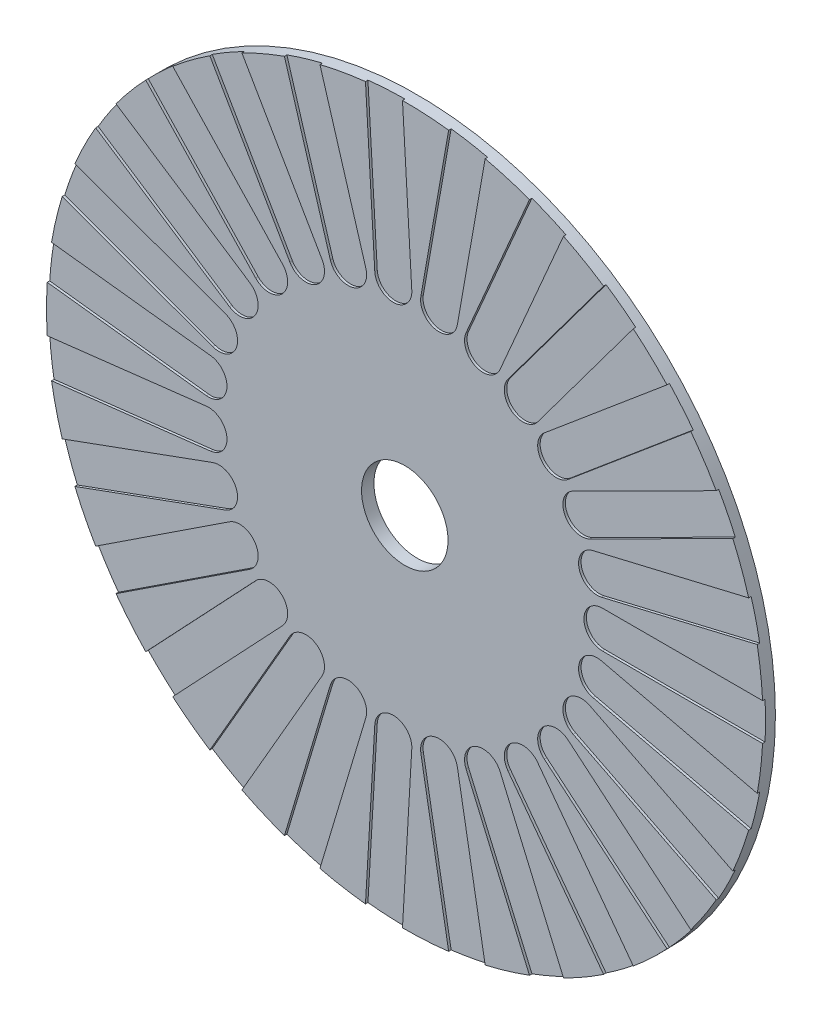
ISO-10303-21;
HEADER;
FILE_DESCRIPTION(('STEP AP214'),'2;1');
FILE_NAME('part.step','',(''),(''),'','','');
FILE_SCHEMA(('AUTOMOTIVE_DESIGN { 1 0 10303 214 1 1 1 1 }'));
ENDSEC;
DATA;
#1=APPLICATION_CONTEXT('core data for automotive mechanical design processes');
#2=APPLICATION_PROTOCOL_DEFINITION('international standard','automotive_design',2000,#1);
#3=PRODUCT_CONTEXT('',#1,'mechanical');
#4=PRODUCT('Part','Part','',(#3));
#5=PRODUCT_RELATED_PRODUCT_CATEGORY('part','',(#4));
#6=PRODUCT_DEFINITION_FORMATION('','',#4);
#7=PRODUCT_DEFINITION_CONTEXT('part definition',#1,'design');
#8=PRODUCT_DEFINITION('design','',#6,#7);
#9=PRODUCT_DEFINITION_SHAPE('','',#8);
#10=(LENGTH_UNIT() NAMED_UNIT(*) SI_UNIT(.MILLI.,.METRE.));
#11=(NAMED_UNIT(*) PLANE_ANGLE_UNIT() SI_UNIT($,.RADIAN.));
#12=(NAMED_UNIT(*) SI_UNIT($,.STERADIAN.) SOLID_ANGLE_UNIT());
#13=UNCERTAINTY_MEASURE_WITH_UNIT(LENGTH_MEASURE(1.E-05),#10,'distance_accuracy_value','');
#14=(GEOMETRIC_REPRESENTATION_CONTEXT(3) GLOBAL_UNCERTAINTY_ASSIGNED_CONTEXT((#13)) GLOBAL_UNIT_ASSIGNED_CONTEXT((#10,
#11,#12)) REPRESENTATION_CONTEXT('',''));
#15=CARTESIAN_POINT('',(0.,0.,0.));
#16=DIRECTION('',(0.,0.,1.));
#17=DIRECTION('',(1.,0.,0.));
#18=AXIS2_PLACEMENT_3D('',#15,#16,#17);
#19=CARTESIAN_POINT('',(0.,0.,1.));
#20=DIRECTION('',(0.,0.,-1.));
#21=DIRECTION('',(-1.,0.,0.));
#22=AXIS2_PLACEMENT_3D('',#19,#20,#21);
#23=CYLINDRICAL_SURFACE('',#22,29.);
#24=CARTESIAN_POINT('',(0.,0.,1.));
#25=DIRECTION('',(0.,0.,1.));
#26=DIRECTION('',(1.,0.,0.));
#27=AXIS2_PLACEMENT_3D('',#24,#25,#26);
#28=CIRCLE('',#27,29.);
#29=CARTESIAN_POINT('',(27.8346047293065,8.13847526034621,1.));
#30=VERTEX_POINT('',#29);
#31=CARTESIAN_POINT('',(26.5538553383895,11.6573052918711,1.));
#32=VERTEX_POINT('',#31);
#33=EDGE_CURVE('E1386',#30,#32,#28,.T.);
#34=ORIENTED_EDGE('',*,*,#33,.F.);
#35=DIRECTION('',(0.,0.,-1.));
#36=VECTOR('',#35,1.);
#37=CARTESIAN_POINT('',(27.8346047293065,8.13847526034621,1.));
#38=LINE('',#37,#36);
#39=CARTESIAN_POINT('',(27.8346047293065,8.13847526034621,0.8));
#40=VERTEX_POINT('',#39);
#41=EDGE_CURVE('E731',#30,#40,#38,.T.);
#42=ORIENTED_EDGE('',*,*,#41,.T.);
#43=CARTESIAN_POINT('',(0.,0.,0.8));
#44=DIRECTION('',(0.,0.,1.));
#45=DIRECTION('',(1.,0.,0.));
#46=AXIS2_PLACEMENT_3D('',#43,#44,#45);
#47=CIRCLE('',#46,29.);
#48=CARTESIAN_POINT('',(28.5264523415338,5.21934064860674,0.8));
#49=VERTEX_POINT('',#48);
#50=EDGE_CURVE('E11',#49,#40,#47,.T.);
#51=ORIENTED_EDGE('',*,*,#50,.F.);
#52=DIRECTION('',(0.,0.,-1.));
#53=VECTOR('',#52,1.);
#54=CARTESIAN_POINT('',(28.5264523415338,5.21934064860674,1.));
#55=LINE('',#54,#53);
#56=CARTESIAN_POINT('',(28.5264523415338,5.21934064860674,1.));
#57=VERTEX_POINT('',#56);
#58=EDGE_CURVE('E712',#49,#57,#55,.F.);
#59=ORIENTED_EDGE('',*,*,#58,.T.);
#60=CARTESIAN_POINT('',(28.9611809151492,1.5,1.));
#61=VERTEX_POINT('',#60);
#62=EDGE_CURVE('E1382',#61,#57,#28,.T.);
#63=ORIENTED_EDGE('',*,*,#62,.F.);
#64=DIRECTION('',(0.,0.,-1.));
#65=VECTOR('',#64,1.);
#66=CARTESIAN_POINT('',(28.9611809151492,1.5,1.));
#67=LINE('',#66,#65);
#68=CARTESIAN_POINT('',(28.9611809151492,1.5,0.8));
#69=VERTEX_POINT('',#68);
#70=EDGE_CURVE('E1378',#61,#69,#67,.T.);
#71=ORIENTED_EDGE('',*,*,#70,.T.);
#72=CARTESIAN_POINT('',(0.,0.,0.8));
#73=DIRECTION('',(0.,0.,1.));
#74=DIRECTION('',(1.,0.,0.));
#75=AXIS2_PLACEMENT_3D('',#72,#73,#74);
#76=CIRCLE('',#75,29.);
#77=CARTESIAN_POINT('',(28.9611809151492,-1.5,0.8));
#78=VERTEX_POINT('',#77);
#79=EDGE_CURVE('E1391',#78,#69,#76,.T.);
#80=ORIENTED_EDGE('',*,*,#79,.F.);
#81=DIRECTION('',(0.,0.,-1.));
#82=VECTOR('',#81,1.);
#83=CARTESIAN_POINT('',(28.9611809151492,-1.5,1.));
#84=LINE('',#83,#82);
#85=CARTESIAN_POINT('',(28.9611809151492,-1.5,1.));
#86=VERTEX_POINT('',#85);
#87=EDGE_CURVE('E1373',#78,#86,#84,.F.);
#88=ORIENTED_EDGE('',*,*,#87,.T.);
#89=CARTESIAN_POINT('',(28.5264523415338,-5.21934064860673,1.));
#90=VERTEX_POINT('',#89);
#91=EDGE_CURVE('E1387',#90,#86,#28,.T.);
#92=ORIENTED_EDGE('',*,*,#91,.F.);
#93=DIRECTION('',(0.,0.,-1.));
#94=VECTOR('',#93,1.);
#95=CARTESIAN_POINT('',(28.5264523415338,-5.21934064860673,1.));
#96=LINE('',#95,#94);
#97=CARTESIAN_POINT('',(28.5264523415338,-5.21934064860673,0.8));
#98=VERTEX_POINT('',#97);
#99=EDGE_CURVE('E1353',#90,#98,#96,.T.);
#100=ORIENTED_EDGE('',*,*,#99,.T.);
#101=CARTESIAN_POINT('',(0.,0.,0.8));
#102=DIRECTION('',(0.,0.,1.));
#103=DIRECTION('',(1.,0.,0.));
#104=AXIS2_PLACEMENT_3D('',#101,#102,#103);
#105=CIRCLE('',#104,29.);
#106=CARTESIAN_POINT('',(27.8346047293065,-8.1384752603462,0.8));
#107=VERTEX_POINT('',#106);
#108=EDGE_CURVE('E1395',#107,#98,#105,.T.);
#109=ORIENTED_EDGE('',*,*,#108,.F.);
#110=DIRECTION('',(0.,0.,-1.));
#111=VECTOR('',#110,1.);
#112=CARTESIAN_POINT('',(27.8346047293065,-8.1384752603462,1.));
#113=LINE('',#112,#111);
#114=CARTESIAN_POINT('',(27.8346047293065,-8.1384752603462,1.));
#115=VERTEX_POINT('',#114);
#116=EDGE_CURVE('E1348',#107,#115,#113,.F.);
#117=ORIENTED_EDGE('',*,*,#116,.T.);
#118=CARTESIAN_POINT('',(26.5538553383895,-11.6573052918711,1.));
#119=VERTEX_POINT('',#118);
#120=EDGE_CURVE('E1593',#119,#115,#28,.T.);
#121=ORIENTED_EDGE('',*,*,#120,.F.);
#122=DIRECTION('',(0.,0.,-1.));
#123=VECTOR('',#122,1.);
#124=CARTESIAN_POINT('',(26.5538553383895,-11.6573052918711,1.));
#125=LINE('',#124,#123);
#126=CARTESIAN_POINT('',(26.5538553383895,-11.6573052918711,0.8));
#127=VERTEX_POINT('',#126);
#128=EDGE_CURVE('E1328',#119,#127,#125,.T.);
#129=ORIENTED_EDGE('',*,*,#128,.T.);
#130=CARTESIAN_POINT('',(0.,0.,0.8));
#131=DIRECTION('',(0.,0.,1.));
#132=DIRECTION('',(1.,0.,0.));
#133=AXIS2_PLACEMENT_3D('',#130,#131,#132);
#134=CIRCLE('',#133,29.);
#135=CARTESIAN_POINT('',(25.2074577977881,-14.3382032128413,0.8));
#136=VERTEX_POINT('',#135);
#137=EDGE_CURVE('E1399',#136,#127,#134,.T.);
#138=ORIENTED_EDGE('',*,*,#137,.F.);
#139=DIRECTION('',(0.,0.,-1.));
#140=VECTOR('',#139,1.);
#141=CARTESIAN_POINT('',(25.2074577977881,-14.3382032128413,1.));
#142=LINE('',#141,#140);
#143=CARTESIAN_POINT('',(25.2074577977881,-14.3382032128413,1.));
#144=VERTEX_POINT('',#143);
#145=EDGE_CURVE('E1323',#136,#144,#142,.F.);
#146=ORIENTED_EDGE('',*,*,#145,.T.);
#147=CARTESIAN_POINT('',(23.1497331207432,-17.4668215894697,1.));
#148=VERTEX_POINT('',#147);
#149=EDGE_CURVE('E1589',#148,#144,#28,.T.);
#150=ORIENTED_EDGE('',*,*,#149,.F.);
#151=DIRECTION('',(0.,0.,-1.));
#152=VECTOR('',#151,1.);
#153=CARTESIAN_POINT('',(23.1497331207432,-17.4668215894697,1.));
#154=LINE('',#153,#152);
#155=CARTESIAN_POINT('',(23.1497331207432,-17.4668215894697,0.8));
#156=VERTEX_POINT('',#155);
#157=EDGE_CURVE('E1303',#148,#156,#154,.T.);
#158=ORIENTED_EDGE('',*,*,#157,.T.);
#159=CARTESIAN_POINT('',(0.,0.,0.8));
#160=DIRECTION('',(0.,0.,1.));
#161=DIRECTION('',(1.,0.,0.));
#162=AXIS2_PLACEMENT_3D('',#159,#160,#161);
#163=CIRCLE('',#162,29.);
#164=CARTESIAN_POINT('',(21.2213702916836,-19.7649549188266,0.8));
#165=VERTEX_POINT('',#164);
#166=EDGE_CURVE('E1403',#165,#156,#163,.T.);
#167=ORIENTED_EDGE('',*,*,#166,.F.);
#168=DIRECTION('',(0.,0.,-1.));
#169=VECTOR('',#168,1.);
#170=CARTESIAN_POINT('',(21.2213702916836,-19.7649549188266,1.));
#171=LINE('',#170,#169);
#172=CARTESIAN_POINT('',(21.2213702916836,-19.7649549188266,1.));
#173=VERTEX_POINT('',#172);
#174=EDGE_CURVE('E1298',#165,#173,#171,.F.);
#175=ORIENTED_EDGE('',*,*,#174,.T.);
#176=CARTESIAN_POINT('',(18.4976027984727,-22.3346970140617,1.));
#177=VERTEX_POINT('',#176);
#178=EDGE_CURVE('E1585',#177,#173,#28,.T.);
#179=ORIENTED_EDGE('',*,*,#178,.F.);
#180=DIRECTION('',(0.,0.,-1.));
#181=VECTOR('',#180,1.);
#182=CARTESIAN_POINT('',(18.4976027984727,-22.3346970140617,1.));
#183=LINE('',#182,#181);
#184=CARTESIAN_POINT('',(18.4976027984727,-22.3346970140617,0.8));
#185=VERTEX_POINT('',#184);
#186=EDGE_CURVE('E1278',#177,#185,#183,.T.);
#187=ORIENTED_EDGE('',*,*,#186,.T.);
#188=CARTESIAN_POINT('',(0.,0.,0.8));
#189=DIRECTION('',(0.,0.,1.));
#190=DIRECTION('',(1.,0.,0.));
#191=AXIS2_PLACEMENT_3D('',#188,#189,#190);
#192=CIRCLE('',#191,29.);
#193=CARTESIAN_POINT('',(16.0912332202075,-24.1261727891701,0.8));
#194=VERTEX_POINT('',#193);
#195=EDGE_CURVE('E1407',#194,#185,#192,.T.);
#196=ORIENTED_EDGE('',*,*,#195,.F.);
#197=DIRECTION('',(0.,0.,-1.));
#198=VECTOR('',#197,1.);
#199=CARTESIAN_POINT('',(16.0912332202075,-24.1261727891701,1.));
#200=LINE('',#199,#198);
#201=CARTESIAN_POINT('',(16.0912332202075,-24.1261727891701,1.));
#202=VERTEX_POINT('',#201);
#203=EDGE_CURVE('E1273',#194,#202,#200,.F.);
#204=ORIENTED_EDGE('',*,*,#203,.T.);
#205=CARTESIAN_POINT('',(12.8482619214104,-25.9985031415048,1.));
#206=VERTEX_POINT('',#205);
#207=EDGE_CURVE('E1581',#206,#202,#28,.T.);
#208=ORIENTED_EDGE('',*,*,#207,.F.);
#209=DIRECTION('',(0.,0.,-1.));
#210=VECTOR('',#209,1.);
#211=CARTESIAN_POINT('',(12.8482619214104,-25.9985031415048,1.));
#212=LINE('',#211,#210);
#213=CARTESIAN_POINT('',(12.8482619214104,-25.9985031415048,0.8));
#214=VERTEX_POINT('',#213);
#215=EDGE_CURVE('E1253',#206,#214,#212,.T.);
#216=ORIENTED_EDGE('',*,*,#215,.T.);
#217=CARTESIAN_POINT('',(0.,0.,0.8));
#218=DIRECTION('',(0.,0.,1.));
#219=DIRECTION('',(1.,0.,0.));
#220=AXIS2_PLACEMENT_3D('',#217,#218,#219);
#221=CIRCLE('',#220,29.);
#222=CARTESIAN_POINT('',(10.0936136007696,-27.1867424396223,0.8));
#223=VERTEX_POINT('',#222);
#224=EDGE_CURVE('E1411',#223,#214,#221,.T.);
#225=ORIENTED_EDGE('',*,*,#224,.F.);
#226=DIRECTION('',(0.,0.,-1.));
#227=VECTOR('',#226,1.);
#228=CARTESIAN_POINT('',(10.0936136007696,-27.1867424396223,1.));
#229=LINE('',#228,#227);
#230=CARTESIAN_POINT('',(10.0936136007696,-27.1867424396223,1.));
#231=VERTEX_POINT('',#230);
#232=EDGE_CURVE('E1248',#223,#231,#229,.F.);
#233=ORIENTED_EDGE('',*,*,#232,.T.);
#234=CARTESIAN_POINT('',(6.50626791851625,-28.2607232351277,1.));
#235=VERTEX_POINT('',#234);
#236=EDGE_CURVE('E1577',#235,#231,#28,.T.);
#237=ORIENTED_EDGE('',*,*,#236,.F.);
#238=DIRECTION('',(0.,0.,-1.));
#239=VECTOR('',#238,1.);
#240=CARTESIAN_POINT('',(6.50626791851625,-28.2607232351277,1.));
#241=LINE('',#240,#239);
#242=CARTESIAN_POINT('',(6.50626791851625,-28.2607232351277,0.8));
#243=VERTEX_POINT('',#242);
#244=EDGE_CURVE('E1228',#235,#243,#241,.T.);
#245=ORIENTED_EDGE('',*,*,#244,.T.);
#246=CARTESIAN_POINT('',(0.,0.,0.8));
#247=DIRECTION('',(0.,0.,1.));
#248=DIRECTION('',(1.,0.,0.));
#249=AXIS2_PLACEMENT_3D('',#246,#247,#248);
#250=CIRCLE('',#249,29.);
#251=CARTESIAN_POINT('',(3.55184465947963,-28.7816677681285,0.8));
#252=VERTEX_POINT('',#251);
#253=EDGE_CURVE('E1415',#252,#243,#250,.T.);
#254=ORIENTED_EDGE('',*,*,#253,.F.);
#255=DIRECTION('',(0.,0.,-1.));
#256=VECTOR('',#255,1.);
#257=CARTESIAN_POINT('',(3.55184465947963,-28.7816677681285,1.));
#258=LINE('',#257,#256);
#259=CARTESIAN_POINT('',(3.55184465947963,-28.7816677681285,1.));
#260=VERTEX_POINT('',#259);
#261=EDGE_CURVE('E1223',#252,#260,#258,.F.);
#262=ORIENTED_EDGE('',*,*,#261,.T.);
#263=CARTESIAN_POINT('',(-0.186480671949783,-28.9994004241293,1.));
#264=VERTEX_POINT('',#263);
#265=EDGE_CURVE('E1573',#264,#260,#28,.T.);
#266=ORIENTED_EDGE('',*,*,#265,.F.);
#267=DIRECTION('',(0.,0.,-1.));
#268=VECTOR('',#267,1.);
#269=CARTESIAN_POINT('',(-0.186480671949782,-28.9994004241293,1.));
#270=LINE('',#269,#268);
#271=CARTESIAN_POINT('',(-0.186480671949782,-28.9994004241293,0.8));
#272=VERTEX_POINT('',#271);
#273=EDGE_CURVE('E1203',#264,#272,#270,.T.);
#274=ORIENTED_EDGE('',*,*,#273,.T.);
#275=CARTESIAN_POINT('',(0.,0.,0.8));
#276=DIRECTION('',(0.,0.,1.));
#277=DIRECTION('',(1.,0.,0.));
#278=AXIS2_PLACEMENT_3D('',#275,#276,#277);
#279=CIRCLE('',#278,29.);
#280=CARTESIAN_POINT('',(-3.18140514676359,-28.8249659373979,0.8));
#281=VERTEX_POINT('',#280);
#282=EDGE_CURVE('E1419',#281,#272,#279,.T.);
#283=ORIENTED_EDGE('',*,*,#282,.F.);
#284=DIRECTION('',(0.,0.,-1.));
#285=VECTOR('',#284,1.);
#286=CARTESIAN_POINT('',(-3.18140514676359,-28.8249659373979,1.));
#287=LINE('',#286,#285);
#288=CARTESIAN_POINT('',(-3.18140514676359,-28.8249659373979,1.));
#289=VERTEX_POINT('',#288);
#290=EDGE_CURVE('E1198',#281,#289,#287,.F.);
#291=ORIENTED_EDGE('',*,*,#290,.T.);
#292=CARTESIAN_POINT('',(-6.86917604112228,-28.174712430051,1.));
#293=VERTEX_POINT('',#292);
#294=EDGE_CURVE('E1569',#293,#289,#28,.T.);
#295=ORIENTED_EDGE('',*,*,#294,.F.);
#296=DIRECTION('',(0.,0.,-1.));
#297=VECTOR('',#296,1.);
#298=CARTESIAN_POINT('',(-6.86917604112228,-28.174712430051,1.));
#299=LINE('',#298,#297);
#300=CARTESIAN_POINT('',(-6.86917604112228,-28.174712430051,0.8));
#301=VERTEX_POINT('',#300);
#302=EDGE_CURVE('E1178',#293,#301,#299,.T.);
#303=ORIENTED_EDGE('',*,*,#302,.T.);
#304=CARTESIAN_POINT('',(0.,0.,0.8));
#305=DIRECTION('',(0.,0.,1.));
#306=DIRECTION('',(1.,0.,0.));
#307=AXIS2_PLACEMENT_3D('',#304,#305,#306);
#308=CIRCLE('',#307,29.);
#309=CARTESIAN_POINT('',(-9.74314457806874,-27.3143027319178,0.8));
#310=VERTEX_POINT('',#309);
#311=EDGE_CURVE('E1423',#310,#301,#308,.T.);
#312=ORIENTED_EDGE('',*,*,#311,.F.);
#313=DIRECTION('',(0.,0.,-1.));
#314=VECTOR('',#313,1.);
#315=CARTESIAN_POINT('',(-9.74314457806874,-27.3143027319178,1.));
#316=LINE('',#315,#314);
#317=CARTESIAN_POINT('',(-9.74314457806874,-27.3143027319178,1.));
#318=VERTEX_POINT('',#317);
#319=EDGE_CURVE('E1173',#310,#318,#316,.F.);
#320=ORIENTED_EDGE('',*,*,#319,.T.);
#321=CARTESIAN_POINT('',(-13.1815523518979,-25.8311183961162,1.));
#322=VERTEX_POINT('',#321);
#323=EDGE_CURVE('E1565',#322,#318,#28,.T.);
#324=ORIENTED_EDGE('',*,*,#323,.F.);
#325=DIRECTION('',(0.,0.,-1.));
#326=VECTOR('',#325,1.);
#327=CARTESIAN_POINT('',(-13.1815523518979,-25.8311183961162,1.));
#328=LINE('',#327,#326);
#329=CARTESIAN_POINT('',(-13.1815523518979,-25.8311183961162,0.8));
#330=VERTEX_POINT('',#329);
#331=EDGE_CURVE('E1153',#322,#330,#328,.T.);
#332=ORIENTED_EDGE('',*,*,#331,.T.);
#333=CARTESIAN_POINT('',(0.,0.,0.8));
#334=DIRECTION('',(0.,0.,1.));
#335=DIRECTION('',(1.,0.,0.));
#336=AXIS2_PLACEMENT_3D('',#333,#334,#335);
#337=CIRCLE('',#336,29.);
#338=CARTESIAN_POINT('',(-15.7796285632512,-24.3311183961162,0.8));
#339=VERTEX_POINT('',#338);
#340=EDGE_CURVE('E1427',#339,#330,#337,.T.);
#341=ORIENTED_EDGE('',*,*,#340,.F.);
#342=DIRECTION('',(0.,0.,-1.));
#343=VECTOR('',#342,1.);
#344=CARTESIAN_POINT('',(-15.7796285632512,-24.3311183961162,1.));
#345=LINE('',#344,#343);
#346=CARTESIAN_POINT('',(-15.7796285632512,-24.3311183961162,1.));
#347=VERTEX_POINT('',#346);
#348=EDGE_CURVE('E1148',#339,#347,#345,.F.);
#349=ORIENTED_EDGE('',*,*,#348,.T.);
#350=CARTESIAN_POINT('',(-18.7833077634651,-22.094962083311,1.));
#351=VERTEX_POINT('',#350);
#352=EDGE_CURVE('E1561',#351,#347,#28,.T.);
#353=ORIENTED_EDGE('',*,*,#352,.F.);
#354=DIRECTION('',(0.,0.,-1.));
#355=VECTOR('',#354,1.);
#356=CARTESIAN_POINT('',(-18.7833077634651,-22.094962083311,1.));
#357=LINE('',#356,#355);
#358=CARTESIAN_POINT('',(-18.7833077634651,-22.094962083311,0.8));
#359=VERTEX_POINT('',#358);
#360=EDGE_CURVE('E1128',#351,#359,#357,.T.);
#361=ORIENTED_EDGE('',*,*,#360,.T.);
#362=CARTESIAN_POINT('',(0.,0.,0.8));
#363=DIRECTION('',(0.,0.,1.));
#364=DIRECTION('',(1.,0.,0.));
#365=AXIS2_PLACEMENT_3D('',#362,#363,#364);
#366=CIRCLE('',#365,29.);
#367=CARTESIAN_POINT('',(-20.9654286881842,-20.0362371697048,0.8));
#368=VERTEX_POINT('',#367);
#369=EDGE_CURVE('E1431',#368,#359,#366,.T.);
#370=ORIENTED_EDGE('',*,*,#369,.F.);
#371=DIRECTION('',(0.,0.,-1.));
#372=VECTOR('',#371,1.);
#373=CARTESIAN_POINT('',(-20.9654286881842,-20.0362371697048,1.));
#374=LINE('',#373,#372);
#375=CARTESIAN_POINT('',(-20.9654286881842,-20.0362371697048,1.));
#376=VERTEX_POINT('',#375);
#377=EDGE_CURVE('E1123',#368,#376,#374,.F.);
#378=ORIENTED_EDGE('',*,*,#377,.T.);
#379=CARTESIAN_POINT('',(-23.3724501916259,-17.1676606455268,1.));
#380=VERTEX_POINT('',#379);
#381=EDGE_CURVE('E1557',#380,#376,#28,.T.);
#382=ORIENTED_EDGE('',*,*,#381,.F.);
#383=DIRECTION('',(0.,0.,-1.));
#384=VECTOR('',#383,1.);
#385=CARTESIAN_POINT('',(-23.3724501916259,-17.1676606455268,1.));
#386=LINE('',#385,#384);
#387=CARTESIAN_POINT('',(-23.3724501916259,-17.1676606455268,0.8));
#388=VERTEX_POINT('',#387);
#389=EDGE_CURVE('E1103',#380,#388,#386,.T.);
#390=ORIENTED_EDGE('',*,*,#389,.T.);
#391=CARTESIAN_POINT('',(0.,0.,0.8));
#392=DIRECTION('',(0.,0.,1.));
#393=DIRECTION('',(1.,0.,0.));
#394=AXIS2_PLACEMENT_3D('',#391,#392,#393);
#395=CIRCLE('',#394,29.);
#396=CARTESIAN_POINT('',(-25.0209771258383,-14.661197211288,0.8));
#397=VERTEX_POINT('',#396);
#398=EDGE_CURVE('E1435',#397,#388,#395,.T.);
#399=ORIENTED_EDGE('',*,*,#398,.F.);
#400=DIRECTION('',(0.,0.,-1.));
#401=VECTOR('',#400,1.);
#402=CARTESIAN_POINT('',(-25.0209771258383,-14.661197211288,1.));
#403=LINE('',#402,#401);
#404=CARTESIAN_POINT('',(-25.0209771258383,-14.661197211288,1.));
#405=VERTEX_POINT('',#404);
#406=EDGE_CURVE('E1098',#397,#405,#403,.F.);
#407=ORIENTED_EDGE('',*,*,#406,.T.);
#408=CARTESIAN_POINT('',(-26.7015777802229,-11.3148461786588,1.));
#409=VERTEX_POINT('',#408);
#410=EDGE_CURVE('E1553',#409,#405,#28,.T.);
#411=ORIENTED_EDGE('',*,*,#410,.F.);
#412=DIRECTION('',(0.,0.,-1.));
#413=VECTOR('',#412,1.);
#414=CARTESIAN_POINT('',(-26.7015777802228,-11.3148461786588,1.));
#415=LINE('',#414,#413);
#416=CARTESIAN_POINT('',(-26.7015777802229,-11.3148461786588,0.8));
#417=VERTEX_POINT('',#416);
#418=EDGE_CURVE('E1078',#409,#417,#415,.T.);
#419=ORIENTED_EDGE('',*,*,#418,.T.);
#420=CARTESIAN_POINT('',(0.,0.,0.8));
#421=DIRECTION('',(0.,0.,1.));
#422=DIRECTION('',(1.,0.,0.));
#423=AXIS2_PLACEMENT_3D('',#420,#421,#422);
#424=CIRCLE('',#423,29.);
#425=CARTESIAN_POINT('',(-27.7276382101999,-8.49576831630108,0.8));
#426=VERTEX_POINT('',#425);
#427=EDGE_CURVE('E1439',#426,#417,#424,.T.);
#428=ORIENTED_EDGE('',*,*,#427,.F.);
#429=DIRECTION('',(0.,0.,-1.));
#430=VECTOR('',#429,1.);
#431=CARTESIAN_POINT('',(-27.7276382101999,-8.49576831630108,1.));
#432=LINE('',#431,#430);
#433=CARTESIAN_POINT('',(-27.7276382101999,-8.49576831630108,1.));
#434=VERTEX_POINT('',#433);
#435=EDGE_CURVE('E1073',#426,#434,#432,.F.);
#436=ORIENTED_EDGE('',*,*,#435,.T.);
#437=CARTESIAN_POINT('',(-28.5912163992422,-4.85204542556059,1.));
#438=VERTEX_POINT('',#437);
#439=EDGE_CURVE('E1549',#438,#434,#28,.T.);
#440=ORIENTED_EDGE('',*,*,#439,.F.);
#441=DIRECTION('',(0.,0.,-1.));
#442=VECTOR('',#441,1.);
#443=CARTESIAN_POINT('',(-28.5912163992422,-4.85204542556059,1.));
#444=LINE('',#443,#442);
#445=CARTESIAN_POINT('',(-28.5912163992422,-4.85204542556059,0.8));
#446=VERTEX_POINT('',#445);
#447=EDGE_CURVE('E1053',#438,#446,#444,.T.);
#448=ORIENTED_EDGE('',*,*,#447,.T.);
#449=CARTESIAN_POINT('',(0.,0.,0.8));
#450=DIRECTION('',(0.,0.,1.));
#451=DIRECTION('',(1.,0.,0.));
#452=AXIS2_PLACEMENT_3D('',#449,#450,#451);
#453=CIRCLE('',#452,29.);
#454=CARTESIAN_POINT('',(-28.9394951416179,-1.87233035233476,0.8));
#455=VERTEX_POINT('',#454);
#456=EDGE_CURVE('E1443',#455,#446,#453,.T.);
#457=ORIENTED_EDGE('',*,*,#456,.F.);
#458=DIRECTION('',(0.,0.,-1.));
#459=VECTOR('',#458,1.);
#460=CARTESIAN_POINT('',(-28.9394951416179,-1.87233035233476,1.));
#461=LINE('',#460,#459);
#462=CARTESIAN_POINT('',(-28.9394951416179,-1.87233035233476,1.));
#463=VERTEX_POINT('',#462);
#464=EDGE_CURVE('E1048',#455,#463,#461,.F.);
#465=ORIENTED_EDGE('',*,*,#464,.T.);
#466=CARTESIAN_POINT('',(-28.9394951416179,1.87233035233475,1.));
#467=VERTEX_POINT('',#466);
#468=EDGE_CURVE('E1545',#467,#463,#28,.T.);
#469=ORIENTED_EDGE('',*,*,#468,.F.);
#470=DIRECTION('',(0.,0.,-1.));
#471=VECTOR('',#470,1.);
#472=CARTESIAN_POINT('',(-28.9394951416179,1.87233035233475,1.));
#473=LINE('',#472,#471);
#474=CARTESIAN_POINT('',(-28.9394951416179,1.87233035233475,0.8));
#475=VERTEX_POINT('',#474);
#476=EDGE_CURVE('E1028',#467,#475,#473,.T.);
#477=ORIENTED_EDGE('',*,*,#476,.T.);
#478=CARTESIAN_POINT('',(0.,0.,0.8));
#479=DIRECTION('',(0.,0.,1.));
#480=DIRECTION('',(1.,0.,0.));
#481=AXIS2_PLACEMENT_3D('',#478,#479,#480);
#482=CIRCLE('',#481,29.);
#483=CARTESIAN_POINT('',(-28.5912163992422,4.85204542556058,0.8));
#484=VERTEX_POINT('',#483);
#485=EDGE_CURVE('E1447',#484,#475,#482,.T.);
#486=ORIENTED_EDGE('',*,*,#485,.F.);
#487=DIRECTION('',(0.,0.,-1.));
#488=VECTOR('',#487,1.);
#489=CARTESIAN_POINT('',(-28.5912163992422,4.85204542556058,1.));
#490=LINE('',#489,#488);
#491=CARTESIAN_POINT('',(-28.5912163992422,4.85204542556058,1.));
#492=VERTEX_POINT('',#491);
#493=EDGE_CURVE('E1023',#484,#492,#490,.F.);
#494=ORIENTED_EDGE('',*,*,#493,.T.);
#495=CARTESIAN_POINT('',(-27.7276382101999,8.49576831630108,1.));
#496=VERTEX_POINT('',#495);
#497=EDGE_CURVE('E1541',#496,#492,#28,.T.);
#498=ORIENTED_EDGE('',*,*,#497,.F.);
#499=DIRECTION('',(0.,0.,-1.));
#500=VECTOR('',#499,1.);
#501=CARTESIAN_POINT('',(-27.7276382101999,8.49576831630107,1.));
#502=LINE('',#501,#500);
#503=CARTESIAN_POINT('',(-27.7276382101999,8.49576831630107,0.8));
#504=VERTEX_POINT('',#503);
#505=EDGE_CURVE('E1003',#496,#504,#502,.T.);
#506=ORIENTED_EDGE('',*,*,#505,.T.);
#507=CARTESIAN_POINT('',(0.,0.,0.8));
#508=DIRECTION('',(0.,0.,1.));
#509=DIRECTION('',(1.,0.,0.));
#510=AXIS2_PLACEMENT_3D('',#507,#508,#509);
#511=CIRCLE('',#510,29.);
#512=CARTESIAN_POINT('',(-26.7015777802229,11.3148461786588,0.8));
#513=VERTEX_POINT('',#512);
#514=EDGE_CURVE('E1451',#513,#504,#511,.T.);
#515=ORIENTED_EDGE('',*,*,#514,.F.);
#516=DIRECTION('',(0.,0.,-1.));
#517=VECTOR('',#516,1.);
#518=CARTESIAN_POINT('',(-26.7015777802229,11.3148461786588,1.));
#519=LINE('',#518,#517);
#520=CARTESIAN_POINT('',(-26.7015777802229,11.3148461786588,1.));
#521=VERTEX_POINT('',#520);
#522=EDGE_CURVE('E998',#513,#521,#519,.F.);
#523=ORIENTED_EDGE('',*,*,#522,.T.);
#524=CARTESIAN_POINT('',(-25.0209771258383,14.6611972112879,1.));
#525=VERTEX_POINT('',#524);
#526=EDGE_CURVE('E1537',#525,#521,#28,.T.);
#527=ORIENTED_EDGE('',*,*,#526,.F.);
#528=DIRECTION('',(0.,0.,-1.));
#529=VECTOR('',#528,1.);
#530=CARTESIAN_POINT('',(-25.0209771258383,14.6611972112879,1.));
#531=LINE('',#530,#529);
#532=CARTESIAN_POINT('',(-25.0209771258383,14.6611972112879,0.8));
#533=VERTEX_POINT('',#532);
#534=EDGE_CURVE('E978',#525,#533,#531,.T.);
#535=ORIENTED_EDGE('',*,*,#534,.T.);
#536=CARTESIAN_POINT('',(0.,0.,0.8));
#537=DIRECTION('',(0.,0.,1.));
#538=DIRECTION('',(1.,0.,0.));
#539=AXIS2_PLACEMENT_3D('',#536,#537,#538);
#540=CIRCLE('',#539,29.);
#541=CARTESIAN_POINT('',(-23.3724501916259,17.1676606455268,0.8));
#542=VERTEX_POINT('',#541);
#543=EDGE_CURVE('E1455',#542,#533,#540,.T.);
#544=ORIENTED_EDGE('',*,*,#543,.F.);
#545=DIRECTION('',(0.,0.,-1.));
#546=VECTOR('',#545,1.);
#547=CARTESIAN_POINT('',(-23.3724501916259,17.1676606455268,1.));
#548=LINE('',#547,#546);
#549=CARTESIAN_POINT('',(-23.3724501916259,17.1676606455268,1.));
#550=VERTEX_POINT('',#549);
#551=EDGE_CURVE('E973',#542,#550,#548,.F.);
#552=ORIENTED_EDGE('',*,*,#551,.T.);
#553=CARTESIAN_POINT('',(-20.9654286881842,20.0362371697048,1.));
#554=VERTEX_POINT('',#553);
#555=EDGE_CURVE('E1533',#554,#550,#28,.T.);
#556=ORIENTED_EDGE('',*,*,#555,.F.);
#557=DIRECTION('',(0.,0.,-1.));
#558=VECTOR('',#557,1.);
#559=CARTESIAN_POINT('',(-20.9654286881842,20.0362371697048,1.));
#560=LINE('',#559,#558);
#561=CARTESIAN_POINT('',(-20.9654286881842,20.0362371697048,0.8));
#562=VERTEX_POINT('',#561);
#563=EDGE_CURVE('E953',#554,#562,#560,.T.);
#564=ORIENTED_EDGE('',*,*,#563,.T.);
#565=CARTESIAN_POINT('',(0.,0.,0.8));
#566=DIRECTION('',(0.,0.,1.));
#567=DIRECTION('',(1.,0.,0.));
#568=AXIS2_PLACEMENT_3D('',#565,#566,#567);
#569=CIRCLE('',#568,29.);
#570=CARTESIAN_POINT('',(-18.7833077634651,22.094962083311,0.8));
#571=VERTEX_POINT('',#570);
#572=EDGE_CURVE('E1459',#571,#562,#569,.T.);
#573=ORIENTED_EDGE('',*,*,#572,.F.);
#574=DIRECTION('',(0.,0.,-1.));
#575=VECTOR('',#574,1.);
#576=CARTESIAN_POINT('',(-18.7833077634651,22.094962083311,1.));
#577=LINE('',#576,#575);
#578=CARTESIAN_POINT('',(-18.7833077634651,22.094962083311,1.));
#579=VERTEX_POINT('',#578);
#580=EDGE_CURVE('E948',#571,#579,#577,.F.);
#581=ORIENTED_EDGE('',*,*,#580,.T.);
#582=CARTESIAN_POINT('',(-15.7796285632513,24.3311183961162,1.));
#583=VERTEX_POINT('',#582);
#584=EDGE_CURVE('E1529',#583,#579,#28,.T.);
#585=ORIENTED_EDGE('',*,*,#584,.F.);
#586=DIRECTION('',(0.,0.,-1.));
#587=VECTOR('',#586,1.);
#588=CARTESIAN_POINT('',(-15.7796285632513,24.3311183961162,1.));
#589=LINE('',#588,#587);
#590=CARTESIAN_POINT('',(-15.7796285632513,24.3311183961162,0.8));
#591=VERTEX_POINT('',#590);
#592=EDGE_CURVE('E928',#583,#591,#589,.T.);
#593=ORIENTED_EDGE('',*,*,#592,.T.);
#594=CARTESIAN_POINT('',(0.,0.,0.8));
#595=DIRECTION('',(0.,0.,1.));
#596=DIRECTION('',(1.,0.,0.));
#597=AXIS2_PLACEMENT_3D('',#594,#595,#596);
#598=CIRCLE('',#597,29.);
#599=CARTESIAN_POINT('',(-13.1815523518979,25.8311183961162,0.8));
#600=VERTEX_POINT('',#599);
#601=EDGE_CURVE('E1463',#600,#591,#598,.T.);
#602=ORIENTED_EDGE('',*,*,#601,.F.);
#603=DIRECTION('',(0.,0.,-1.));
#604=VECTOR('',#603,1.);
#605=CARTESIAN_POINT('',(-13.1815523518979,25.8311183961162,1.));
#606=LINE('',#605,#604);
#607=CARTESIAN_POINT('',(-13.1815523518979,25.8311183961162,1.));
#608=VERTEX_POINT('',#607);
#609=EDGE_CURVE('E923',#600,#608,#606,.F.);
#610=ORIENTED_EDGE('',*,*,#609,.T.);
#611=CARTESIAN_POINT('',(-9.74314457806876,27.3143027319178,1.));
#612=VERTEX_POINT('',#611);
#613=EDGE_CURVE('E1525',#612,#608,#28,.T.);
#614=ORIENTED_EDGE('',*,*,#613,.F.);
#615=DIRECTION('',(0.,0.,-1.));
#616=VECTOR('',#615,1.);
#617=CARTESIAN_POINT('',(-9.74314457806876,27.3143027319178,1.));
#618=LINE('',#617,#616);
#619=CARTESIAN_POINT('',(-9.74314457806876,27.3143027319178,0.8));
#620=VERTEX_POINT('',#619);
#621=EDGE_CURVE('E903',#612,#620,#618,.T.);
#622=ORIENTED_EDGE('',*,*,#621,.T.);
#623=CARTESIAN_POINT('',(0.,0.,0.8));
#624=DIRECTION('',(0.,0.,1.));
#625=DIRECTION('',(1.,0.,0.));
#626=AXIS2_PLACEMENT_3D('',#623,#624,#625);
#627=CIRCLE('',#626,29.);
#628=CARTESIAN_POINT('',(-6.86917604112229,28.174712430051,0.8));
#629=VERTEX_POINT('',#628);
#630=EDGE_CURVE('E1467',#629,#620,#627,.T.);
#631=ORIENTED_EDGE('',*,*,#630,.F.);
#632=DIRECTION('',(0.,0.,-1.));
#633=VECTOR('',#632,1.);
#634=CARTESIAN_POINT('',(-6.86917604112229,28.174712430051,1.));
#635=LINE('',#634,#633);
#636=CARTESIAN_POINT('',(-6.86917604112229,28.174712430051,1.));
#637=VERTEX_POINT('',#636);
#638=EDGE_CURVE('E898',#629,#637,#635,.F.);
#639=ORIENTED_EDGE('',*,*,#638,.T.);
#640=CARTESIAN_POINT('',(-3.1814051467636,28.8249659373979,1.));
#641=VERTEX_POINT('',#640);
#642=EDGE_CURVE('E1521',#641,#637,#28,.T.);
#643=ORIENTED_EDGE('',*,*,#642,.F.);
#644=DIRECTION('',(0.,0.,-1.));
#645=VECTOR('',#644,1.);
#646=CARTESIAN_POINT('',(-3.1814051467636,28.8249659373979,1.));
#647=LINE('',#646,#645);
#648=CARTESIAN_POINT('',(-3.1814051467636,28.8249659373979,0.8));
#649=VERTEX_POINT('',#648);
#650=EDGE_CURVE('E878',#641,#649,#647,.T.);
#651=ORIENTED_EDGE('',*,*,#650,.T.);
#652=CARTESIAN_POINT('',(0.,0.,0.8));
#653=DIRECTION('',(0.,0.,1.));
#654=DIRECTION('',(1.,0.,0.));
#655=AXIS2_PLACEMENT_3D('',#652,#653,#654);
#656=CIRCLE('',#655,29.);
#657=CARTESIAN_POINT('',(-0.186480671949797,28.9994004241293,0.8));
#658=VERTEX_POINT('',#657);
#659=EDGE_CURVE('E1471',#658,#649,#656,.T.);
#660=ORIENTED_EDGE('',*,*,#659,.F.);
#661=DIRECTION('',(0.,0.,-1.));
#662=VECTOR('',#661,1.);
#663=CARTESIAN_POINT('',(-0.186480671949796,28.9994004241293,1.));
#664=LINE('',#663,#662);
#665=CARTESIAN_POINT('',(-0.186480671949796,28.9994004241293,1.));
#666=VERTEX_POINT('',#665);
#667=EDGE_CURVE('E873',#658,#666,#664,.F.);
#668=ORIENTED_EDGE('',*,*,#667,.T.);
#669=CARTESIAN_POINT('',(3.55184465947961,28.7816677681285,1.));
#670=VERTEX_POINT('',#669);
#671=EDGE_CURVE('E1517',#670,#666,#28,.T.);
#672=ORIENTED_EDGE('',*,*,#671,.F.);
#673=DIRECTION('',(0.,0.,-1.));
#674=VECTOR('',#673,1.);
#675=CARTESIAN_POINT('',(3.55184465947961,28.7816677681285,1.));
#676=LINE('',#675,#674);
#677=CARTESIAN_POINT('',(3.55184465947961,28.7816677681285,0.8));
#678=VERTEX_POINT('',#677);
#679=EDGE_CURVE('E853',#670,#678,#676,.T.);
#680=ORIENTED_EDGE('',*,*,#679,.T.);
#681=CARTESIAN_POINT('',(0.,0.,0.8));
#682=DIRECTION('',(0.,0.,1.));
#683=DIRECTION('',(1.,0.,0.));
#684=AXIS2_PLACEMENT_3D('',#681,#682,#683);
#685=CIRCLE('',#684,29.);
#686=CARTESIAN_POINT('',(6.50626791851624,28.2607232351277,0.8));
#687=VERTEX_POINT('',#686);
#688=EDGE_CURVE('E1475',#687,#678,#685,.T.);
#689=ORIENTED_EDGE('',*,*,#688,.F.);
#690=DIRECTION('',(0.,0.,-1.));
#691=VECTOR('',#690,1.);
#692=CARTESIAN_POINT('',(6.50626791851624,28.2607232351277,1.));
#693=LINE('',#692,#691);
#694=CARTESIAN_POINT('',(6.50626791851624,28.2607232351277,1.));
#695=VERTEX_POINT('',#694);
#696=EDGE_CURVE('E848',#687,#695,#693,.F.);
#697=ORIENTED_EDGE('',*,*,#696,.T.);
#698=CARTESIAN_POINT('',(10.0936136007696,27.1867424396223,1.));
#699=VERTEX_POINT('',#698);
#700=EDGE_CURVE('E1513',#699,#695,#28,.T.);
#701=ORIENTED_EDGE('',*,*,#700,.F.);
#702=DIRECTION('',(0.,0.,-1.));
#703=VECTOR('',#702,1.);
#704=CARTESIAN_POINT('',(10.0936136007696,27.1867424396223,1.));
#705=LINE('',#704,#703);
#706=CARTESIAN_POINT('',(10.0936136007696,27.1867424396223,0.8));
#707=VERTEX_POINT('',#706);
#708=EDGE_CURVE('E828',#699,#707,#705,.T.);
#709=ORIENTED_EDGE('',*,*,#708,.T.);
#710=CARTESIAN_POINT('',(0.,0.,0.8));
#711=DIRECTION('',(0.,0.,1.));
#712=DIRECTION('',(1.,0.,0.));
#713=AXIS2_PLACEMENT_3D('',#710,#711,#712);
#714=CIRCLE('',#713,29.);
#715=CARTESIAN_POINT('',(12.8482619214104,25.9985031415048,0.8));
#716=VERTEX_POINT('',#715);
#717=EDGE_CURVE('E1479',#716,#707,#714,.T.);
#718=ORIENTED_EDGE('',*,*,#717,.F.);
#719=DIRECTION('',(0.,0.,-1.));
#720=VECTOR('',#719,1.);
#721=CARTESIAN_POINT('',(12.8482619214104,25.9985031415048,1.));
#722=LINE('',#721,#720);
#723=CARTESIAN_POINT('',(12.8482619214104,25.9985031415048,1.));
#724=VERTEX_POINT('',#723);
#725=EDGE_CURVE('E823',#716,#724,#722,.F.);
#726=ORIENTED_EDGE('',*,*,#725,.T.);
#727=CARTESIAN_POINT('',(16.0912332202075,24.1261727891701,1.));
#728=VERTEX_POINT('',#727);
#729=EDGE_CURVE('E1509',#728,#724,#28,.T.);
#730=ORIENTED_EDGE('',*,*,#729,.F.);
#731=DIRECTION('',(0.,0.,-1.));
#732=VECTOR('',#731,1.);
#733=CARTESIAN_POINT('',(16.0912332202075,24.1261727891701,1.));
#734=LINE('',#733,#732);
#735=CARTESIAN_POINT('',(16.0912332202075,24.1261727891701,0.8));
#736=VERTEX_POINT('',#735);
#737=EDGE_CURVE('E803',#728,#736,#734,.T.);
#738=ORIENTED_EDGE('',*,*,#737,.T.);
#739=CARTESIAN_POINT('',(0.,0.,0.8));
#740=DIRECTION('',(0.,0.,1.));
#741=DIRECTION('',(1.,0.,0.));
#742=AXIS2_PLACEMENT_3D('',#739,#740,#741);
#743=CIRCLE('',#742,29.);
#744=CARTESIAN_POINT('',(18.4976027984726,22.3346970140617,0.8));
#745=VERTEX_POINT('',#744);
#746=EDGE_CURVE('E1483',#745,#736,#743,.T.);
#747=ORIENTED_EDGE('',*,*,#746,.F.);
#748=DIRECTION('',(0.,0.,-1.));
#749=VECTOR('',#748,1.);
#750=CARTESIAN_POINT('',(18.4976027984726,22.3346970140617,1.));
#751=LINE('',#750,#749);
#752=CARTESIAN_POINT('',(18.4976027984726,22.3346970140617,1.));
#753=VERTEX_POINT('',#752);
#754=EDGE_CURVE('E798',#745,#753,#751,.F.);
#755=ORIENTED_EDGE('',*,*,#754,.T.);
#756=CARTESIAN_POINT('',(21.2213702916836,19.7649549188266,1.));
#757=VERTEX_POINT('',#756);
#758=EDGE_CURVE('E1505',#757,#753,#28,.T.);
#759=ORIENTED_EDGE('',*,*,#758,.F.);
#760=DIRECTION('',(0.,0.,-1.));
#761=VECTOR('',#760,1.);
#762=CARTESIAN_POINT('',(21.2213702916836,19.7649549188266,1.));
#763=LINE('',#762,#761);
#764=CARTESIAN_POINT('',(21.2213702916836,19.7649549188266,0.8));
#765=VERTEX_POINT('',#764);
#766=EDGE_CURVE('E778',#757,#765,#763,.T.);
#767=ORIENTED_EDGE('',*,*,#766,.T.);
#768=CARTESIAN_POINT('',(0.,0.,0.8));
#769=DIRECTION('',(0.,0.,1.));
#770=DIRECTION('',(1.,0.,0.));
#771=AXIS2_PLACEMENT_3D('',#768,#769,#770);
#772=CIRCLE('',#771,29.);
#773=CARTESIAN_POINT('',(23.1497331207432,17.4668215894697,0.8));
#774=VERTEX_POINT('',#773);
#775=EDGE_CURVE('E1487',#774,#765,#772,.T.);
#776=ORIENTED_EDGE('',*,*,#775,.F.);
#777=DIRECTION('',(0.,0.,-1.));
#778=VECTOR('',#777,1.);
#779=CARTESIAN_POINT('',(23.1497331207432,17.4668215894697,1.));
#780=LINE('',#779,#778);
#781=CARTESIAN_POINT('',(23.1497331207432,17.4668215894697,1.));
#782=VERTEX_POINT('',#781);
#783=EDGE_CURVE('E773',#774,#782,#780,.F.);
#784=ORIENTED_EDGE('',*,*,#783,.T.);
#785=CARTESIAN_POINT('',(25.2074577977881,14.3382032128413,1.));
#786=VERTEX_POINT('',#785);
#787=EDGE_CURVE('E1504',#786,#782,#28,.T.);
#788=ORIENTED_EDGE('',*,*,#787,.F.);
#789=DIRECTION('',(0.,0.,-1.));
#790=VECTOR('',#789,1.);
#791=CARTESIAN_POINT('',(25.2074577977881,14.3382032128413,1.));
#792=LINE('',#791,#790);
#793=CARTESIAN_POINT('',(25.2074577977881,14.3382032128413,0.8));
#794=VERTEX_POINT('',#793);
#795=EDGE_CURVE('E753',#786,#794,#792,.T.);
#796=ORIENTED_EDGE('',*,*,#795,.T.);
#797=CARTESIAN_POINT('',(0.,0.,0.8));
#798=DIRECTION('',(0.,0.,1.));
#799=DIRECTION('',(1.,0.,0.));
#800=AXIS2_PLACEMENT_3D('',#797,#798,#799);
#801=CIRCLE('',#800,29.);
#802=CARTESIAN_POINT('',(26.5538553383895,11.6573052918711,0.8));
#803=VERTEX_POINT('',#802);
#804=EDGE_CURVE('E1491',#803,#794,#801,.T.);
#805=ORIENTED_EDGE('',*,*,#804,.F.);
#806=DIRECTION('',(0.,0.,-1.));
#807=VECTOR('',#806,1.);
#808=CARTESIAN_POINT('',(26.5538553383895,11.6573052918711,1.));
#809=LINE('',#808,#807);
#810=EDGE_CURVE('E749',#803,#32,#809,.F.);
#811=ORIENTED_EDGE('',*,*,#810,.T.);
#812=EDGE_LOOP('',(#34,#42,#51,#59,#63,#71,#80,#88,#92,#100,#109,#117,#121,#129,#138,#146,#150,
#158,#167,#175,#179,#187,#196,#204,#208,#216,#225,#233,#237,#245,#254,#262,#266,#274,#283,#291,
#295,#303,#312,#320,#324,#332,#341,#349,#353,#361,#370,#378,#382,#390,#399,#407,#411,#419,#428,
#436,#440,#448,#457,#465,#469,#477,#486,#494,#498,#506,#515,#523,#527,#535,#544,#552,#556,#564,
#573,#581,#585,#593,#602,#610,#614,#622,#631,#639,#643,#651,#660,#668,#672,#680,#689,#697,#701,
#709,#718,#726,#730,#738,#747,#755,#759,#767,#776,#784,#788,#796,#805,#811));
#813=FACE_BOUND('',#812,.T.);
#814=CARTESIAN_POINT('',(0.,0.,0.));
#815=DIRECTION('',(0.,0.,1.));
#816=DIRECTION('',(1.,0.,0.));
#817=AXIS2_PLACEMENT_3D('',#814,#815,#816);
#818=CIRCLE('',#817,29.);
#819=CARTESIAN_POINT('',(29.,0.,0.));
#820=VERTEX_POINT('',#819);
#821=EDGE_CURVE('E1381',#820,#820,#818,.T.);
#822=ORIENTED_EDGE('',*,*,#821,.T.);
#823=EDGE_LOOP('',(#822));
#824=FACE_BOUND('',#823,.T.);
#825=ADVANCED_FACE('F35',(#813,#824),#23,.T.);
#826=CARTESIAN_POINT('',(0.,0.,1.));
#827=DIRECTION('',(0.,0.,1.));
#828=DIRECTION('',(1.,0.,0.));
#829=AXIS2_PLACEMENT_3D('',#826,#827,#828);
#830=PLANE('',#829);
#831=CARTESIAN_POINT('',(0.,0.,1.));
#832=DIRECTION('',(0.,0.,1.));
#833=DIRECTION('',(1.,0.,0.));
#834=AXIS2_PLACEMENT_3D('',#831,#832,#833);
#835=CIRCLE('',#834,3.5);
#836=CARTESIAN_POINT('',(3.5,0.,1.));
#837=VERTEX_POINT('',#836);
#838=EDGE_CURVE('E723',#837,#837,#835,.T.);
#839=ORIENTED_EDGE('',*,*,#838,.F.);
#840=EDGE_LOOP('',(#839));
#841=FACE_BOUND('',#840,.T.);
#842=DIRECTION('',(-0.973044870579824,-0.230615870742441,0.));
#843=VECTOR('',#842,1.);
#844=CARTESIAN_POINT('',(-0.34592380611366,1.45956730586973,1.));
#845=LINE('',#844,#843);
#846=CARTESIAN_POINT('',(15.2227941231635,5.14942123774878,1.));
#847=VERTEX_POINT('',#846);
#848=EDGE_CURVE('E42',#30,#847,#845,.T.);
#849=ORIENTED_EDGE('',*,*,#848,.F.);
#850=ORIENTED_EDGE('',*,*,#33,.T.);
#851=DIRECTION('',(0.893632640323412,0.448799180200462,0.));
#852=VECTOR('',#851,1.);
#853=CARTESIAN_POINT('',(14.9713210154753,5.84033792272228,1.));
#854=LINE('',#853,#852);
#855=CARTESIAN_POINT('',(14.9713210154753,5.84033792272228,1.));
#856=VERTEX_POINT('',#855);
#857=EDGE_CURVE('E738',#856,#32,#854,.T.);
#858=ORIENTED_EDGE('',*,*,#857,.F.);
#859=CARTESIAN_POINT('',(14.2981222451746,7.1807868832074,1.));
#860=DIRECTION('',(0.,0.,1.));
#861=DIRECTION('',(1.,0.,0.));
#862=AXIS2_PLACEMENT_3D('',#859,#860,#861);
#863=CIRCLE('',#862,1.5);
#864=CARTESIAN_POINT('',(13.6249234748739,8.52123584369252,1.));
#865=VERTEX_POINT('',#864);
#866=EDGE_CURVE('E57',#865,#856,#863,.T.);
#867=ORIENTED_EDGE('',*,*,#866,.F.);
#868=DIRECTION('',(-0.893632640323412,-0.448799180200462,0.));
#869=VECTOR('',#868,1.);
#870=CARTESIAN_POINT('',(-0.673198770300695,1.34044896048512,1.));
#871=LINE('',#870,#869);
#872=EDGE_CURVE('E1489',#786,#865,#871,.T.);
#873=ORIENTED_EDGE('',*,*,#872,.F.);
#874=ORIENTED_EDGE('',*,*,#787,.T.);
#875=DIRECTION('',(0.766044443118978,0.64278760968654,0.));
#876=VECTOR('',#875,1.);
#877=CARTESIAN_POINT('',(13.2208925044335,9.13553509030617,1.));
#878=LINE('',#877,#876);
#879=CARTESIAN_POINT('',(13.2208925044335,9.13553509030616,1.));
#880=VERTEX_POINT('',#879);
#881=EDGE_CURVE('E761',#880,#782,#878,.T.);
#882=ORIENTED_EDGE('',*,*,#881,.F.);
#883=CARTESIAN_POINT('',(12.2567110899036,10.2846017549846,1.));
#884=DIRECTION('',(0.,0.,1.));
#885=DIRECTION('',(1.,0.,0.));
#886=AXIS2_PLACEMENT_3D('',#883,#884,#885);
#887=CIRCLE('',#886,1.5);
#888=CARTESIAN_POINT('',(11.2925296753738,11.4336684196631,1.));
#889=VERTEX_POINT('',#888);
#890=EDGE_CURVE('E756',#889,#880,#887,.T.);
#891=ORIENTED_EDGE('',*,*,#890,.F.);
#892=DIRECTION('',(-0.766044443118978,-0.64278760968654,0.));
#893=VECTOR('',#892,1.);
#894=CARTESIAN_POINT('',(-0.964181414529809,1.14906666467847,1.));
#895=LINE('',#894,#893);
#896=EDGE_CURVE('E1485',#757,#889,#895,.T.);
#897=ORIENTED_EDGE('',*,*,#896,.F.);
#898=ORIENTED_EDGE('',*,*,#758,.T.);
#899=DIRECTION('',(0.597158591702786,0.802123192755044,0.));
#900=VECTOR('',#899,1.);
#901=CARTESIAN_POINT('',(10.7577222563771,11.9382331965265,1.));
#902=LINE('',#901,#900);
#903=CARTESIAN_POINT('',(10.7577222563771,11.9382331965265,1.));
#904=VERTEX_POINT('',#903);
#905=EDGE_CURVE('E786',#904,#753,#902,.T.);
#906=ORIENTED_EDGE('',*,*,#905,.F.);
#907=CARTESIAN_POINT('',(9.55453746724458,12.8339710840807,1.));
#908=DIRECTION('',(0.,0.,1.));
#909=DIRECTION('',(1.,0.,0.));
#910=AXIS2_PLACEMENT_3D('',#907,#908,#909);
#911=CIRCLE('',#910,1.5);
#912=CARTESIAN_POINT('',(8.35135267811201,13.7297089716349,1.));
#913=VERTEX_POINT('',#912);
#914=EDGE_CURVE('E781',#913,#904,#911,.T.);
#915=ORIENTED_EDGE('',*,*,#914,.F.);
#916=DIRECTION('',(-0.597158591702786,-0.802123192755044,0.));
#917=VECTOR('',#916,1.);
#918=CARTESIAN_POINT('',(-1.20318478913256,0.895737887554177,1.));
#919=LINE('',#918,#917);
#920=EDGE_CURVE('E1481',#728,#913,#919,.T.);
#921=ORIENTED_EDGE('',*,*,#920,.F.);
#922=ORIENTED_EDGE('',*,*,#729,.T.);
#923=DIRECTION('',(0.396079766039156,0.918216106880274,0.));
#924=VECTOR('',#923,1.);
#925=CARTESIAN_POINT('',(7.71460041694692,14.0973380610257,1.));
#926=LINE('',#925,#924);
#927=CARTESIAN_POINT('',(7.71460041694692,14.0973380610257,1.));
#928=VERTEX_POINT('',#927);
#929=EDGE_CURVE('E811',#928,#724,#926,.T.);
#930=ORIENTED_EDGE('',*,*,#929,.F.);
#931=CARTESIAN_POINT('',(6.33727625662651,14.6914577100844,1.));
#932=DIRECTION('',(0.,0.,1.));
#933=DIRECTION('',(1.,0.,0.));
#934=AXIS2_PLACEMENT_3D('',#931,#932,#933);
#935=CIRCLE('',#934,1.5);
#936=CARTESIAN_POINT('',(4.95995209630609,15.2855773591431,1.));
#937=VERTEX_POINT('',#936);
#938=EDGE_CURVE('E806',#937,#928,#935,.T.);
#939=ORIENTED_EDGE('',*,*,#938,.F.);
#940=DIRECTION('',(-0.396079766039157,-0.918216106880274,0.));
#941=VECTOR('',#940,1.);
#942=CARTESIAN_POINT('',(-1.37732416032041,0.594119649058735,1.));
#943=LINE('',#942,#941);
#944=EDGE_CURVE('E1477',#699,#937,#943,.T.);
#945=ORIENTED_EDGE('',*,*,#944,.F.);
#946=ORIENTED_EDGE('',*,*,#700,.T.);
#947=DIRECTION('',(0.17364817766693,0.984807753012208,0.));
#948=VECTOR('',#947,1.);
#949=CARTESIAN_POINT('',(4.25558247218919,15.4964517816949,1.));
#950=LINE('',#949,#948);
#951=CARTESIAN_POINT('',(4.25558247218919,15.4964517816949,1.));
#952=VERTEX_POINT('',#951);
#953=EDGE_CURVE('E836',#952,#695,#950,.T.);
#954=ORIENTED_EDGE('',*,*,#953,.F.);
#955=CARTESIAN_POINT('',(2.77837084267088,15.7569240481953,1.));
#956=DIRECTION('',(0.,0.,1.));
#957=DIRECTION('',(1.,0.,0.));
#958=AXIS2_PLACEMENT_3D('',#955,#956,#957);
#959=CIRCLE('',#958,1.5);
#960=CARTESIAN_POINT('',(1.30115921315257,16.0173963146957,1.));
#961=VERTEX_POINT('',#960);
#962=EDGE_CURVE('E831',#961,#952,#959,.T.);
#963=ORIENTED_EDGE('',*,*,#962,.F.);
#964=DIRECTION('',(-0.17364817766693,-0.984807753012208,0.));
#965=VECTOR('',#964,1.);
#966=CARTESIAN_POINT('',(-1.47721162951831,0.260472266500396,1.));
#967=LINE('',#966,#965);
#968=EDGE_CURVE('E1473',#670,#961,#967,.T.);
#969=ORIENTED_EDGE('',*,*,#968,.F.);
#970=ORIENTED_EDGE('',*,*,#671,.T.);
#971=DIRECTION('',(-0.0581448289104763,0.998308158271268,0.));
#972=VECTOR('',#971,1.);
#973=CARTESIAN_POINT('',(0.567144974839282,16.060147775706,1.));
#974=LINE('',#973,#972);
#975=CARTESIAN_POINT('',(0.567144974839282,16.060147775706,1.));
#976=VERTEX_POINT('',#975);
#977=EDGE_CURVE('E861',#976,#666,#974,.T.);
#978=ORIENTED_EDGE('',*,*,#977,.F.);
#979=CARTESIAN_POINT('',(-0.93031726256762,15.9729305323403,1.));
#980=DIRECTION('',(0.,0.,1.));
#981=DIRECTION('',(1.,0.,0.));
#982=AXIS2_PLACEMENT_3D('',#979,#980,#981);
#983=CIRCLE('',#982,1.5);
#984=CARTESIAN_POINT('',(-2.42777949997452,15.8857132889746,1.));
#985=VERTEX_POINT('',#984);
#986=EDGE_CURVE('E856',#985,#976,#983,.T.);
#987=ORIENTED_EDGE('',*,*,#986,.F.);
#988=DIRECTION('',(0.0581448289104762,-0.998308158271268,0.));
#989=VECTOR('',#988,1.);
#990=CARTESIAN_POINT('',(-1.4974622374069,-0.0872172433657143,1.));
#991=LINE('',#990,#989);
#992=EDGE_CURVE('E1469',#641,#985,#991,.T.);
#993=ORIENTED_EDGE('',*,*,#992,.F.);
#994=ORIENTED_EDGE('',*,*,#642,.T.);
#995=DIRECTION('',(-0.286803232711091,0.957989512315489,0.));
#996=VECTOR('',#995,1.);
#997=CARTESIAN_POINT('',(-3.15186745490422,15.7580370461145,1.));
#998=LINE('',#997,#996);
#999=CARTESIAN_POINT('',(-3.15186745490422,15.7580370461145,1.));
#1000=VERTEX_POINT('',#999);
#1001=EDGE_CURVE('E886',#1000,#637,#998,.T.);
#1002=ORIENTED_EDGE('',*,*,#1001,.F.);
#1003=CARTESIAN_POINT('',(-4.58885172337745,15.3278321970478,1.));
#1004=DIRECTION('',(0.,0.,1.));
#1005=DIRECTION('',(1.,0.,0.));
#1006=AXIS2_PLACEMENT_3D('',#1003,#1004,#1005);
#1007=CIRCLE('',#1006,1.5);
#1008=CARTESIAN_POINT('',(-6.02583599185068,14.8976273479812,1.));
#1009=VERTEX_POINT('',#1008);
#1010=EDGE_CURVE('E881',#1009,#1000,#1007,.T.);
#1011=ORIENTED_EDGE('',*,*,#1010,.F.);
#1012=DIRECTION('',(0.286803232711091,-0.957989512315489,0.));
#1013=VECTOR('',#1012,1.);
#1014=CARTESIAN_POINT('',(-1.43698426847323,-0.430204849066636,1.));
#1015=LINE('',#1014,#1013);
#1016=EDGE_CURVE('E1465',#612,#1009,#1015,.T.);
#1017=ORIENTED_EDGE('',*,*,#1016,.F.);
#1018=ORIENTED_EDGE('',*,*,#613,.T.);
#1019=DIRECTION('',(-0.5,0.866025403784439,0.));
#1020=VECTOR('',#1019,1.);
#1021=CARTESIAN_POINT('',(-6.70096189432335,14.606406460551,1.));
#1022=LINE('',#1021,#1020);
#1023=CARTESIAN_POINT('',(-6.70096189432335,14.606406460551,1.));
#1024=VERTEX_POINT('',#1023);
#1025=EDGE_CURVE('E911',#1024,#608,#1022,.T.);
#1026=ORIENTED_EDGE('',*,*,#1025,.F.);
#1027=CARTESIAN_POINT('',(-8.00000000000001,13.856406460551,1.));
#1028=DIRECTION('',(0.,0.,1.));
#1029=DIRECTION('',(1.,0.,0.));
#1030=AXIS2_PLACEMENT_3D('',#1027,#1028,#1029);
#1031=CIRCLE('',#1030,1.5);
#1032=CARTESIAN_POINT('',(-9.29903810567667,13.106406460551,1.));
#1033=VERTEX_POINT('',#1032);
#1034=EDGE_CURVE('E906',#1033,#1024,#1031,.T.);
#1035=ORIENTED_EDGE('',*,*,#1034,.F.);
#1036=DIRECTION('',(0.500000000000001,-0.866025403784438,0.));
#1037=VECTOR('',#1036,1.);
#1038=CARTESIAN_POINT('',(-1.29903810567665,-0.749999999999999,1.));
#1039=LINE('',#1038,#1037);
#1040=EDGE_CURVE('E1461',#583,#1033,#1039,.T.);
#1041=ORIENTED_EDGE('',*,*,#1040,.F.);
#1042=ORIENTED_EDGE('',*,*,#584,.T.);
#1043=DIRECTION('',(-0.686241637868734,0.727373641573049,0.));
#1044=VECTOR('',#1043,1.);
#1045=CARTESIAN_POINT('',(-9.88880574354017,12.6673407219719,1.));
#1046=LINE('',#1045,#1044);
#1047=CARTESIAN_POINT('',(-9.88880574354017,12.6673407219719,1.));
#1048=VERTEX_POINT('',#1047);
#1049=EDGE_CURVE('E936',#1048,#579,#1046,.T.);
#1050=ORIENTED_EDGE('',*,*,#1049,.F.);
#1051=CARTESIAN_POINT('',(-10.9798662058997,11.6379782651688,1.));
#1052=DIRECTION('',(0.,0.,1.));
#1053=DIRECTION('',(1.,0.,0.));
#1054=AXIS2_PLACEMENT_3D('',#1051,#1052,#1053);
#1055=CIRCLE('',#1054,1.5);
#1056=CARTESIAN_POINT('',(-12.0709266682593,10.6086158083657,1.));
#1057=VERTEX_POINT('',#1056);
#1058=EDGE_CURVE('E931',#1057,#1048,#1055,.T.);
#1059=ORIENTED_EDGE('',*,*,#1058,.F.);
#1060=DIRECTION('',(0.686241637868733,-0.727373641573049,0.));
#1061=VECTOR('',#1060,1.);
#1062=CARTESIAN_POINT('',(-1.09106046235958,-1.0293624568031,1.));
#1063=LINE('',#1062,#1061);
#1064=EDGE_CURVE('E1457',#554,#1057,#1063,.T.);
#1065=ORIENTED_EDGE('',*,*,#1064,.F.);
#1066=ORIENTED_EDGE('',*,*,#555,.T.);
#1067=DIRECTION('',(-0.835487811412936,0.549508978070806,0.));
#1068=VECTOR('',#1067,1.);
#1069=CARTESIAN_POINT('',(-12.5435415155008,10.0453753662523,1.));
#1070=LINE('',#1069,#1068);
#1071=CARTESIAN_POINT('',(-12.5435415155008,10.0453753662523,1.));
#1072=VERTEX_POINT('',#1071);
#1073=EDGE_CURVE('E961',#1072,#550,#1070,.T.);
#1074=ORIENTED_EDGE('',*,*,#1073,.F.);
#1075=CARTESIAN_POINT('',(-13.367804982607,8.7921436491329,1.));
#1076=DIRECTION('',(0.,0.,1.));
#1077=DIRECTION('',(1.,0.,0.));
#1078=AXIS2_PLACEMENT_3D('',#1075,#1076,#1077);
#1079=CIRCLE('',#1078,1.5);
#1080=CARTESIAN_POINT('',(-14.1920684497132,7.53891193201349,1.));
#1081=VERTEX_POINT('',#1080);
#1082=EDGE_CURVE('E956',#1081,#1072,#1079,.T.);
#1083=ORIENTED_EDGE('',*,*,#1082,.F.);
#1084=DIRECTION('',(0.835487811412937,-0.549508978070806,0.));
#1085=VECTOR('',#1084,1.);
#1086=CARTESIAN_POINT('',(-0.824263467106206,-1.2532317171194,1.));
#1087=LINE('',#1086,#1085);
#1088=EDGE_CURVE('E1453',#525,#1081,#1087,.T.);
#1089=ORIENTED_EDGE('',*,*,#1088,.F.);
#1090=ORIENTED_EDGE('',*,*,#526,.T.);
#1091=DIRECTION('',(-0.939692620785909,0.342020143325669,0.));
#1092=VECTOR('',#1091,1.);
#1093=CARTESIAN_POINT('',(-14.522051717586,6.88186122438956,1.));
#1094=LINE('',#1093,#1092);
#1095=CARTESIAN_POINT('',(-14.522051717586,6.88186122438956,1.));
#1096=VERTEX_POINT('',#1095);
#1097=EDGE_CURVE('E986',#1096,#521,#1094,.T.);
#1098=ORIENTED_EDGE('',*,*,#1097,.F.);
#1099=CARTESIAN_POINT('',(-15.0350819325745,5.4723222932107,1.));
#1100=DIRECTION('',(0.,0.,1.));
#1101=DIRECTION('',(1.,0.,0.));
#1102=AXIS2_PLACEMENT_3D('',#1099,#1100,#1101);
#1103=CIRCLE('',#1102,1.5);
#1104=CARTESIAN_POINT('',(-15.548112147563,4.06278336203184,1.));
#1105=VERTEX_POINT('',#1104);
#1106=EDGE_CURVE('E981',#1105,#1096,#1103,.T.);
#1107=ORIENTED_EDGE('',*,*,#1106,.F.);
#1108=DIRECTION('',(0.939692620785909,-0.342020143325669,0.));
#1109=VECTOR('',#1108,1.);
#1110=CARTESIAN_POINT('',(-0.513030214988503,-1.40953893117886,1.));
#1111=LINE('',#1110,#1109);
#1112=EDGE_CURVE('E1449',#496,#1105,#1111,.T.);
#1113=ORIENTED_EDGE('',*,*,#1112,.F.);
#1114=ORIENTED_EDGE('',*,*,#497,.T.);
#1115=DIRECTION('',(-0.993238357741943,0.11609291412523,0.));
#1116=VECTOR('',#1115,1.);
#1117=CARTESIAN_POINT('',(-15.7176743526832,3.3473441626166,1.));
#1118=LINE('',#1117,#1116);
#1119=CARTESIAN_POINT('',(-15.7176743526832,3.3473441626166,1.));
#1120=VERTEX_POINT('',#1119);
#1121=EDGE_CURVE('E1011',#1120,#492,#1118,.T.);
#1122=ORIENTED_EDGE('',*,*,#1121,.F.);
#1123=CARTESIAN_POINT('',(-15.8918137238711,1.85748662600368,1.));
#1124=DIRECTION('',(0.,0.,1.));
#1125=DIRECTION('',(1.,0.,0.));
#1126=AXIS2_PLACEMENT_3D('',#1123,#1124,#1125);
#1127=CIRCLE('',#1126,1.5);
#1128=CARTESIAN_POINT('',(-16.0659530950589,0.367629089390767,1.));
#1129=VERTEX_POINT('',#1128);
#1130=EDGE_CURVE('E1006',#1129,#1120,#1127,.T.);
#1131=ORIENTED_EDGE('',*,*,#1130,.F.);
#1132=DIRECTION('',(0.993238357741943,-0.11609291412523,0.));
#1133=VECTOR('',#1132,1.);
#1134=CARTESIAN_POINT('',(-0.174139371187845,-1.48985753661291,1.));
#1135=LINE('',#1134,#1133);
#1136=EDGE_CURVE('E1445',#467,#1129,#1135,.T.);
#1137=ORIENTED_EDGE('',*,*,#1136,.F.);
#1138=ORIENTED_EDGE('',*,*,#468,.T.);
#1139=DIRECTION('',(-0.993238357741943,-0.11609291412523,0.));
#1140=VECTOR('',#1139,1.);
#1141=CARTESIAN_POINT('',(-16.0659530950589,-0.367629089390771,1.));
#1142=LINE('',#1141,#1140);
#1143=CARTESIAN_POINT('',(-16.0659530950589,-0.367629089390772,1.));
#1144=VERTEX_POINT('',#1143);
#1145=EDGE_CURVE('E1036',#1144,#463,#1142,.T.);
#1146=ORIENTED_EDGE('',*,*,#1145,.F.);
#1147=CARTESIAN_POINT('',(-15.8918137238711,-1.85748662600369,1.));
#1148=DIRECTION('',(0.,0.,1.));
#1149=DIRECTION('',(1.,0.,0.));
#1150=AXIS2_PLACEMENT_3D('',#1147,#1148,#1149);
#1151=CIRCLE('',#1150,1.5);
#1152=CARTESIAN_POINT('',(-15.7176743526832,-3.3473441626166,1.));
#1153=VERTEX_POINT('',#1152);
#1154=EDGE_CURVE('E1031',#1153,#1144,#1151,.T.);
#1155=ORIENTED_EDGE('',*,*,#1154,.F.);
#1156=DIRECTION('',(0.993238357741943,0.11609291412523,0.));
#1157=VECTOR('',#1156,1.);
#1158=CARTESIAN_POINT('',(0.174139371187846,-1.48985753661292,1.));
#1159=LINE('',#1158,#1157);
#1160=EDGE_CURVE('E1441',#438,#1153,#1159,.T.);
#1161=ORIENTED_EDGE('',*,*,#1160,.F.);
#1162=ORIENTED_EDGE('',*,*,#439,.T.);
#1163=DIRECTION('',(-0.939692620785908,-0.342020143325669,0.));
#1164=VECTOR('',#1163,1.);
#1165=CARTESIAN_POINT('',(-15.548112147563,-4.06278336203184,1.));
#1166=LINE('',#1165,#1164);
#1167=CARTESIAN_POINT('',(-15.548112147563,-4.06278336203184,1.));
#1168=VERTEX_POINT('',#1167);
#1169=EDGE_CURVE('E1061',#1168,#434,#1166,.T.);
#1170=ORIENTED_EDGE('',*,*,#1169,.F.);
#1171=CARTESIAN_POINT('',(-15.0350819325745,-5.4723222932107,1.));
#1172=DIRECTION('',(0.,0.,1.));
#1173=DIRECTION('',(1.,0.,0.));
#1174=AXIS2_PLACEMENT_3D('',#1171,#1172,#1173);
#1175=CIRCLE('',#1174,1.5);
#1176=CARTESIAN_POINT('',(-14.522051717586,-6.88186122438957,1.));
#1177=VERTEX_POINT('',#1176);
#1178=EDGE_CURVE('E1056',#1177,#1168,#1175,.T.);
#1179=ORIENTED_EDGE('',*,*,#1178,.F.);
#1180=DIRECTION('',(0.939692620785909,0.342020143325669,0.));
#1181=VECTOR('',#1180,1.);
#1182=CARTESIAN_POINT('',(0.513030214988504,-1.40953893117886,1.));
#1183=LINE('',#1182,#1181);
#1184=EDGE_CURVE('E1437',#409,#1177,#1183,.T.);
#1185=ORIENTED_EDGE('',*,*,#1184,.F.);
#1186=ORIENTED_EDGE('',*,*,#410,.T.);
#1187=DIRECTION('',(-0.835487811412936,-0.549508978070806,0.));
#1188=VECTOR('',#1187,1.);
#1189=CARTESIAN_POINT('',(-14.1920684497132,-7.5389119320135,1.));
#1190=LINE('',#1189,#1188);
#1191=CARTESIAN_POINT('',(-14.1920684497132,-7.5389119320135,1.));
#1192=VERTEX_POINT('',#1191);
#1193=EDGE_CURVE('E1086',#1192,#405,#1190,.T.);
#1194=ORIENTED_EDGE('',*,*,#1193,.F.);
#1195=CARTESIAN_POINT('',(-13.367804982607,-8.7921436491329,1.));
#1196=DIRECTION('',(0.,0.,1.));
#1197=DIRECTION('',(1.,0.,0.));
#1198=AXIS2_PLACEMENT_3D('',#1195,#1196,#1197);
#1199=CIRCLE('',#1198,1.5);
#1200=CARTESIAN_POINT('',(-12.5435415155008,-10.0453753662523,1.));
#1201=VERTEX_POINT('',#1200);
#1202=EDGE_CURVE('E1081',#1201,#1192,#1199,.T.);
#1203=ORIENTED_EDGE('',*,*,#1202,.F.);
#1204=DIRECTION('',(0.835487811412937,0.549508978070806,0.));
#1205=VECTOR('',#1204,1.);
#1206=CARTESIAN_POINT('',(0.824263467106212,-1.25323171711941,1.));
#1207=LINE('',#1206,#1205);
#1208=EDGE_CURVE('E1433',#380,#1201,#1207,.T.);
#1209=ORIENTED_EDGE('',*,*,#1208,.F.);
#1210=ORIENTED_EDGE('',*,*,#381,.T.);
#1211=DIRECTION('',(-0.686241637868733,-0.727373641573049,0.));
#1212=VECTOR('',#1211,1.);
#1213=CARTESIAN_POINT('',(-12.0709266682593,-10.6086158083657,1.));
#1214=LINE('',#1213,#1212);
#1215=CARTESIAN_POINT('',(-12.0709266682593,-10.6086158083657,1.));
#1216=VERTEX_POINT('',#1215);
#1217=EDGE_CURVE('E1111',#1216,#376,#1214,.T.);
#1218=ORIENTED_EDGE('',*,*,#1217,.F.);
#1219=CARTESIAN_POINT('',(-10.9798662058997,-11.6379782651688,1.));
#1220=DIRECTION('',(0.,0.,1.));
#1221=DIRECTION('',(1.,0.,0.));
#1222=AXIS2_PLACEMENT_3D('',#1219,#1220,#1221);
#1223=CIRCLE('',#1222,1.5);
#1224=CARTESIAN_POINT('',(-9.88880574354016,-12.6673407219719,1.));
#1225=VERTEX_POINT('',#1224);
#1226=EDGE_CURVE('E1106',#1225,#1216,#1223,.T.);
#1227=ORIENTED_EDGE('',*,*,#1226,.F.);
#1228=DIRECTION('',(0.686241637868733,0.727373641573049,0.));
#1229=VECTOR('',#1228,1.);
#1230=CARTESIAN_POINT('',(1.09106046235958,-1.0293624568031,1.));
#1231=LINE('',#1230,#1229);
#1232=EDGE_CURVE('E1429',#351,#1225,#1231,.T.);
#1233=ORIENTED_EDGE('',*,*,#1232,.F.);
#1234=ORIENTED_EDGE('',*,*,#352,.T.);
#1235=DIRECTION('',(-0.5,-0.866025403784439,0.));
#1236=VECTOR('',#1235,1.);
#1237=CARTESIAN_POINT('',(-9.29903810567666,-13.106406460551,1.));
#1238=LINE('',#1237,#1236);
#1239=CARTESIAN_POINT('',(-9.29903810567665,-13.106406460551,1.));
#1240=VERTEX_POINT('',#1239);
#1241=EDGE_CURVE('E1136',#1240,#347,#1238,.T.);
#1242=ORIENTED_EDGE('',*,*,#1241,.F.);
#1243=CARTESIAN_POINT('',(-8.,-13.856406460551,1.));
#1244=DIRECTION('',(0.,0.,1.));
#1245=DIRECTION('',(1.,0.,0.));
#1246=AXIS2_PLACEMENT_3D('',#1243,#1244,#1245);
#1247=CIRCLE('',#1246,1.5);
#1248=CARTESIAN_POINT('',(-6.70096189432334,-14.606406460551,1.));
#1249=VERTEX_POINT('',#1248);
#1250=EDGE_CURVE('E1131',#1249,#1240,#1247,.T.);
#1251=ORIENTED_EDGE('',*,*,#1250,.F.);
#1252=DIRECTION('',(0.5,0.866025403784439,0.));
#1253=VECTOR('',#1252,1.);
#1254=CARTESIAN_POINT('',(1.29903810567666,-0.750000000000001,1.));
#1255=LINE('',#1254,#1253);
#1256=EDGE_CURVE('E1425',#322,#1249,#1255,.T.);
#1257=ORIENTED_EDGE('',*,*,#1256,.F.);
#1258=ORIENTED_EDGE('',*,*,#323,.T.);
#1259=DIRECTION('',(-0.28680323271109,-0.957989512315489,0.));
#1260=VECTOR('',#1259,1.);
#1261=CARTESIAN_POINT('',(-6.02583599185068,-14.8976273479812,1.));
#1262=LINE('',#1261,#1260);
#1263=CARTESIAN_POINT('',(-6.02583599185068,-14.8976273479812,1.));
#1264=VERTEX_POINT('',#1263);
#1265=EDGE_CURVE('E1161',#1264,#318,#1262,.T.);
#1266=ORIENTED_EDGE('',*,*,#1265,.F.);
#1267=CARTESIAN_POINT('',(-4.58885172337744,-15.3278321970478,1.));
#1268=DIRECTION('',(0.,0.,1.));
#1269=DIRECTION('',(1.,0.,0.));
#1270=AXIS2_PLACEMENT_3D('',#1267,#1268,#1269);
#1271=CIRCLE('',#1270,1.5);
#1272=CARTESIAN_POINT('',(-3.15186745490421,-15.7580370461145,1.));
#1273=VERTEX_POINT('',#1272);
#1274=EDGE_CURVE('E1156',#1273,#1264,#1271,.T.);
#1275=ORIENTED_EDGE('',*,*,#1274,.F.);
#1276=DIRECTION('',(0.28680323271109,0.957989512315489,0.));
#1277=VECTOR('',#1276,1.);
#1278=CARTESIAN_POINT('',(1.43698426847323,-0.430204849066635,1.));
#1279=LINE('',#1278,#1277);
#1280=EDGE_CURVE('E1421',#293,#1273,#1279,.T.);
#1281=ORIENTED_EDGE('',*,*,#1280,.F.);
#1282=ORIENTED_EDGE('',*,*,#294,.T.);
#1283=DIRECTION('',(-0.0581448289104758,-0.998308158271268,0.));
#1284=VECTOR('',#1283,1.);
#1285=CARTESIAN_POINT('',(-2.42777949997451,-15.8857132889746,1.));
#1286=LINE('',#1285,#1284);
#1287=CARTESIAN_POINT('',(-2.42777949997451,-15.8857132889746,1.));
#1288=VERTEX_POINT('',#1287);
#1289=EDGE_CURVE('E1186',#1288,#289,#1286,.T.);
#1290=ORIENTED_EDGE('',*,*,#1289,.F.);
#1291=CARTESIAN_POINT('',(-0.930317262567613,-15.9729305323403,1.));
#1292=DIRECTION('',(0.,0.,1.));
#1293=DIRECTION('',(1.,0.,0.));
#1294=AXIS2_PLACEMENT_3D('',#1291,#1292,#1293);
#1295=CIRCLE('',#1294,1.5);
#1296=CARTESIAN_POINT('',(0.56714497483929,-16.060147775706,1.));
#1297=VERTEX_POINT('',#1296);
#1298=EDGE_CURVE('E1181',#1297,#1288,#1295,.T.);
#1299=ORIENTED_EDGE('',*,*,#1298,.F.);
#1300=DIRECTION('',(0.0581448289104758,0.998308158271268,0.));
#1301=VECTOR('',#1300,1.);
#1302=CARTESIAN_POINT('',(1.4974622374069,-0.0872172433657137,1.));
#1303=LINE('',#1302,#1301);
#1304=EDGE_CURVE('E1417',#264,#1297,#1303,.T.);
#1305=ORIENTED_EDGE('',*,*,#1304,.F.);
#1306=ORIENTED_EDGE('',*,*,#265,.T.);
#1307=DIRECTION('',(0.17364817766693,-0.984807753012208,0.));
#1308=VECTOR('',#1307,1.);
#1309=CARTESIAN_POINT('',(1.30115921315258,-16.0173963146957,1.));
#1310=LINE('',#1309,#1308);
#1311=CARTESIAN_POINT('',(1.30115921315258,-16.0173963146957,1.));
#1312=VERTEX_POINT('',#1311);
#1313=EDGE_CURVE('E1211',#1312,#260,#1310,.T.);
#1314=ORIENTED_EDGE('',*,*,#1313,.F.);
#1315=CARTESIAN_POINT('',(2.77837084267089,-15.7569240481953,1.));
#1316=DIRECTION('',(0.,0.,1.));
#1317=DIRECTION('',(1.,0.,0.));
#1318=AXIS2_PLACEMENT_3D('',#1315,#1316,#1317);
#1319=CIRCLE('',#1318,1.5);
#1320=CARTESIAN_POINT('',(4.2555824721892,-15.4964517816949,1.));
#1321=VERTEX_POINT('',#1320);
#1322=EDGE_CURVE('E1206',#1321,#1312,#1319,.T.);
#1323=ORIENTED_EDGE('',*,*,#1322,.F.);
#1324=DIRECTION('',(-0.17364817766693,0.984807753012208,0.));
#1325=VECTOR('',#1324,1.);
#1326=CARTESIAN_POINT('',(1.47721162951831,0.260472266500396,1.));
#1327=LINE('',#1326,#1325);
#1328=EDGE_CURVE('E1413',#235,#1321,#1327,.T.);
#1329=ORIENTED_EDGE('',*,*,#1328,.F.);
#1330=ORIENTED_EDGE('',*,*,#236,.T.);
#1331=DIRECTION('',(0.396079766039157,-0.918216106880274,0.));
#1332=VECTOR('',#1331,1.);
#1333=CARTESIAN_POINT('',(4.9599520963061,-15.2855773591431,1.));
#1334=LINE('',#1333,#1332);
#1335=CARTESIAN_POINT('',(4.9599520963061,-15.2855773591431,1.));
#1336=VERTEX_POINT('',#1335);
#1337=EDGE_CURVE('E1236',#1336,#231,#1334,.T.);
#1338=ORIENTED_EDGE('',*,*,#1337,.F.);
#1339=CARTESIAN_POINT('',(6.33727625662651,-14.6914577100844,1.));
#1340=DIRECTION('',(0.,0.,1.));
#1341=DIRECTION('',(1.,0.,0.));
#1342=AXIS2_PLACEMENT_3D('',#1339,#1340,#1341);
#1343=CIRCLE('',#1342,1.5);
#1344=CARTESIAN_POINT('',(7.71460041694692,-14.0973380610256,1.));
#1345=VERTEX_POINT('',#1344);
#1346=EDGE_CURVE('E1231',#1345,#1336,#1343,.T.);
#1347=ORIENTED_EDGE('',*,*,#1346,.F.);
#1348=DIRECTION('',(-0.396079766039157,0.918216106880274,0.));
#1349=VECTOR('',#1348,1.);
#1350=CARTESIAN_POINT('',(1.37732416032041,0.594119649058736,1.));
#1351=LINE('',#1350,#1349);
#1352=EDGE_CURVE('E1409',#206,#1345,#1351,.T.);
#1353=ORIENTED_EDGE('',*,*,#1352,.F.);
#1354=ORIENTED_EDGE('',*,*,#207,.T.);
#1355=DIRECTION('',(0.597158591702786,-0.802123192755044,0.));
#1356=VECTOR('',#1355,1.);
#1357=CARTESIAN_POINT('',(8.35135267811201,-13.7297089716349,1.));
#1358=LINE('',#1357,#1356);
#1359=CARTESIAN_POINT('',(8.35135267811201,-13.7297089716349,1.));
#1360=VERTEX_POINT('',#1359);
#1361=EDGE_CURVE('E1261',#1360,#202,#1358,.T.);
#1362=ORIENTED_EDGE('',*,*,#1361,.F.);
#1363=CARTESIAN_POINT('',(9.55453746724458,-12.8339710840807,1.));
#1364=DIRECTION('',(0.,0.,1.));
#1365=DIRECTION('',(1.,0.,0.));
#1366=AXIS2_PLACEMENT_3D('',#1363,#1364,#1365);
#1367=CIRCLE('',#1366,1.5);
#1368=CARTESIAN_POINT('',(10.7577222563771,-11.9382331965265,1.));
#1369=VERTEX_POINT('',#1368);
#1370=EDGE_CURVE('E1256',#1369,#1360,#1367,.T.);
#1371=ORIENTED_EDGE('',*,*,#1370,.F.);
#1372=DIRECTION('',(-0.597158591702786,0.802123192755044,0.));
#1373=VECTOR('',#1372,1.);
#1374=CARTESIAN_POINT('',(1.20318478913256,0.895737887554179,1.));
#1375=LINE('',#1374,#1373);
#1376=EDGE_CURVE('E1405',#177,#1369,#1375,.T.);
#1377=ORIENTED_EDGE('',*,*,#1376,.F.);
#1378=ORIENTED_EDGE('',*,*,#178,.T.);
#1379=DIRECTION('',(0.766044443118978,-0.642787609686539,0.));
#1380=VECTOR('',#1379,1.);
#1381=CARTESIAN_POINT('',(11.2925296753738,-11.4336684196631,1.));
#1382=LINE('',#1381,#1380);
#1383=CARTESIAN_POINT('',(11.2925296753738,-11.4336684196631,1.));
#1384=VERTEX_POINT('',#1383);
#1385=EDGE_CURVE('E1286',#1384,#173,#1382,.T.);
#1386=ORIENTED_EDGE('',*,*,#1385,.F.);
#1387=CARTESIAN_POINT('',(12.2567110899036,-10.2846017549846,1.));
#1388=DIRECTION('',(0.,0.,1.));
#1389=DIRECTION('',(1.,0.,0.));
#1390=AXIS2_PLACEMENT_3D('',#1387,#1388,#1389);
#1391=CIRCLE('',#1390,1.5);
#1392=CARTESIAN_POINT('',(13.2208925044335,-9.13553509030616,1.));
#1393=VERTEX_POINT('',#1392);
#1394=EDGE_CURVE('E1281',#1393,#1384,#1391,.T.);
#1395=ORIENTED_EDGE('',*,*,#1394,.F.);
#1396=DIRECTION('',(-0.766044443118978,0.642787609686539,0.));
#1397=VECTOR('',#1396,1.);
#1398=CARTESIAN_POINT('',(0.964181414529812,1.14906666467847,1.));
#1399=LINE('',#1398,#1397);
#1400=EDGE_CURVE('E1401',#148,#1393,#1399,.T.);
#1401=ORIENTED_EDGE('',*,*,#1400,.F.);
#1402=ORIENTED_EDGE('',*,*,#149,.T.);
#1403=DIRECTION('',(0.893632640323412,-0.448799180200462,0.));
#1404=VECTOR('',#1403,1.);
#1405=CARTESIAN_POINT('',(13.6249234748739,-8.52123584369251,1.));
#1406=LINE('',#1405,#1404);
#1407=CARTESIAN_POINT('',(13.6249234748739,-8.52123584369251,1.));
#1408=VERTEX_POINT('',#1407);
#1409=EDGE_CURVE('E1311',#1408,#144,#1406,.T.);
#1410=ORIENTED_EDGE('',*,*,#1409,.F.);
#1411=CARTESIAN_POINT('',(14.2981222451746,-7.18078688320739,1.));
#1412=DIRECTION('',(0.,0.,1.));
#1413=DIRECTION('',(1.,0.,0.));
#1414=AXIS2_PLACEMENT_3D('',#1411,#1412,#1413);
#1415=CIRCLE('',#1414,1.5);
#1416=CARTESIAN_POINT('',(14.9713210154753,-5.84033792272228,1.));
#1417=VERTEX_POINT('',#1416);
#1418=EDGE_CURVE('E1306',#1417,#1408,#1415,.T.);
#1419=ORIENTED_EDGE('',*,*,#1418,.F.);
#1420=DIRECTION('',(-0.893632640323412,0.448799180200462,0.));
#1421=VECTOR('',#1420,1.);
#1422=CARTESIAN_POINT('',(0.673198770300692,1.34044896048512,1.));
#1423=LINE('',#1422,#1421);
#1424=EDGE_CURVE('E1397',#119,#1417,#1423,.T.);
#1425=ORIENTED_EDGE('',*,*,#1424,.F.);
#1426=ORIENTED_EDGE('',*,*,#120,.T.);
#1427=DIRECTION('',(0.973044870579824,-0.23061587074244,0.));
#1428=VECTOR('',#1427,1.);
#1429=CARTESIAN_POINT('',(15.2227941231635,-5.14942123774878,1.));
#1430=LINE('',#1429,#1428);
#1431=CARTESIAN_POINT('',(15.2227941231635,-5.14942123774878,1.));
#1432=VERTEX_POINT('',#1431);
#1433=EDGE_CURVE('E1336',#1432,#115,#1430,.T.);
#1434=ORIENTED_EDGE('',*,*,#1433,.F.);
#1435=CARTESIAN_POINT('',(15.5687179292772,-3.68985393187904,1.));
#1436=DIRECTION('',(0.,0.,1.));
#1437=DIRECTION('',(1.,0.,0.));
#1438=AXIS2_PLACEMENT_3D('',#1435,#1436,#1437);
#1439=CIRCLE('',#1438,1.5);
#1440=CARTESIAN_POINT('',(15.9146417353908,-2.23028662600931,1.));
#1441=VERTEX_POINT('',#1440);
#1442=EDGE_CURVE('E1331',#1441,#1432,#1439,.T.);
#1443=ORIENTED_EDGE('',*,*,#1442,.F.);
#1444=DIRECTION('',(-0.973044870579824,0.23061587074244,0.));
#1445=VECTOR('',#1444,1.);
#1446=CARTESIAN_POINT('',(0.345923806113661,1.45956730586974,1.));
#1447=LINE('',#1446,#1445);
#1448=EDGE_CURVE('E1393',#90,#1441,#1447,.T.);
#1449=ORIENTED_EDGE('',*,*,#1448,.F.);
#1450=ORIENTED_EDGE('',*,*,#91,.T.);
#1451=DIRECTION('',(1.,0.,0.));
#1452=VECTOR('',#1451,1.);
#1453=CARTESIAN_POINT('',(16.,-1.5,1.));
#1454=LINE('',#1453,#1452);
#1455=CARTESIAN_POINT('',(16.,-1.5,1.));
#1456=VERTEX_POINT('',#1455);
#1457=EDGE_CURVE('E1361',#1456,#86,#1454,.T.);
#1458=ORIENTED_EDGE('',*,*,#1457,.F.);
#1459=CARTESIAN_POINT('',(16.,0.,1.));
#1460=DIRECTION('',(0.,0.,1.));
#1461=DIRECTION('',(1.,0.,0.));
#1462=AXIS2_PLACEMENT_3D('',#1459,#1460,#1461);
#1463=CIRCLE('',#1462,1.5);
#1464=CARTESIAN_POINT('',(16.,1.5,1.));
#1465=VERTEX_POINT('',#1464);
#1466=EDGE_CURVE('E1356',#1465,#1456,#1463,.T.);
#1467=ORIENTED_EDGE('',*,*,#1466,.F.);
#1468=DIRECTION('',(-1.,0.,0.));
#1469=VECTOR('',#1468,1.);
#1470=CARTESIAN_POINT('',(0.,1.5,1.));
#1471=LINE('',#1470,#1469);
#1472=EDGE_CURVE('E1385',#61,#1465,#1471,.T.);
#1473=ORIENTED_EDGE('',*,*,#1472,.F.);
#1474=ORIENTED_EDGE('',*,*,#62,.T.);
#1475=DIRECTION('',(0.973044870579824,0.23061587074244,0.));
#1476=VECTOR('',#1475,1.);
#1477=CARTESIAN_POINT('',(15.9146417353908,2.23028662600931,1.));
#1478=LINE('',#1477,#1476);
#1479=CARTESIAN_POINT('',(15.9146417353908,2.23028662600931,1.));
#1480=VERTEX_POINT('',#1479);
#1481=EDGE_CURVE('E719',#1480,#57,#1478,.T.);
#1482=ORIENTED_EDGE('',*,*,#1481,.F.);
#1483=CARTESIAN_POINT('',(15.5687179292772,3.68985393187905,1.));
#1484=DIRECTION('',(0.,0.,1.));
#1485=DIRECTION('',(1.,0.,0.));
#1486=AXIS2_PLACEMENT_3D('',#1483,#1484,#1485);
#1487=CIRCLE('',#1486,1.5);
#1488=EDGE_CURVE('E49',#847,#1480,#1487,.T.);
#1489=ORIENTED_EDGE('',*,*,#1488,.F.);
#1490=EDGE_LOOP('',(#849,#850,#858,#867,#873,#874,#882,#891,#897,#898,#906,#915,#921,#922,#930,
#939,#945,#946,#954,#963,#969,#970,#978,#987,#993,#994,#1002,#1011,#1017,#1018,#1026,#1035,
#1041,#1042,#1050,#1059,#1065,#1066,#1074,#1083,#1089,#1090,#1098,#1107,#1113,#1114,#1122,#1131,
#1137,#1138,#1146,#1155,#1161,#1162,#1170,#1179,#1185,#1186,#1194,#1203,#1209,#1210,#1218,#1227,
#1233,#1234,#1242,#1251,#1257,#1258,#1266,#1275,#1281,#1282,#1290,#1299,#1305,#1306,#1314,#1323,
#1329,#1330,#1338,#1347,#1353,#1354,#1362,#1371,#1377,#1378,#1386,#1395,#1401,#1402,#1410,#1419,
#1425,#1426,#1434,#1443,#1449,#1450,#1458,#1467,#1473,#1474,#1482,#1489));
#1491=FACE_BOUND('',#1490,.T.);
#1492=ADVANCED_FACE('F1497',(#841,#1491),#830,.T.);
#1493=CARTESIAN_POINT('',(0.,0.,0.));
#1494=DIRECTION('',(0.,0.,1.));
#1495=DIRECTION('',(1.,0.,0.));
#1496=AXIS2_PLACEMENT_3D('',#1493,#1494,#1495);
#1497=PLANE('',#1496);
#1498=CARTESIAN_POINT('',(0.,0.,0.));
#1499=DIRECTION('',(0.,0.,1.));
#1500=DIRECTION('',(1.,0.,0.));
#1501=AXIS2_PLACEMENT_3D('',#1498,#1499,#1500);
#1502=CIRCLE('',#1501,3.5);
#1503=CARTESIAN_POINT('',(3.5,0.,0.));
#1504=VERTEX_POINT('',#1503);
#1505=EDGE_CURVE('E727',#1504,#1504,#1502,.T.);
#1506=ORIENTED_EDGE('',*,*,#1505,.T.);
#1507=EDGE_LOOP('',(#1506));
#1508=FACE_BOUND('',#1507,.T.);
#1509=ORIENTED_EDGE('',*,*,#821,.F.);
#1510=EDGE_LOOP('',(#1509));
#1511=FACE_BOUND('',#1510,.T.);
#1512=ADVANCED_FACE('F1634',(#1508,#1511),#1497,.F.);
#1513=CARTESIAN_POINT('',(16.,0.,0.8));
#1514=DIRECTION('',(0.,0.,1.));
#1515=DIRECTION('',(1.,0.,0.));
#1516=AXIS2_PLACEMENT_3D('',#1513,#1514,#1515);
#1517=PLANE('',#1516);
#1518=ORIENTED_EDGE('',*,*,#79,.T.);
#1519=DIRECTION('',(-1.,0.,0.));
#1520=VECTOR('',#1519,1.);
#1521=CARTESIAN_POINT('',(16.,1.5,0.8));
#1522=LINE('',#1521,#1520);
#1523=CARTESIAN_POINT('',(16.,1.5,0.8));
#1524=VERTEX_POINT('',#1523);
#1525=EDGE_CURVE('E1364',#69,#1524,#1522,.T.);
#1526=ORIENTED_EDGE('',*,*,#1525,.T.);
#1527=CARTESIAN_POINT('',(16.,0.,0.8));
#1528=DIRECTION('',(0.,0.,1.));
#1529=DIRECTION('',(1.,0.,0.));
#1530=AXIS2_PLACEMENT_3D('',#1527,#1528,#1529);
#1531=CIRCLE('',#1530,1.5);
#1532=CARTESIAN_POINT('',(16.,-1.5,0.8));
#1533=VERTEX_POINT('',#1532);
#1534=EDGE_CURVE('E1357',#1524,#1533,#1531,.T.);
#1535=ORIENTED_EDGE('',*,*,#1534,.T.);
#1536=DIRECTION('',(1.,0.,0.));
#1537=VECTOR('',#1536,1.);
#1538=CARTESIAN_POINT('',(16.,-1.5,0.8));
#1539=LINE('',#1538,#1537);
#1540=EDGE_CURVE('E1360',#1533,#78,#1539,.T.);
#1541=ORIENTED_EDGE('',*,*,#1540,.T.);
#1542=EDGE_LOOP('',(#1518,#1526,#1535,#1541));
#1543=FACE_BOUND('',#1542,.T.);
#1544=ADVANCED_FACE('F1611',(#1543),#1517,.T.);
#1545=CARTESIAN_POINT('',(16.,1.5,0.8));
#1546=DIRECTION('',(0.,1.,0.));
#1547=DIRECTION('',(-1.,0.,0.));
#1548=AXIS2_PLACEMENT_3D('',#1545,#1546,#1547);
#1549=PLANE('',#1548);
#1550=ORIENTED_EDGE('',*,*,#1472,.T.);
#1551=DIRECTION('',(0.,0.,1.));
#1552=VECTOR('',#1551,1.);
#1553=CARTESIAN_POINT('',(16.,1.5,0.8));
#1554=LINE('',#1553,#1552);
#1555=EDGE_CURVE('E1370',#1524,#1465,#1554,.T.);
#1556=ORIENTED_EDGE('',*,*,#1555,.F.);
#1557=ORIENTED_EDGE('',*,*,#1525,.F.);
#1558=ORIENTED_EDGE('',*,*,#70,.F.);
#1559=EDGE_LOOP('',(#1550,#1556,#1557,#1558));
#1560=FACE_BOUND('',#1559,.T.);
#1561=ADVANCED_FACE('F1614',(#1560),#1549,.F.);
#1562=CARTESIAN_POINT('',(16.,-1.5,0.8));
#1563=DIRECTION('',(0.,-1.,0.));
#1564=DIRECTION('',(1.,0.,0.));
#1565=AXIS2_PLACEMENT_3D('',#1562,#1563,#1564);
#1566=PLANE('',#1565);
#1567=ORIENTED_EDGE('',*,*,#1540,.F.);
#1568=DIRECTION('',(0.,0.,1.));
#1569=VECTOR('',#1568,1.);
#1570=CARTESIAN_POINT('',(16.,-1.5,0.8));
#1571=LINE('',#1570,#1569);
#1572=EDGE_CURVE('E1366',#1533,#1456,#1571,.T.);
#1573=ORIENTED_EDGE('',*,*,#1572,.T.);
#1574=ORIENTED_EDGE('',*,*,#1457,.T.);
#1575=ORIENTED_EDGE('',*,*,#87,.F.);
#1576=EDGE_LOOP('',(#1567,#1573,#1574,#1575));
#1577=FACE_BOUND('',#1576,.T.);
#1578=ADVANCED_FACE('F1607',(#1577),#1566,.F.);
#1579=CARTESIAN_POINT('',(16.,0.,0.8));
#1580=DIRECTION('',(0.,0.,1.));
#1581=DIRECTION('',(1.,0.,0.));
#1582=AXIS2_PLACEMENT_3D('',#1579,#1580,#1581);
#1583=CYLINDRICAL_SURFACE('',#1582,1.5);
#1584=ORIENTED_EDGE('',*,*,#1466,.T.);
#1585=ORIENTED_EDGE('',*,*,#1572,.F.);
#1586=ORIENTED_EDGE('',*,*,#1534,.F.);
#1587=ORIENTED_EDGE('',*,*,#1555,.T.);
#1588=EDGE_LOOP('',(#1584,#1585,#1586,#1587));
#1589=FACE_BOUND('',#1588,.T.);
#1590=ADVANCED_FACE('F1617',(#1589),#1583,.F.);
#1591=CARTESIAN_POINT('',(15.5687179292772,-3.68985393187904,0.8));
#1592=DIRECTION('',(0.,0.,1.));
#1593=DIRECTION('',(1.,0.,0.));
#1594=AXIS2_PLACEMENT_3D('',#1591,#1592,#1593);
#1595=PLANE('',#1594);
#1596=ORIENTED_EDGE('',*,*,#108,.T.);
#1597=DIRECTION('',(-0.973044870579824,0.23061587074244,0.));
#1598=VECTOR('',#1597,1.);
#1599=CARTESIAN_POINT('',(15.9146417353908,-2.23028662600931,0.8));
#1600=LINE('',#1599,#1598);
#1601=CARTESIAN_POINT('',(15.9146417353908,-2.23028662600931,0.8));
#1602=VERTEX_POINT('',#1601);
#1603=EDGE_CURVE('E1339',#98,#1602,#1600,.T.);
#1604=ORIENTED_EDGE('',*,*,#1603,.T.);
#1605=CARTESIAN_POINT('',(15.5687179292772,-3.68985393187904,0.8));
#1606=DIRECTION('',(0.,0.,1.));
#1607=DIRECTION('',(1.,0.,0.));
#1608=AXIS2_PLACEMENT_3D('',#1605,#1606,#1607);
#1609=CIRCLE('',#1608,1.5);
#1610=CARTESIAN_POINT('',(15.2227941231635,-5.14942123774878,0.8));
#1611=VERTEX_POINT('',#1610);
#1612=EDGE_CURVE('E1332',#1602,#1611,#1609,.T.);
#1613=ORIENTED_EDGE('',*,*,#1612,.T.);
#1614=DIRECTION('',(0.973044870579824,-0.23061587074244,0.));
#1615=VECTOR('',#1614,1.);
#1616=CARTESIAN_POINT('',(15.2227941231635,-5.14942123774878,0.8));
#1617=LINE('',#1616,#1615);
#1618=EDGE_CURVE('E1335',#1611,#107,#1617,.T.);
#1619=ORIENTED_EDGE('',*,*,#1618,.T.);
#1620=EDGE_LOOP('',(#1596,#1604,#1613,#1619));
#1621=FACE_BOUND('',#1620,.T.);
#1622=ADVANCED_FACE('F1619',(#1621),#1595,.T.);
#1623=CARTESIAN_POINT('',(15.9146417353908,-2.23028662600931,0.8));
#1624=DIRECTION('',(0.23061587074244,0.973044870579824,0.));
#1625=DIRECTION('',(-0.973044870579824,0.23061587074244,0.));
#1626=AXIS2_PLACEMENT_3D('',#1623,#1624,#1625);
#1627=PLANE('',#1626);
#1628=ORIENTED_EDGE('',*,*,#1448,.T.);
#1629=DIRECTION('',(0.,0.,1.));
#1630=VECTOR('',#1629,1.);
#1631=CARTESIAN_POINT('',(15.9146417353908,-2.23028662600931,0.8));
#1632=LINE('',#1631,#1630);
#1633=EDGE_CURVE('E1345',#1602,#1441,#1632,.T.);
#1634=ORIENTED_EDGE('',*,*,#1633,.F.);
#1635=ORIENTED_EDGE('',*,*,#1603,.F.);
#1636=ORIENTED_EDGE('',*,*,#99,.F.);
#1637=EDGE_LOOP('',(#1628,#1634,#1635,#1636));
#1638=FACE_BOUND('',#1637,.T.);
#1639=ADVANCED_FACE('F1625',(#1638),#1627,.F.);
#1640=CARTESIAN_POINT('',(15.2227941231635,-5.14942123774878,0.8));
#1641=DIRECTION('',(-0.23061587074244,-0.973044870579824,0.));
#1642=DIRECTION('',(0.973044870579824,-0.23061587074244,0.));
#1643=AXIS2_PLACEMENT_3D('',#1640,#1641,#1642);
#1644=PLANE('',#1643);
#1645=ORIENTED_EDGE('',*,*,#1618,.F.);
#1646=DIRECTION('',(0.,0.,1.));
#1647=VECTOR('',#1646,1.);
#1648=CARTESIAN_POINT('',(15.2227941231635,-5.14942123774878,0.8));
#1649=LINE('',#1648,#1647);
#1650=EDGE_CURVE('E1341',#1611,#1432,#1649,.T.);
#1651=ORIENTED_EDGE('',*,*,#1650,.T.);
#1652=ORIENTED_EDGE('',*,*,#1433,.T.);
#1653=ORIENTED_EDGE('',*,*,#116,.F.);
#1654=EDGE_LOOP('',(#1645,#1651,#1652,#1653));
#1655=FACE_BOUND('',#1654,.T.);
#1656=ADVANCED_FACE('F2047',(#1655),#1644,.F.);
#1657=CARTESIAN_POINT('',(15.5687179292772,-3.68985393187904,0.8));
#1658=DIRECTION('',(0.,0.,1.));
#1659=DIRECTION('',(1.,0.,0.));
#1660=AXIS2_PLACEMENT_3D('',#1657,#1658,#1659);
#1661=CYLINDRICAL_SURFACE('',#1660,1.5);
#1662=ORIENTED_EDGE('',*,*,#1442,.T.);
#1663=ORIENTED_EDGE('',*,*,#1650,.F.);
#1664=ORIENTED_EDGE('',*,*,#1612,.F.);
#1665=ORIENTED_EDGE('',*,*,#1633,.T.);
#1666=EDGE_LOOP('',(#1662,#1663,#1664,#1665));
#1667=FACE_BOUND('',#1666,.T.);
#1668=ADVANCED_FACE('F2033',(#1667),#1661,.F.);
#1669=CARTESIAN_POINT('',(14.2981222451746,-7.18078688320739,0.8));
#1670=DIRECTION('',(0.,0.,1.));
#1671=DIRECTION('',(1.,0.,0.));
#1672=AXIS2_PLACEMENT_3D('',#1669,#1670,#1671);
#1673=PLANE('',#1672);
#1674=ORIENTED_EDGE('',*,*,#137,.T.);
#1675=DIRECTION('',(-0.893632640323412,0.448799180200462,0.));
#1676=VECTOR('',#1675,1.);
#1677=CARTESIAN_POINT('',(14.9713210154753,-5.84033792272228,0.8));
#1678=LINE('',#1677,#1676);
#1679=CARTESIAN_POINT('',(14.9713210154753,-5.84033792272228,0.8));
#1680=VERTEX_POINT('',#1679);
#1681=EDGE_CURVE('E1314',#127,#1680,#1678,.T.);
#1682=ORIENTED_EDGE('',*,*,#1681,.T.);
#1683=CARTESIAN_POINT('',(14.2981222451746,-7.18078688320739,0.8));
#1684=DIRECTION('',(0.,0.,1.));
#1685=DIRECTION('',(1.,0.,0.));
#1686=AXIS2_PLACEMENT_3D('',#1683,#1684,#1685);
#1687=CIRCLE('',#1686,1.5);
#1688=CARTESIAN_POINT('',(13.6249234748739,-8.52123584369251,0.8));
#1689=VERTEX_POINT('',#1688);
#1690=EDGE_CURVE('E1307',#1680,#1689,#1687,.T.);
#1691=ORIENTED_EDGE('',*,*,#1690,.T.);
#1692=DIRECTION('',(0.893632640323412,-0.448799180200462,0.));
#1693=VECTOR('',#1692,1.);
#1694=CARTESIAN_POINT('',(13.6249234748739,-8.52123584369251,0.8));
#1695=LINE('',#1694,#1693);
#1696=EDGE_CURVE('E1310',#1689,#136,#1695,.T.);
#1697=ORIENTED_EDGE('',*,*,#1696,.T.);
#1698=EDGE_LOOP('',(#1674,#1682,#1691,#1697));
#1699=FACE_BOUND('',#1698,.T.);
#1700=ADVANCED_FACE('F2029',(#1699),#1673,.T.);
#1701=CARTESIAN_POINT('',(14.9713210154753,-5.84033792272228,0.8));
#1702=DIRECTION('',(0.448799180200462,0.893632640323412,0.));
#1703=DIRECTION('',(-0.893632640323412,0.448799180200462,0.));
#1704=AXIS2_PLACEMENT_3D('',#1701,#1702,#1703);
#1705=PLANE('',#1704);
#1706=ORIENTED_EDGE('',*,*,#1424,.T.);
#1707=DIRECTION('',(0.,0.,1.));
#1708=VECTOR('',#1707,1.);
#1709=CARTESIAN_POINT('',(14.9713210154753,-5.84033792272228,0.8));
#1710=LINE('',#1709,#1708);
#1711=EDGE_CURVE('E1320',#1680,#1417,#1710,.T.);
#1712=ORIENTED_EDGE('',*,*,#1711,.F.);
#1713=ORIENTED_EDGE('',*,*,#1681,.F.);
#1714=ORIENTED_EDGE('',*,*,#128,.F.);
#1715=EDGE_LOOP('',(#1706,#1712,#1713,#1714));
#1716=FACE_BOUND('',#1715,.T.);
#1717=ADVANCED_FACE('F2032',(#1716),#1705,.F.);
#1718=CARTESIAN_POINT('',(13.6249234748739,-8.52123584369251,0.8));
#1719=DIRECTION('',(-0.448799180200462,-0.893632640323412,0.));
#1720=DIRECTION('',(0.893632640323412,-0.448799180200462,0.));
#1721=AXIS2_PLACEMENT_3D('',#1718,#1719,#1720);
#1722=PLANE('',#1721);
#1723=ORIENTED_EDGE('',*,*,#1696,.F.);
#1724=DIRECTION('',(0.,0.,1.));
#1725=VECTOR('',#1724,1.);
#1726=CARTESIAN_POINT('',(13.6249234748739,-8.52123584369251,0.8));
#1727=LINE('',#1726,#1725);
#1728=EDGE_CURVE('E1316',#1689,#1408,#1727,.T.);
#1729=ORIENTED_EDGE('',*,*,#1728,.T.);
#1730=ORIENTED_EDGE('',*,*,#1409,.T.);
#1731=ORIENTED_EDGE('',*,*,#145,.F.);
#1732=EDGE_LOOP('',(#1723,#1729,#1730,#1731));
#1733=FACE_BOUND('',#1732,.T.);
#1734=ADVANCED_FACE('F2037',(#1733),#1722,.F.);
#1735=CARTESIAN_POINT('',(14.2981222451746,-7.18078688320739,0.8));
#1736=DIRECTION('',(0.,0.,1.));
#1737=DIRECTION('',(1.,0.,0.));
#1738=AXIS2_PLACEMENT_3D('',#1735,#1736,#1737);
#1739=CYLINDRICAL_SURFACE('',#1738,1.5);
#1740=ORIENTED_EDGE('',*,*,#1418,.T.);
#1741=ORIENTED_EDGE('',*,*,#1728,.F.);
#1742=ORIENTED_EDGE('',*,*,#1690,.F.);
#1743=ORIENTED_EDGE('',*,*,#1711,.T.);
#1744=EDGE_LOOP('',(#1740,#1741,#1742,#1743));
#1745=FACE_BOUND('',#1744,.T.);
#1746=ADVANCED_FACE('F2017',(#1745),#1739,.F.);
#1747=CARTESIAN_POINT('',(12.2567110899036,-10.2846017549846,0.8));
#1748=DIRECTION('',(0.,0.,1.));
#1749=DIRECTION('',(1.,0.,0.));
#1750=AXIS2_PLACEMENT_3D('',#1747,#1748,#1749);
#1751=PLANE('',#1750);
#1752=ORIENTED_EDGE('',*,*,#166,.T.);
#1753=DIRECTION('',(-0.766044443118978,0.642787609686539,0.));
#1754=VECTOR('',#1753,1.);
#1755=CARTESIAN_POINT('',(13.2208925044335,-9.13553509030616,0.8));
#1756=LINE('',#1755,#1754);
#1757=CARTESIAN_POINT('',(13.2208925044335,-9.13553509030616,0.8));
#1758=VERTEX_POINT('',#1757);
#1759=EDGE_CURVE('E1289',#156,#1758,#1756,.T.);
#1760=ORIENTED_EDGE('',*,*,#1759,.T.);
#1761=CARTESIAN_POINT('',(12.2567110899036,-10.2846017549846,0.8));
#1762=DIRECTION('',(0.,0.,1.));
#1763=DIRECTION('',(1.,0.,0.));
#1764=AXIS2_PLACEMENT_3D('',#1761,#1762,#1763);
#1765=CIRCLE('',#1764,1.5);
#1766=CARTESIAN_POINT('',(11.2925296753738,-11.4336684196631,0.8));
#1767=VERTEX_POINT('',#1766);
#1768=EDGE_CURVE('E1282',#1758,#1767,#1765,.T.);
#1769=ORIENTED_EDGE('',*,*,#1768,.T.);
#1770=DIRECTION('',(0.766044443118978,-0.642787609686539,0.));
#1771=VECTOR('',#1770,1.);
#1772=CARTESIAN_POINT('',(11.2925296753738,-11.4336684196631,0.8));
#1773=LINE('',#1772,#1771);
#1774=EDGE_CURVE('E1285',#1767,#165,#1773,.T.);
#1775=ORIENTED_EDGE('',*,*,#1774,.T.);
#1776=EDGE_LOOP('',(#1752,#1760,#1769,#1775));
#1777=FACE_BOUND('',#1776,.T.);
#1778=ADVANCED_FACE('F2013',(#1777),#1751,.T.);
#1779=CARTESIAN_POINT('',(13.2208925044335,-9.13553509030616,0.8));
#1780=DIRECTION('',(0.642787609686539,0.766044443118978,0.));
#1781=DIRECTION('',(-0.766044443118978,0.642787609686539,0.));
#1782=AXIS2_PLACEMENT_3D('',#1779,#1780,#1781);
#1783=PLANE('',#1782);
#1784=ORIENTED_EDGE('',*,*,#1400,.T.);
#1785=DIRECTION('',(0.,0.,1.));
#1786=VECTOR('',#1785,1.);
#1787=CARTESIAN_POINT('',(13.2208925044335,-9.13553509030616,0.8));
#1788=LINE('',#1787,#1786);
#1789=EDGE_CURVE('E1295',#1758,#1393,#1788,.T.);
#1790=ORIENTED_EDGE('',*,*,#1789,.F.);
#1791=ORIENTED_EDGE('',*,*,#1759,.F.);
#1792=ORIENTED_EDGE('',*,*,#157,.F.);
#1793=EDGE_LOOP('',(#1784,#1790,#1791,#1792));
#1794=FACE_BOUND('',#1793,.T.);
#1795=ADVANCED_FACE('F2016',(#1794),#1783,.F.);
#1796=CARTESIAN_POINT('',(11.2925296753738,-11.4336684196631,0.8));
#1797=DIRECTION('',(-0.642787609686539,-0.766044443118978,0.));
#1798=DIRECTION('',(0.766044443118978,-0.642787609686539,0.));
#1799=AXIS2_PLACEMENT_3D('',#1796,#1797,#1798);
#1800=PLANE('',#1799);
#1801=ORIENTED_EDGE('',*,*,#1774,.F.);
#1802=DIRECTION('',(0.,0.,1.));
#1803=VECTOR('',#1802,1.);
#1804=CARTESIAN_POINT('',(11.2925296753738,-11.4336684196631,0.8));
#1805=LINE('',#1804,#1803);
#1806=EDGE_CURVE('E1291',#1767,#1384,#1805,.T.);
#1807=ORIENTED_EDGE('',*,*,#1806,.T.);
#1808=ORIENTED_EDGE('',*,*,#1385,.T.);
#1809=ORIENTED_EDGE('',*,*,#174,.F.);
#1810=EDGE_LOOP('',(#1801,#1807,#1808,#1809));
#1811=FACE_BOUND('',#1810,.T.);
#1812=ADVANCED_FACE('F2021',(#1811),#1800,.F.);
#1813=CARTESIAN_POINT('',(12.2567110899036,-10.2846017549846,0.8));
#1814=DIRECTION('',(0.,0.,1.));
#1815=DIRECTION('',(1.,0.,0.));
#1816=AXIS2_PLACEMENT_3D('',#1813,#1814,#1815);
#1817=CYLINDRICAL_SURFACE('',#1816,1.5);
#1818=ORIENTED_EDGE('',*,*,#1394,.T.);
#1819=ORIENTED_EDGE('',*,*,#1806,.F.);
#1820=ORIENTED_EDGE('',*,*,#1768,.F.);
#1821=ORIENTED_EDGE('',*,*,#1789,.T.);
#1822=EDGE_LOOP('',(#1818,#1819,#1820,#1821));
#1823=FACE_BOUND('',#1822,.T.);
#1824=ADVANCED_FACE('F2001',(#1823),#1817,.F.);
#1825=CARTESIAN_POINT('',(9.55453746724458,-12.8339710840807,0.8));
#1826=DIRECTION('',(0.,0.,1.));
#1827=DIRECTION('',(1.,0.,0.));
#1828=AXIS2_PLACEMENT_3D('',#1825,#1826,#1827);
#1829=PLANE('',#1828);
#1830=ORIENTED_EDGE('',*,*,#195,.T.);
#1831=DIRECTION('',(-0.597158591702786,0.802123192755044,0.));
#1832=VECTOR('',#1831,1.);
#1833=CARTESIAN_POINT('',(10.7577222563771,-11.9382331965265,0.8));
#1834=LINE('',#1833,#1832);
#1835=CARTESIAN_POINT('',(10.7577222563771,-11.9382331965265,0.8));
#1836=VERTEX_POINT('',#1835);
#1837=EDGE_CURVE('E1264',#185,#1836,#1834,.T.);
#1838=ORIENTED_EDGE('',*,*,#1837,.T.);
#1839=CARTESIAN_POINT('',(9.55453746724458,-12.8339710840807,0.8));
#1840=DIRECTION('',(0.,0.,1.));
#1841=DIRECTION('',(1.,0.,0.));
#1842=AXIS2_PLACEMENT_3D('',#1839,#1840,#1841);
#1843=CIRCLE('',#1842,1.5);
#1844=CARTESIAN_POINT('',(8.35135267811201,-13.7297089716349,0.8));
#1845=VERTEX_POINT('',#1844);
#1846=EDGE_CURVE('E1257',#1836,#1845,#1843,.T.);
#1847=ORIENTED_EDGE('',*,*,#1846,.T.);
#1848=DIRECTION('',(0.597158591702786,-0.802123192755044,0.));
#1849=VECTOR('',#1848,1.);
#1850=CARTESIAN_POINT('',(8.35135267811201,-13.7297089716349,0.8));
#1851=LINE('',#1850,#1849);
#1852=EDGE_CURVE('E1260',#1845,#194,#1851,.T.);
#1853=ORIENTED_EDGE('',*,*,#1852,.T.);
#1854=EDGE_LOOP('',(#1830,#1838,#1847,#1853));
#1855=FACE_BOUND('',#1854,.T.);
#1856=ADVANCED_FACE('F1997',(#1855),#1829,.T.);
#1857=CARTESIAN_POINT('',(10.7577222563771,-11.9382331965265,0.8));
#1858=DIRECTION('',(0.802123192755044,0.597158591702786,0.));
#1859=DIRECTION('',(-0.597158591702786,0.802123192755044,0.));
#1860=AXIS2_PLACEMENT_3D('',#1857,#1858,#1859);
#1861=PLANE('',#1860);
#1862=ORIENTED_EDGE('',*,*,#1376,.T.);
#1863=DIRECTION('',(0.,0.,1.));
#1864=VECTOR('',#1863,1.);
#1865=CARTESIAN_POINT('',(10.7577222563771,-11.9382331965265,0.8));
#1866=LINE('',#1865,#1864);
#1867=EDGE_CURVE('E1270',#1836,#1369,#1866,.T.);
#1868=ORIENTED_EDGE('',*,*,#1867,.F.);
#1869=ORIENTED_EDGE('',*,*,#1837,.F.);
#1870=ORIENTED_EDGE('',*,*,#186,.F.);
#1871=EDGE_LOOP('',(#1862,#1868,#1869,#1870));
#1872=FACE_BOUND('',#1871,.T.);
#1873=ADVANCED_FACE('F2000',(#1872),#1861,.F.);
#1874=CARTESIAN_POINT('',(8.35135267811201,-13.7297089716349,0.8));
#1875=DIRECTION('',(-0.802123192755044,-0.597158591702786,0.));
#1876=DIRECTION('',(0.597158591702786,-0.802123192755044,0.));
#1877=AXIS2_PLACEMENT_3D('',#1874,#1875,#1876);
#1878=PLANE('',#1877);
#1879=ORIENTED_EDGE('',*,*,#1852,.F.);
#1880=DIRECTION('',(0.,0.,1.));
#1881=VECTOR('',#1880,1.);
#1882=CARTESIAN_POINT('',(8.35135267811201,-13.7297089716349,0.8));
#1883=LINE('',#1882,#1881);
#1884=EDGE_CURVE('E1266',#1845,#1360,#1883,.T.);
#1885=ORIENTED_EDGE('',*,*,#1884,.T.);
#1886=ORIENTED_EDGE('',*,*,#1361,.T.);
#1887=ORIENTED_EDGE('',*,*,#203,.F.);
#1888=EDGE_LOOP('',(#1879,#1885,#1886,#1887));
#1889=FACE_BOUND('',#1888,.T.);
#1890=ADVANCED_FACE('F2005',(#1889),#1878,.F.);
#1891=CARTESIAN_POINT('',(9.55453746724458,-12.8339710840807,0.8));
#1892=DIRECTION('',(0.,0.,1.));
#1893=DIRECTION('',(1.,0.,0.));
#1894=AXIS2_PLACEMENT_3D('',#1891,#1892,#1893);
#1895=CYLINDRICAL_SURFACE('',#1894,1.5);
#1896=ORIENTED_EDGE('',*,*,#1370,.T.);
#1897=ORIENTED_EDGE('',*,*,#1884,.F.);
#1898=ORIENTED_EDGE('',*,*,#1846,.F.);
#1899=ORIENTED_EDGE('',*,*,#1867,.T.);
#1900=EDGE_LOOP('',(#1896,#1897,#1898,#1899));
#1901=FACE_BOUND('',#1900,.T.);
#1902=ADVANCED_FACE('F1985',(#1901),#1895,.F.);
#1903=CARTESIAN_POINT('',(6.33727625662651,-14.6914577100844,0.8));
#1904=DIRECTION('',(0.,0.,1.));
#1905=DIRECTION('',(1.,0.,0.));
#1906=AXIS2_PLACEMENT_3D('',#1903,#1904,#1905);
#1907=PLANE('',#1906);
#1908=ORIENTED_EDGE('',*,*,#224,.T.);
#1909=DIRECTION('',(-0.396079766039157,0.918216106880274,0.));
#1910=VECTOR('',#1909,1.);
#1911=CARTESIAN_POINT('',(7.71460041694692,-14.0973380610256,0.8));
#1912=LINE('',#1911,#1910);
#1913=CARTESIAN_POINT('',(7.71460041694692,-14.0973380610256,0.8));
#1914=VERTEX_POINT('',#1913);
#1915=EDGE_CURVE('E1239',#214,#1914,#1912,.T.);
#1916=ORIENTED_EDGE('',*,*,#1915,.T.);
#1917=CARTESIAN_POINT('',(6.33727625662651,-14.6914577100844,0.8));
#1918=DIRECTION('',(0.,0.,1.));
#1919=DIRECTION('',(1.,0.,0.));
#1920=AXIS2_PLACEMENT_3D('',#1917,#1918,#1919);
#1921=CIRCLE('',#1920,1.5);
#1922=CARTESIAN_POINT('',(4.9599520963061,-15.2855773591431,0.8));
#1923=VERTEX_POINT('',#1922);
#1924=EDGE_CURVE('E1232',#1914,#1923,#1921,.T.);
#1925=ORIENTED_EDGE('',*,*,#1924,.T.);
#1926=DIRECTION('',(0.396079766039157,-0.918216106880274,0.));
#1927=VECTOR('',#1926,1.);
#1928=CARTESIAN_POINT('',(4.9599520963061,-15.2855773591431,0.8));
#1929=LINE('',#1928,#1927);
#1930=EDGE_CURVE('E1235',#1923,#223,#1929,.T.);
#1931=ORIENTED_EDGE('',*,*,#1930,.T.);
#1932=EDGE_LOOP('',(#1908,#1916,#1925,#1931));
#1933=FACE_BOUND('',#1932,.T.);
#1934=ADVANCED_FACE('F1981',(#1933),#1907,.T.);
#1935=CARTESIAN_POINT('',(7.71460041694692,-14.0973380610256,0.8));
#1936=DIRECTION('',(0.918216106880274,0.396079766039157,0.));
#1937=DIRECTION('',(-0.396079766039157,0.918216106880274,0.));
#1938=AXIS2_PLACEMENT_3D('',#1935,#1936,#1937);
#1939=PLANE('',#1938);
#1940=ORIENTED_EDGE('',*,*,#1352,.T.);
#1941=DIRECTION('',(0.,0.,1.));
#1942=VECTOR('',#1941,1.);
#1943=CARTESIAN_POINT('',(7.71460041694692,-14.0973380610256,0.8));
#1944=LINE('',#1943,#1942);
#1945=EDGE_CURVE('E1245',#1914,#1345,#1944,.T.);
#1946=ORIENTED_EDGE('',*,*,#1945,.F.);
#1947=ORIENTED_EDGE('',*,*,#1915,.F.);
#1948=ORIENTED_EDGE('',*,*,#215,.F.);
#1949=EDGE_LOOP('',(#1940,#1946,#1947,#1948));
#1950=FACE_BOUND('',#1949,.T.);
#1951=ADVANCED_FACE('F1984',(#1950),#1939,.F.);
#1952=CARTESIAN_POINT('',(4.9599520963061,-15.2855773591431,0.8));
#1953=DIRECTION('',(-0.918216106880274,-0.396079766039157,0.));
#1954=DIRECTION('',(0.396079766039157,-0.918216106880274,0.));
#1955=AXIS2_PLACEMENT_3D('',#1952,#1953,#1954);
#1956=PLANE('',#1955);
#1957=ORIENTED_EDGE('',*,*,#1930,.F.);
#1958=DIRECTION('',(0.,0.,1.));
#1959=VECTOR('',#1958,1.);
#1960=CARTESIAN_POINT('',(4.9599520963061,-15.2855773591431,0.8));
#1961=LINE('',#1960,#1959);
#1962=EDGE_CURVE('E1241',#1923,#1336,#1961,.T.);
#1963=ORIENTED_EDGE('',*,*,#1962,.T.);
#1964=ORIENTED_EDGE('',*,*,#1337,.T.);
#1965=ORIENTED_EDGE('',*,*,#232,.F.);
#1966=EDGE_LOOP('',(#1957,#1963,#1964,#1965));
#1967=FACE_BOUND('',#1966,.T.);
#1968=ADVANCED_FACE('F1989',(#1967),#1956,.F.);
#1969=CARTESIAN_POINT('',(6.33727625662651,-14.6914577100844,0.8));
#1970=DIRECTION('',(0.,0.,1.));
#1971=DIRECTION('',(1.,0.,0.));
#1972=AXIS2_PLACEMENT_3D('',#1969,#1970,#1971);
#1973=CYLINDRICAL_SURFACE('',#1972,1.5);
#1974=ORIENTED_EDGE('',*,*,#1346,.T.);
#1975=ORIENTED_EDGE('',*,*,#1962,.F.);
#1976=ORIENTED_EDGE('',*,*,#1924,.F.);
#1977=ORIENTED_EDGE('',*,*,#1945,.T.);
#1978=EDGE_LOOP('',(#1974,#1975,#1976,#1977));
#1979=FACE_BOUND('',#1978,.T.);
#1980=ADVANCED_FACE('F1969',(#1979),#1973,.F.);
#1981=CARTESIAN_POINT('',(2.77837084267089,-15.7569240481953,0.8));
#1982=DIRECTION('',(0.,0.,1.));
#1983=DIRECTION('',(1.,0.,0.));
#1984=AXIS2_PLACEMENT_3D('',#1981,#1982,#1983);
#1985=PLANE('',#1984);
#1986=ORIENTED_EDGE('',*,*,#253,.T.);
#1987=DIRECTION('',(-0.17364817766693,0.984807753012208,0.));
#1988=VECTOR('',#1987,1.);
#1989=CARTESIAN_POINT('',(4.2555824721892,-15.4964517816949,0.8));
#1990=LINE('',#1989,#1988);
#1991=CARTESIAN_POINT('',(4.2555824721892,-15.4964517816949,0.8));
#1992=VERTEX_POINT('',#1991);
#1993=EDGE_CURVE('E1214',#243,#1992,#1990,.T.);
#1994=ORIENTED_EDGE('',*,*,#1993,.T.);
#1995=CARTESIAN_POINT('',(2.77837084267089,-15.7569240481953,0.8));
#1996=DIRECTION('',(0.,0.,1.));
#1997=DIRECTION('',(1.,0.,0.));
#1998=AXIS2_PLACEMENT_3D('',#1995,#1996,#1997);
#1999=CIRCLE('',#1998,1.5);
#2000=CARTESIAN_POINT('',(1.30115921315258,-16.0173963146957,0.8));
#2001=VERTEX_POINT('',#2000);
#2002=EDGE_CURVE('E1207',#1992,#2001,#1999,.T.);
#2003=ORIENTED_EDGE('',*,*,#2002,.T.);
#2004=DIRECTION('',(0.17364817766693,-0.984807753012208,0.));
#2005=VECTOR('',#2004,1.);
#2006=CARTESIAN_POINT('',(1.30115921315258,-16.0173963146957,0.8));
#2007=LINE('',#2006,#2005);
#2008=EDGE_CURVE('E1210',#2001,#252,#2007,.T.);
#2009=ORIENTED_EDGE('',*,*,#2008,.T.);
#2010=EDGE_LOOP('',(#1986,#1994,#2003,#2009));
#2011=FACE_BOUND('',#2010,.T.);
#2012=ADVANCED_FACE('F1965',(#2011),#1985,.T.);
#2013=CARTESIAN_POINT('',(4.2555824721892,-15.4964517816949,0.8));
#2014=DIRECTION('',(0.984807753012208,0.17364817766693,0.));
#2015=DIRECTION('',(-0.17364817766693,0.984807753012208,0.));
#2016=AXIS2_PLACEMENT_3D('',#2013,#2014,#2015);
#2017=PLANE('',#2016);
#2018=ORIENTED_EDGE('',*,*,#1328,.T.);
#2019=DIRECTION('',(0.,0.,1.));
#2020=VECTOR('',#2019,1.);
#2021=CARTESIAN_POINT('',(4.2555824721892,-15.4964517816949,0.8));
#2022=LINE('',#2021,#2020);
#2023=EDGE_CURVE('E1220',#1992,#1321,#2022,.T.);
#2024=ORIENTED_EDGE('',*,*,#2023,.F.);
#2025=ORIENTED_EDGE('',*,*,#1993,.F.);
#2026=ORIENTED_EDGE('',*,*,#244,.F.);
#2027=EDGE_LOOP('',(#2018,#2024,#2025,#2026));
#2028=FACE_BOUND('',#2027,.T.);
#2029=ADVANCED_FACE('F1968',(#2028),#2017,.F.);
#2030=CARTESIAN_POINT('',(1.30115921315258,-16.0173963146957,0.8));
#2031=DIRECTION('',(-0.984807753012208,-0.17364817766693,0.));
#2032=DIRECTION('',(0.17364817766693,-0.984807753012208,0.));
#2033=AXIS2_PLACEMENT_3D('',#2030,#2031,#2032);
#2034=PLANE('',#2033);
#2035=ORIENTED_EDGE('',*,*,#2008,.F.);
#2036=DIRECTION('',(0.,0.,1.));
#2037=VECTOR('',#2036,1.);
#2038=CARTESIAN_POINT('',(1.30115921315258,-16.0173963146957,0.8));
#2039=LINE('',#2038,#2037);
#2040=EDGE_CURVE('E1216',#2001,#1312,#2039,.T.);
#2041=ORIENTED_EDGE('',*,*,#2040,.T.);
#2042=ORIENTED_EDGE('',*,*,#1313,.T.);
#2043=ORIENTED_EDGE('',*,*,#261,.F.);
#2044=EDGE_LOOP('',(#2035,#2041,#2042,#2043));
#2045=FACE_BOUND('',#2044,.T.);
#2046=ADVANCED_FACE('F1973',(#2045),#2034,.F.);
#2047=CARTESIAN_POINT('',(2.77837084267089,-15.7569240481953,0.8));
#2048=DIRECTION('',(0.,0.,1.));
#2049=DIRECTION('',(1.,0.,0.));
#2050=AXIS2_PLACEMENT_3D('',#2047,#2048,#2049);
#2051=CYLINDRICAL_SURFACE('',#2050,1.5);
#2052=ORIENTED_EDGE('',*,*,#1322,.T.);
#2053=ORIENTED_EDGE('',*,*,#2040,.F.);
#2054=ORIENTED_EDGE('',*,*,#2002,.F.);
#2055=ORIENTED_EDGE('',*,*,#2023,.T.);
#2056=EDGE_LOOP('',(#2052,#2053,#2054,#2055));
#2057=FACE_BOUND('',#2056,.T.);
#2058=ADVANCED_FACE('F1953',(#2057),#2051,.F.);
#2059=CARTESIAN_POINT('',(-0.930317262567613,-15.9729305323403,0.8));
#2060=DIRECTION('',(0.,0.,1.));
#2061=DIRECTION('',(1.,0.,0.));
#2062=AXIS2_PLACEMENT_3D('',#2059,#2060,#2061);
#2063=PLANE('',#2062);
#2064=ORIENTED_EDGE('',*,*,#282,.T.);
#2065=DIRECTION('',(0.0581448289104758,0.998308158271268,0.));
#2066=VECTOR('',#2065,1.);
#2067=CARTESIAN_POINT('',(0.56714497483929,-16.060147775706,0.8));
#2068=LINE('',#2067,#2066);
#2069=CARTESIAN_POINT('',(0.56714497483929,-16.060147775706,0.8));
#2070=VERTEX_POINT('',#2069);
#2071=EDGE_CURVE('E1189',#272,#2070,#2068,.T.);
#2072=ORIENTED_EDGE('',*,*,#2071,.T.);
#2073=CARTESIAN_POINT('',(-0.930317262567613,-15.9729305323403,0.8));
#2074=DIRECTION('',(0.,0.,1.));
#2075=DIRECTION('',(1.,0.,0.));
#2076=AXIS2_PLACEMENT_3D('',#2073,#2074,#2075);
#2077=CIRCLE('',#2076,1.5);
#2078=CARTESIAN_POINT('',(-2.42777949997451,-15.8857132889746,0.8));
#2079=VERTEX_POINT('',#2078);
#2080=EDGE_CURVE('E1182',#2070,#2079,#2077,.T.);
#2081=ORIENTED_EDGE('',*,*,#2080,.T.);
#2082=DIRECTION('',(-0.0581448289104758,-0.998308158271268,0.));
#2083=VECTOR('',#2082,1.);
#2084=CARTESIAN_POINT('',(-2.42777949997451,-15.8857132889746,0.8));
#2085=LINE('',#2084,#2083);
#2086=EDGE_CURVE('E1185',#2079,#281,#2085,.T.);
#2087=ORIENTED_EDGE('',*,*,#2086,.T.);
#2088=EDGE_LOOP('',(#2064,#2072,#2081,#2087));
#2089=FACE_BOUND('',#2088,.T.);
#2090=ADVANCED_FACE('F1949',(#2089),#2063,.T.);
#2091=CARTESIAN_POINT('',(0.56714497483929,-16.060147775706,0.8));
#2092=DIRECTION('',(0.998308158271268,-0.0581448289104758,0.));
#2093=DIRECTION('',(0.0581448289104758,0.998308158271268,0.));
#2094=AXIS2_PLACEMENT_3D('',#2091,#2092,#2093);
#2095=PLANE('',#2094);
#2096=ORIENTED_EDGE('',*,*,#1304,.T.);
#2097=DIRECTION('',(0.,0.,1.));
#2098=VECTOR('',#2097,1.);
#2099=CARTESIAN_POINT('',(0.56714497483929,-16.060147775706,0.8));
#2100=LINE('',#2099,#2098);
#2101=EDGE_CURVE('E1195',#2070,#1297,#2100,.T.);
#2102=ORIENTED_EDGE('',*,*,#2101,.F.);
#2103=ORIENTED_EDGE('',*,*,#2071,.F.);
#2104=ORIENTED_EDGE('',*,*,#273,.F.);
#2105=EDGE_LOOP('',(#2096,#2102,#2103,#2104));
#2106=FACE_BOUND('',#2105,.T.);
#2107=ADVANCED_FACE('F1952',(#2106),#2095,.F.);
#2108=CARTESIAN_POINT('',(-2.42777949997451,-15.8857132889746,0.8));
#2109=DIRECTION('',(-0.998308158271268,0.0581448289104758,0.));
#2110=DIRECTION('',(-0.0581448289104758,-0.998308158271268,0.));
#2111=AXIS2_PLACEMENT_3D('',#2108,#2109,#2110);
#2112=PLANE('',#2111);
#2113=ORIENTED_EDGE('',*,*,#2086,.F.);
#2114=DIRECTION('',(0.,0.,1.));
#2115=VECTOR('',#2114,1.);
#2116=CARTESIAN_POINT('',(-2.42777949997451,-15.8857132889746,0.8));
#2117=LINE('',#2116,#2115);
#2118=EDGE_CURVE('E1191',#2079,#1288,#2117,.T.);
#2119=ORIENTED_EDGE('',*,*,#2118,.T.);
#2120=ORIENTED_EDGE('',*,*,#1289,.T.);
#2121=ORIENTED_EDGE('',*,*,#290,.F.);
#2122=EDGE_LOOP('',(#2113,#2119,#2120,#2121));
#2123=FACE_BOUND('',#2122,.T.);
#2124=ADVANCED_FACE('F1957',(#2123),#2112,.F.);
#2125=CARTESIAN_POINT('',(-0.930317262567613,-15.9729305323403,0.8));
#2126=DIRECTION('',(0.,0.,1.));
#2127=DIRECTION('',(1.,0.,0.));
#2128=AXIS2_PLACEMENT_3D('',#2125,#2126,#2127);
#2129=CYLINDRICAL_SURFACE('',#2128,1.5);
#2130=ORIENTED_EDGE('',*,*,#1298,.T.);
#2131=ORIENTED_EDGE('',*,*,#2118,.F.);
#2132=ORIENTED_EDGE('',*,*,#2080,.F.);
#2133=ORIENTED_EDGE('',*,*,#2101,.T.);
#2134=EDGE_LOOP('',(#2130,#2131,#2132,#2133));
#2135=FACE_BOUND('',#2134,.T.);
#2136=ADVANCED_FACE('F1937',(#2135),#2129,.F.);
#2137=CARTESIAN_POINT('',(-4.58885172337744,-15.3278321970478,0.8));
#2138=DIRECTION('',(0.,0.,1.));
#2139=DIRECTION('',(1.,0.,0.));
#2140=AXIS2_PLACEMENT_3D('',#2137,#2138,#2139);
#2141=PLANE('',#2140);
#2142=ORIENTED_EDGE('',*,*,#311,.T.);
#2143=DIRECTION('',(0.28680323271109,0.957989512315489,0.));
#2144=VECTOR('',#2143,1.);
#2145=CARTESIAN_POINT('',(-3.15186745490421,-15.7580370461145,0.8));
#2146=LINE('',#2145,#2144);
#2147=CARTESIAN_POINT('',(-3.15186745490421,-15.7580370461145,0.8));
#2148=VERTEX_POINT('',#2147);
#2149=EDGE_CURVE('E1164',#301,#2148,#2146,.T.);
#2150=ORIENTED_EDGE('',*,*,#2149,.T.);
#2151=CARTESIAN_POINT('',(-4.58885172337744,-15.3278321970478,0.8));
#2152=DIRECTION('',(0.,0.,1.));
#2153=DIRECTION('',(1.,0.,0.));
#2154=AXIS2_PLACEMENT_3D('',#2151,#2152,#2153);
#2155=CIRCLE('',#2154,1.5);
#2156=CARTESIAN_POINT('',(-6.02583599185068,-14.8976273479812,0.8));
#2157=VERTEX_POINT('',#2156);
#2158=EDGE_CURVE('E1157',#2148,#2157,#2155,.T.);
#2159=ORIENTED_EDGE('',*,*,#2158,.T.);
#2160=DIRECTION('',(-0.28680323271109,-0.957989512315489,0.));
#2161=VECTOR('',#2160,1.);
#2162=CARTESIAN_POINT('',(-6.02583599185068,-14.8976273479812,0.8));
#2163=LINE('',#2162,#2161);
#2164=EDGE_CURVE('E1160',#2157,#310,#2163,.T.);
#2165=ORIENTED_EDGE('',*,*,#2164,.T.);
#2166=EDGE_LOOP('',(#2142,#2150,#2159,#2165));
#2167=FACE_BOUND('',#2166,.T.);
#2168=ADVANCED_FACE('F1933',(#2167),#2141,.T.);
#2169=CARTESIAN_POINT('',(-3.15186745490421,-15.7580370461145,0.8));
#2170=DIRECTION('',(0.957989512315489,-0.28680323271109,0.));
#2171=DIRECTION('',(0.28680323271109,0.957989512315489,0.));
#2172=AXIS2_PLACEMENT_3D('',#2169,#2170,#2171);
#2173=PLANE('',#2172);
#2174=ORIENTED_EDGE('',*,*,#1280,.T.);
#2175=DIRECTION('',(0.,0.,1.));
#2176=VECTOR('',#2175,1.);
#2177=CARTESIAN_POINT('',(-3.15186745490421,-15.7580370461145,0.8));
#2178=LINE('',#2177,#2176);
#2179=EDGE_CURVE('E1170',#2148,#1273,#2178,.T.);
#2180=ORIENTED_EDGE('',*,*,#2179,.F.);
#2181=ORIENTED_EDGE('',*,*,#2149,.F.);
#2182=ORIENTED_EDGE('',*,*,#302,.F.);
#2183=EDGE_LOOP('',(#2174,#2180,#2181,#2182));
#2184=FACE_BOUND('',#2183,.T.);
#2185=ADVANCED_FACE('F1936',(#2184),#2173,.F.);
#2186=CARTESIAN_POINT('',(-6.02583599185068,-14.8976273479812,0.8));
#2187=DIRECTION('',(-0.957989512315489,0.28680323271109,0.));
#2188=DIRECTION('',(-0.28680323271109,-0.957989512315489,0.));
#2189=AXIS2_PLACEMENT_3D('',#2186,#2187,#2188);
#2190=PLANE('',#2189);
#2191=ORIENTED_EDGE('',*,*,#2164,.F.);
#2192=DIRECTION('',(0.,0.,1.));
#2193=VECTOR('',#2192,1.);
#2194=CARTESIAN_POINT('',(-6.02583599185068,-14.8976273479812,0.8));
#2195=LINE('',#2194,#2193);
#2196=EDGE_CURVE('E1166',#2157,#1264,#2195,.T.);
#2197=ORIENTED_EDGE('',*,*,#2196,.T.);
#2198=ORIENTED_EDGE('',*,*,#1265,.T.);
#2199=ORIENTED_EDGE('',*,*,#319,.F.);
#2200=EDGE_LOOP('',(#2191,#2197,#2198,#2199));
#2201=FACE_BOUND('',#2200,.T.);
#2202=ADVANCED_FACE('F1941',(#2201),#2190,.F.);
#2203=CARTESIAN_POINT('',(-4.58885172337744,-15.3278321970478,0.8));
#2204=DIRECTION('',(0.,0.,1.));
#2205=DIRECTION('',(1.,0.,0.));
#2206=AXIS2_PLACEMENT_3D('',#2203,#2204,#2205);
#2207=CYLINDRICAL_SURFACE('',#2206,1.5);
#2208=ORIENTED_EDGE('',*,*,#1274,.T.);
#2209=ORIENTED_EDGE('',*,*,#2196,.F.);
#2210=ORIENTED_EDGE('',*,*,#2158,.F.);
#2211=ORIENTED_EDGE('',*,*,#2179,.T.);
#2212=EDGE_LOOP('',(#2208,#2209,#2210,#2211));
#2213=FACE_BOUND('',#2212,.T.);
#2214=ADVANCED_FACE('F1921',(#2213),#2207,.F.);
#2215=CARTESIAN_POINT('',(-8.,-13.856406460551,0.8));
#2216=DIRECTION('',(0.,0.,1.));
#2217=DIRECTION('',(1.,0.,0.));
#2218=AXIS2_PLACEMENT_3D('',#2215,#2216,#2217);
#2219=PLANE('',#2218);
#2220=ORIENTED_EDGE('',*,*,#340,.T.);
#2221=DIRECTION('',(0.5,0.866025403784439,0.));
#2222=VECTOR('',#2221,1.);
#2223=CARTESIAN_POINT('',(-6.70096189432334,-14.606406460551,0.8));
#2224=LINE('',#2223,#2222);
#2225=CARTESIAN_POINT('',(-6.70096189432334,-14.606406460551,0.8));
#2226=VERTEX_POINT('',#2225);
#2227=EDGE_CURVE('E1139',#330,#2226,#2224,.T.);
#2228=ORIENTED_EDGE('',*,*,#2227,.T.);
#2229=CARTESIAN_POINT('',(-8.,-13.856406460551,0.8));
#2230=DIRECTION('',(0.,0.,1.));
#2231=DIRECTION('',(1.,0.,0.));
#2232=AXIS2_PLACEMENT_3D('',#2229,#2230,#2231);
#2233=CIRCLE('',#2232,1.5);
#2234=CARTESIAN_POINT('',(-9.29903810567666,-13.106406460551,0.8));
#2235=VERTEX_POINT('',#2234);
#2236=EDGE_CURVE('E1132',#2226,#2235,#2233,.T.);
#2237=ORIENTED_EDGE('',*,*,#2236,.T.);
#2238=DIRECTION('',(-0.5,-0.866025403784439,0.));
#2239=VECTOR('',#2238,1.);
#2240=CARTESIAN_POINT('',(-9.29903810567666,-13.106406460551,0.8));
#2241=LINE('',#2240,#2239);
#2242=EDGE_CURVE('E1135',#2235,#339,#2241,.T.);
#2243=ORIENTED_EDGE('',*,*,#2242,.T.);
#2244=EDGE_LOOP('',(#2220,#2228,#2237,#2243));
#2245=FACE_BOUND('',#2244,.T.);
#2246=ADVANCED_FACE('F1917',(#2245),#2219,.T.);
#2247=CARTESIAN_POINT('',(-6.70096189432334,-14.606406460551,0.8));
#2248=DIRECTION('',(0.866025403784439,-0.5,0.));
#2249=DIRECTION('',(0.5,0.866025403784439,0.));
#2250=AXIS2_PLACEMENT_3D('',#2247,#2248,#2249);
#2251=PLANE('',#2250);
#2252=ORIENTED_EDGE('',*,*,#1256,.T.);
#2253=DIRECTION('',(0.,0.,1.));
#2254=VECTOR('',#2253,1.);
#2255=CARTESIAN_POINT('',(-6.70096189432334,-14.606406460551,0.8));
#2256=LINE('',#2255,#2254);
#2257=EDGE_CURVE('E1145',#2226,#1249,#2256,.T.);
#2258=ORIENTED_EDGE('',*,*,#2257,.F.);
#2259=ORIENTED_EDGE('',*,*,#2227,.F.);
#2260=ORIENTED_EDGE('',*,*,#331,.F.);
#2261=EDGE_LOOP('',(#2252,#2258,#2259,#2260));
#2262=FACE_BOUND('',#2261,.T.);
#2263=ADVANCED_FACE('F1920',(#2262),#2251,.F.);
#2264=CARTESIAN_POINT('',(-9.29903810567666,-13.106406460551,0.8));
#2265=DIRECTION('',(-0.866025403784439,0.5,0.));
#2266=DIRECTION('',(-0.5,-0.866025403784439,0.));
#2267=AXIS2_PLACEMENT_3D('',#2264,#2265,#2266);
#2268=PLANE('',#2267);
#2269=ORIENTED_EDGE('',*,*,#2242,.F.);
#2270=DIRECTION('',(0.,0.,1.));
#2271=VECTOR('',#2270,1.);
#2272=CARTESIAN_POINT('',(-9.29903810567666,-13.106406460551,0.8));
#2273=LINE('',#2272,#2271);
#2274=EDGE_CURVE('E1141',#2235,#1240,#2273,.T.);
#2275=ORIENTED_EDGE('',*,*,#2274,.T.);
#2276=ORIENTED_EDGE('',*,*,#1241,.T.);
#2277=ORIENTED_EDGE('',*,*,#348,.F.);
#2278=EDGE_LOOP('',(#2269,#2275,#2276,#2277));
#2279=FACE_BOUND('',#2278,.T.);
#2280=ADVANCED_FACE('F1925',(#2279),#2268,.F.);
#2281=CARTESIAN_POINT('',(-8.,-13.856406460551,0.8));
#2282=DIRECTION('',(0.,0.,1.));
#2283=DIRECTION('',(1.,0.,0.));
#2284=AXIS2_PLACEMENT_3D('',#2281,#2282,#2283);
#2285=CYLINDRICAL_SURFACE('',#2284,1.5);
#2286=ORIENTED_EDGE('',*,*,#1250,.T.);
#2287=ORIENTED_EDGE('',*,*,#2274,.F.);
#2288=ORIENTED_EDGE('',*,*,#2236,.F.);
#2289=ORIENTED_EDGE('',*,*,#2257,.T.);
#2290=EDGE_LOOP('',(#2286,#2287,#2288,#2289));
#2291=FACE_BOUND('',#2290,.T.);
#2292=ADVANCED_FACE('F1905',(#2291),#2285,.F.);
#2293=CARTESIAN_POINT('',(-10.9798662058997,-11.6379782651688,0.8));
#2294=DIRECTION('',(0.,0.,1.));
#2295=DIRECTION('',(1.,0.,0.));
#2296=AXIS2_PLACEMENT_3D('',#2293,#2294,#2295);
#2297=PLANE('',#2296);
#2298=ORIENTED_EDGE('',*,*,#369,.T.);
#2299=DIRECTION('',(0.686241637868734,0.727373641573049,0.));
#2300=VECTOR('',#2299,1.);
#2301=CARTESIAN_POINT('',(-9.88880574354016,-12.6673407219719,0.8));
#2302=LINE('',#2301,#2300);
#2303=CARTESIAN_POINT('',(-9.88880574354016,-12.6673407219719,0.8));
#2304=VERTEX_POINT('',#2303);
#2305=EDGE_CURVE('E1114',#359,#2304,#2302,.T.);
#2306=ORIENTED_EDGE('',*,*,#2305,.T.);
#2307=CARTESIAN_POINT('',(-10.9798662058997,-11.6379782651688,0.8));
#2308=DIRECTION('',(0.,0.,1.));
#2309=DIRECTION('',(1.,0.,0.));
#2310=AXIS2_PLACEMENT_3D('',#2307,#2308,#2309);
#2311=CIRCLE('',#2310,1.5);
#2312=CARTESIAN_POINT('',(-12.0709266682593,-10.6086158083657,0.8));
#2313=VERTEX_POINT('',#2312);
#2314=EDGE_CURVE('E1107',#2304,#2313,#2311,.T.);
#2315=ORIENTED_EDGE('',*,*,#2314,.T.);
#2316=DIRECTION('',(-0.686241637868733,-0.727373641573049,0.));
#2317=VECTOR('',#2316,1.);
#2318=CARTESIAN_POINT('',(-12.0709266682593,-10.6086158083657,0.8));
#2319=LINE('',#2318,#2317);
#2320=EDGE_CURVE('E1110',#2313,#368,#2319,.T.);
#2321=ORIENTED_EDGE('',*,*,#2320,.T.);
#2322=EDGE_LOOP('',(#2298,#2306,#2315,#2321));
#2323=FACE_BOUND('',#2322,.T.);
#2324=ADVANCED_FACE('F1901',(#2323),#2297,.T.);
#2325=CARTESIAN_POINT('',(-9.88880574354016,-12.6673407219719,0.8));
#2326=DIRECTION('',(0.727373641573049,-0.686241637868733,0.));
#2327=DIRECTION('',(0.686241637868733,0.727373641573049,0.));
#2328=AXIS2_PLACEMENT_3D('',#2325,#2326,#2327);
#2329=PLANE('',#2328);
#2330=ORIENTED_EDGE('',*,*,#1232,.T.);
#2331=DIRECTION('',(0.,0.,1.));
#2332=VECTOR('',#2331,1.);
#2333=CARTESIAN_POINT('',(-9.88880574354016,-12.6673407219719,0.8));
#2334=LINE('',#2333,#2332);
#2335=EDGE_CURVE('E1120',#2304,#1225,#2334,.T.);
#2336=ORIENTED_EDGE('',*,*,#2335,.F.);
#2337=ORIENTED_EDGE('',*,*,#2305,.F.);
#2338=ORIENTED_EDGE('',*,*,#360,.F.);
#2339=EDGE_LOOP('',(#2330,#2336,#2337,#2338));
#2340=FACE_BOUND('',#2339,.T.);
#2341=ADVANCED_FACE('F1904',(#2340),#2329,.F.);
#2342=CARTESIAN_POINT('',(-12.0709266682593,-10.6086158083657,0.8));
#2343=DIRECTION('',(-0.727373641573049,0.686241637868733,0.));
#2344=DIRECTION('',(-0.686241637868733,-0.727373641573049,0.));
#2345=AXIS2_PLACEMENT_3D('',#2342,#2343,#2344);
#2346=PLANE('',#2345);
#2347=ORIENTED_EDGE('',*,*,#2320,.F.);
#2348=DIRECTION('',(0.,0.,1.));
#2349=VECTOR('',#2348,1.);
#2350=CARTESIAN_POINT('',(-12.0709266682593,-10.6086158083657,0.8));
#2351=LINE('',#2350,#2349);
#2352=EDGE_CURVE('E1116',#2313,#1216,#2351,.T.);
#2353=ORIENTED_EDGE('',*,*,#2352,.T.);
#2354=ORIENTED_EDGE('',*,*,#1217,.T.);
#2355=ORIENTED_EDGE('',*,*,#377,.F.);
#2356=EDGE_LOOP('',(#2347,#2353,#2354,#2355));
#2357=FACE_BOUND('',#2356,.T.);
#2358=ADVANCED_FACE('F1909',(#2357),#2346,.F.);
#2359=CARTESIAN_POINT('',(-10.9798662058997,-11.6379782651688,0.8));
#2360=DIRECTION('',(0.,0.,1.));
#2361=DIRECTION('',(1.,0.,0.));
#2362=AXIS2_PLACEMENT_3D('',#2359,#2360,#2361);
#2363=CYLINDRICAL_SURFACE('',#2362,1.5);
#2364=ORIENTED_EDGE('',*,*,#1226,.T.);
#2365=ORIENTED_EDGE('',*,*,#2352,.F.);
#2366=ORIENTED_EDGE('',*,*,#2314,.F.);
#2367=ORIENTED_EDGE('',*,*,#2335,.T.);
#2368=EDGE_LOOP('',(#2364,#2365,#2366,#2367));
#2369=FACE_BOUND('',#2368,.T.);
#2370=ADVANCED_FACE('F1889',(#2369),#2363,.F.);
#2371=CARTESIAN_POINT('',(-13.367804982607,-8.7921436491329,0.8));
#2372=DIRECTION('',(0.,0.,1.));
#2373=DIRECTION('',(1.,0.,0.));
#2374=AXIS2_PLACEMENT_3D('',#2371,#2372,#2373);
#2375=PLANE('',#2374);
#2376=ORIENTED_EDGE('',*,*,#398,.T.);
#2377=DIRECTION('',(0.835487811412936,0.549508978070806,0.));
#2378=VECTOR('',#2377,1.);
#2379=CARTESIAN_POINT('',(-12.5435415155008,-10.0453753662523,0.8));
#2380=LINE('',#2379,#2378);
#2381=CARTESIAN_POINT('',(-12.5435415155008,-10.0453753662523,0.8));
#2382=VERTEX_POINT('',#2381);
#2383=EDGE_CURVE('E1089',#388,#2382,#2380,.T.);
#2384=ORIENTED_EDGE('',*,*,#2383,.T.);
#2385=CARTESIAN_POINT('',(-13.367804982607,-8.7921436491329,0.8));
#2386=DIRECTION('',(0.,0.,1.));
#2387=DIRECTION('',(1.,0.,0.));
#2388=AXIS2_PLACEMENT_3D('',#2385,#2386,#2387);
#2389=CIRCLE('',#2388,1.5);
#2390=CARTESIAN_POINT('',(-14.1920684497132,-7.5389119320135,0.8));
#2391=VERTEX_POINT('',#2390);
#2392=EDGE_CURVE('E1082',#2382,#2391,#2389,.T.);
#2393=ORIENTED_EDGE('',*,*,#2392,.T.);
#2394=DIRECTION('',(-0.835487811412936,-0.549508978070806,0.));
#2395=VECTOR('',#2394,1.);
#2396=CARTESIAN_POINT('',(-14.1920684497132,-7.5389119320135,0.8));
#2397=LINE('',#2396,#2395);
#2398=EDGE_CURVE('E1085',#2391,#397,#2397,.T.);
#2399=ORIENTED_EDGE('',*,*,#2398,.T.);
#2400=EDGE_LOOP('',(#2376,#2384,#2393,#2399));
#2401=FACE_BOUND('',#2400,.T.);
#2402=ADVANCED_FACE('F1885',(#2401),#2375,.T.);
#2403=CARTESIAN_POINT('',(-12.5435415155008,-10.0453753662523,0.8));
#2404=DIRECTION('',(0.549508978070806,-0.835487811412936,0.));
#2405=DIRECTION('',(0.835487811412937,0.549508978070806,0.));
#2406=AXIS2_PLACEMENT_3D('',#2403,#2404,#2405);
#2407=PLANE('',#2406);
#2408=ORIENTED_EDGE('',*,*,#1208,.T.);
#2409=DIRECTION('',(0.,0.,1.));
#2410=VECTOR('',#2409,1.);
#2411=CARTESIAN_POINT('',(-12.5435415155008,-10.0453753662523,0.8));
#2412=LINE('',#2411,#2410);
#2413=EDGE_CURVE('E1095',#2382,#1201,#2412,.T.);
#2414=ORIENTED_EDGE('',*,*,#2413,.F.);
#2415=ORIENTED_EDGE('',*,*,#2383,.F.);
#2416=ORIENTED_EDGE('',*,*,#389,.F.);
#2417=EDGE_LOOP('',(#2408,#2414,#2415,#2416));
#2418=FACE_BOUND('',#2417,.T.);
#2419=ADVANCED_FACE('F1888',(#2418),#2407,.F.);
#2420=CARTESIAN_POINT('',(-14.1920684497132,-7.5389119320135,0.8));
#2421=DIRECTION('',(-0.549508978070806,0.835487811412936,0.));
#2422=DIRECTION('',(-0.835487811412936,-0.549508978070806,0.));
#2423=AXIS2_PLACEMENT_3D('',#2420,#2421,#2422);
#2424=PLANE('',#2423);
#2425=ORIENTED_EDGE('',*,*,#2398,.F.);
#2426=DIRECTION('',(0.,0.,1.));
#2427=VECTOR('',#2426,1.);
#2428=CARTESIAN_POINT('',(-14.1920684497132,-7.5389119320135,0.8));
#2429=LINE('',#2428,#2427);
#2430=EDGE_CURVE('E1091',#2391,#1192,#2429,.T.);
#2431=ORIENTED_EDGE('',*,*,#2430,.T.);
#2432=ORIENTED_EDGE('',*,*,#1193,.T.);
#2433=ORIENTED_EDGE('',*,*,#406,.F.);
#2434=EDGE_LOOP('',(#2425,#2431,#2432,#2433));
#2435=FACE_BOUND('',#2434,.T.);
#2436=ADVANCED_FACE('F1893',(#2435),#2424,.F.);
#2437=CARTESIAN_POINT('',(-13.367804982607,-8.7921436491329,0.8));
#2438=DIRECTION('',(0.,0.,1.));
#2439=DIRECTION('',(1.,0.,0.));
#2440=AXIS2_PLACEMENT_3D('',#2437,#2438,#2439);
#2441=CYLINDRICAL_SURFACE('',#2440,1.5);
#2442=ORIENTED_EDGE('',*,*,#1202,.T.);
#2443=ORIENTED_EDGE('',*,*,#2430,.F.);
#2444=ORIENTED_EDGE('',*,*,#2392,.F.);
#2445=ORIENTED_EDGE('',*,*,#2413,.T.);
#2446=EDGE_LOOP('',(#2442,#2443,#2444,#2445));
#2447=FACE_BOUND('',#2446,.T.);
#2448=ADVANCED_FACE('F1873',(#2447),#2441,.F.);
#2449=CARTESIAN_POINT('',(-15.0350819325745,-5.4723222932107,0.8));
#2450=DIRECTION('',(0.,0.,1.));
#2451=DIRECTION('',(1.,0.,0.));
#2452=AXIS2_PLACEMENT_3D('',#2449,#2450,#2451);
#2453=PLANE('',#2452);
#2454=ORIENTED_EDGE('',*,*,#427,.T.);
#2455=DIRECTION('',(0.939692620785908,0.342020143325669,0.));
#2456=VECTOR('',#2455,1.);
#2457=CARTESIAN_POINT('',(-14.522051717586,-6.88186122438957,0.8));
#2458=LINE('',#2457,#2456);
#2459=CARTESIAN_POINT('',(-14.522051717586,-6.88186122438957,0.8));
#2460=VERTEX_POINT('',#2459);
#2461=EDGE_CURVE('E1064',#417,#2460,#2458,.T.);
#2462=ORIENTED_EDGE('',*,*,#2461,.T.);
#2463=CARTESIAN_POINT('',(-15.0350819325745,-5.4723222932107,0.8));
#2464=DIRECTION('',(0.,0.,1.));
#2465=DIRECTION('',(1.,0.,0.));
#2466=AXIS2_PLACEMENT_3D('',#2463,#2464,#2465);
#2467=CIRCLE('',#2466,1.5);
#2468=CARTESIAN_POINT('',(-15.548112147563,-4.06278336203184,0.8));
#2469=VERTEX_POINT('',#2468);
#2470=EDGE_CURVE('E1057',#2460,#2469,#2467,.T.);
#2471=ORIENTED_EDGE('',*,*,#2470,.T.);
#2472=DIRECTION('',(-0.939692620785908,-0.342020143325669,0.));
#2473=VECTOR('',#2472,1.);
#2474=CARTESIAN_POINT('',(-15.548112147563,-4.06278336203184,0.8));
#2475=LINE('',#2474,#2473);
#2476=EDGE_CURVE('E1060',#2469,#426,#2475,.T.);
#2477=ORIENTED_EDGE('',*,*,#2476,.T.);
#2478=EDGE_LOOP('',(#2454,#2462,#2471,#2477));
#2479=FACE_BOUND('',#2478,.T.);
#2480=ADVANCED_FACE('F1869',(#2479),#2453,.T.);
#2481=CARTESIAN_POINT('',(-14.522051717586,-6.88186122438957,0.8));
#2482=DIRECTION('',(0.342020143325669,-0.939692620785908,0.));
#2483=DIRECTION('',(0.939692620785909,0.342020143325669,0.));
#2484=AXIS2_PLACEMENT_3D('',#2481,#2482,#2483);
#2485=PLANE('',#2484);
#2486=ORIENTED_EDGE('',*,*,#1184,.T.);
#2487=DIRECTION('',(0.,0.,1.));
#2488=VECTOR('',#2487,1.);
#2489=CARTESIAN_POINT('',(-14.522051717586,-6.88186122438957,0.8));
#2490=LINE('',#2489,#2488);
#2491=EDGE_CURVE('E1070',#2460,#1177,#2490,.T.);
#2492=ORIENTED_EDGE('',*,*,#2491,.F.);
#2493=ORIENTED_EDGE('',*,*,#2461,.F.);
#2494=ORIENTED_EDGE('',*,*,#418,.F.);
#2495=EDGE_LOOP('',(#2486,#2492,#2493,#2494));
#2496=FACE_BOUND('',#2495,.T.);
#2497=ADVANCED_FACE('F1872',(#2496),#2485,.F.);
#2498=CARTESIAN_POINT('',(-15.548112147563,-4.06278336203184,0.8));
#2499=DIRECTION('',(-0.342020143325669,0.939692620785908,0.));
#2500=DIRECTION('',(-0.939692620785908,-0.342020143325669,0.));
#2501=AXIS2_PLACEMENT_3D('',#2498,#2499,#2500);
#2502=PLANE('',#2501);
#2503=ORIENTED_EDGE('',*,*,#2476,.F.);
#2504=DIRECTION('',(0.,0.,1.));
#2505=VECTOR('',#2504,1.);
#2506=CARTESIAN_POINT('',(-15.548112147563,-4.06278336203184,0.8));
#2507=LINE('',#2506,#2505);
#2508=EDGE_CURVE('E1066',#2469,#1168,#2507,.T.);
#2509=ORIENTED_EDGE('',*,*,#2508,.T.);
#2510=ORIENTED_EDGE('',*,*,#1169,.T.);
#2511=ORIENTED_EDGE('',*,*,#435,.F.);
#2512=EDGE_LOOP('',(#2503,#2509,#2510,#2511));
#2513=FACE_BOUND('',#2512,.T.);
#2514=ADVANCED_FACE('F1877',(#2513),#2502,.F.);
#2515=CARTESIAN_POINT('',(-15.0350819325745,-5.4723222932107,0.8));
#2516=DIRECTION('',(0.,0.,1.));
#2517=DIRECTION('',(1.,0.,0.));
#2518=AXIS2_PLACEMENT_3D('',#2515,#2516,#2517);
#2519=CYLINDRICAL_SURFACE('',#2518,1.5);
#2520=ORIENTED_EDGE('',*,*,#1178,.T.);
#2521=ORIENTED_EDGE('',*,*,#2508,.F.);
#2522=ORIENTED_EDGE('',*,*,#2470,.F.);
#2523=ORIENTED_EDGE('',*,*,#2491,.T.);
#2524=EDGE_LOOP('',(#2520,#2521,#2522,#2523));
#2525=FACE_BOUND('',#2524,.T.);
#2526=ADVANCED_FACE('F1857',(#2525),#2519,.F.);
#2527=CARTESIAN_POINT('',(-15.8918137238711,-1.85748662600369,0.8));
#2528=DIRECTION('',(0.,0.,1.));
#2529=DIRECTION('',(1.,0.,0.));
#2530=AXIS2_PLACEMENT_3D('',#2527,#2528,#2529);
#2531=PLANE('',#2530);
#2532=ORIENTED_EDGE('',*,*,#456,.T.);
#2533=DIRECTION('',(0.993238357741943,0.11609291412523,0.));
#2534=VECTOR('',#2533,1.);
#2535=CARTESIAN_POINT('',(-15.7176743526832,-3.3473441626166,0.8));
#2536=LINE('',#2535,#2534);
#2537=CARTESIAN_POINT('',(-15.7176743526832,-3.3473441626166,0.8));
#2538=VERTEX_POINT('',#2537);
#2539=EDGE_CURVE('E1039',#446,#2538,#2536,.T.);
#2540=ORIENTED_EDGE('',*,*,#2539,.T.);
#2541=CARTESIAN_POINT('',(-15.8918137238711,-1.85748662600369,0.8));
#2542=DIRECTION('',(0.,0.,1.));
#2543=DIRECTION('',(1.,0.,0.));
#2544=AXIS2_PLACEMENT_3D('',#2541,#2542,#2543);
#2545=CIRCLE('',#2544,1.5);
#2546=CARTESIAN_POINT('',(-16.0659530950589,-0.367629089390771,0.8));
#2547=VERTEX_POINT('',#2546);
#2548=EDGE_CURVE('E1032',#2538,#2547,#2545,.T.);
#2549=ORIENTED_EDGE('',*,*,#2548,.T.);
#2550=DIRECTION('',(-0.993238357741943,-0.11609291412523,0.));
#2551=VECTOR('',#2550,1.);
#2552=CARTESIAN_POINT('',(-16.0659530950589,-0.367629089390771,0.8));
#2553=LINE('',#2552,#2551);
#2554=EDGE_CURVE('E1035',#2547,#455,#2553,.T.);
#2555=ORIENTED_EDGE('',*,*,#2554,.T.);
#2556=EDGE_LOOP('',(#2532,#2540,#2549,#2555));
#2557=FACE_BOUND('',#2556,.T.);
#2558=ADVANCED_FACE('F1853',(#2557),#2531,.T.);
#2559=CARTESIAN_POINT('',(-15.7176743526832,-3.3473441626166,0.8));
#2560=DIRECTION('',(0.11609291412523,-0.993238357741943,0.));
#2561=DIRECTION('',(0.993238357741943,0.11609291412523,0.));
#2562=AXIS2_PLACEMENT_3D('',#2559,#2560,#2561);
#2563=PLANE('',#2562);
#2564=ORIENTED_EDGE('',*,*,#1160,.T.);
#2565=DIRECTION('',(0.,0.,1.));
#2566=VECTOR('',#2565,1.);
#2567=CARTESIAN_POINT('',(-15.7176743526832,-3.3473441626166,0.8));
#2568=LINE('',#2567,#2566);
#2569=EDGE_CURVE('E1045',#2538,#1153,#2568,.T.);
#2570=ORIENTED_EDGE('',*,*,#2569,.F.);
#2571=ORIENTED_EDGE('',*,*,#2539,.F.);
#2572=ORIENTED_EDGE('',*,*,#447,.F.);
#2573=EDGE_LOOP('',(#2564,#2570,#2571,#2572));
#2574=FACE_BOUND('',#2573,.T.);
#2575=ADVANCED_FACE('F1856',(#2574),#2563,.F.);
#2576=CARTESIAN_POINT('',(-16.0659530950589,-0.367629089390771,0.8));
#2577=DIRECTION('',(-0.11609291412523,0.993238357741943,0.));
#2578=DIRECTION('',(-0.993238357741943,-0.11609291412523,0.));
#2579=AXIS2_PLACEMENT_3D('',#2576,#2577,#2578);
#2580=PLANE('',#2579);
#2581=ORIENTED_EDGE('',*,*,#2554,.F.);
#2582=DIRECTION('',(0.,0.,1.));
#2583=VECTOR('',#2582,1.);
#2584=CARTESIAN_POINT('',(-16.0659530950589,-0.367629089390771,0.8));
#2585=LINE('',#2584,#2583);
#2586=EDGE_CURVE('E1041',#2547,#1144,#2585,.T.);
#2587=ORIENTED_EDGE('',*,*,#2586,.T.);
#2588=ORIENTED_EDGE('',*,*,#1145,.T.);
#2589=ORIENTED_EDGE('',*,*,#464,.F.);
#2590=EDGE_LOOP('',(#2581,#2587,#2588,#2589));
#2591=FACE_BOUND('',#2590,.T.);
#2592=ADVANCED_FACE('F1861',(#2591),#2580,.F.);
#2593=CARTESIAN_POINT('',(-15.8918137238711,-1.85748662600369,0.8));
#2594=DIRECTION('',(0.,0.,1.));
#2595=DIRECTION('',(1.,0.,0.));
#2596=AXIS2_PLACEMENT_3D('',#2593,#2594,#2595);
#2597=CYLINDRICAL_SURFACE('',#2596,1.5);
#2598=ORIENTED_EDGE('',*,*,#1154,.T.);
#2599=ORIENTED_EDGE('',*,*,#2586,.F.);
#2600=ORIENTED_EDGE('',*,*,#2548,.F.);
#2601=ORIENTED_EDGE('',*,*,#2569,.T.);
#2602=EDGE_LOOP('',(#2598,#2599,#2600,#2601));
#2603=FACE_BOUND('',#2602,.T.);
#2604=ADVANCED_FACE('F1841',(#2603),#2597,.F.);
#2605=CARTESIAN_POINT('',(-15.8918137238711,1.85748662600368,0.8));
#2606=DIRECTION('',(0.,0.,1.));
#2607=DIRECTION('',(1.,0.,0.));
#2608=AXIS2_PLACEMENT_3D('',#2605,#2606,#2607);
#2609=PLANE('',#2608);
#2610=ORIENTED_EDGE('',*,*,#485,.T.);
#2611=DIRECTION('',(0.993238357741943,-0.11609291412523,0.));
#2612=VECTOR('',#2611,1.);
#2613=CARTESIAN_POINT('',(-16.0659530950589,0.367629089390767,0.8));
#2614=LINE('',#2613,#2612);
#2615=CARTESIAN_POINT('',(-16.0659530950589,0.367629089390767,0.8));
#2616=VERTEX_POINT('',#2615);
#2617=EDGE_CURVE('E1014',#475,#2616,#2614,.T.);
#2618=ORIENTED_EDGE('',*,*,#2617,.T.);
#2619=CARTESIAN_POINT('',(-15.8918137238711,1.85748662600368,0.8));
#2620=DIRECTION('',(0.,0.,1.));
#2621=DIRECTION('',(1.,0.,0.));
#2622=AXIS2_PLACEMENT_3D('',#2619,#2620,#2621);
#2623=CIRCLE('',#2622,1.5);
#2624=CARTESIAN_POINT('',(-15.7176743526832,3.3473441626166,0.8));
#2625=VERTEX_POINT('',#2624);
#2626=EDGE_CURVE('E1007',#2616,#2625,#2623,.T.);
#2627=ORIENTED_EDGE('',*,*,#2626,.T.);
#2628=DIRECTION('',(-0.993238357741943,0.11609291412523,0.));
#2629=VECTOR('',#2628,1.);
#2630=CARTESIAN_POINT('',(-15.7176743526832,3.3473441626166,0.8));
#2631=LINE('',#2630,#2629);
#2632=EDGE_CURVE('E1010',#2625,#484,#2631,.T.);
#2633=ORIENTED_EDGE('',*,*,#2632,.T.);
#2634=EDGE_LOOP('',(#2610,#2618,#2627,#2633));
#2635=FACE_BOUND('',#2634,.T.);
#2636=ADVANCED_FACE('F1837',(#2635),#2609,.T.);
#2637=CARTESIAN_POINT('',(-16.0659530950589,0.367629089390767,0.8));
#2638=DIRECTION('',(-0.11609291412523,-0.993238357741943,0.));
#2639=DIRECTION('',(0.993238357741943,-0.11609291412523,0.));
#2640=AXIS2_PLACEMENT_3D('',#2637,#2638,#2639);
#2641=PLANE('',#2640);
#2642=ORIENTED_EDGE('',*,*,#1136,.T.);
#2643=DIRECTION('',(0.,0.,1.));
#2644=VECTOR('',#2643,1.);
#2645=CARTESIAN_POINT('',(-16.0659530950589,0.367629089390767,0.8));
#2646=LINE('',#2645,#2644);
#2647=EDGE_CURVE('E1020',#2616,#1129,#2646,.T.);
#2648=ORIENTED_EDGE('',*,*,#2647,.F.);
#2649=ORIENTED_EDGE('',*,*,#2617,.F.);
#2650=ORIENTED_EDGE('',*,*,#476,.F.);
#2651=EDGE_LOOP('',(#2642,#2648,#2649,#2650));
#2652=FACE_BOUND('',#2651,.T.);
#2653=ADVANCED_FACE('F1840',(#2652),#2641,.F.);
#2654=CARTESIAN_POINT('',(-15.7176743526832,3.3473441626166,0.8));
#2655=DIRECTION('',(0.11609291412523,0.993238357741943,0.));
#2656=DIRECTION('',(-0.993238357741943,0.11609291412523,0.));
#2657=AXIS2_PLACEMENT_3D('',#2654,#2655,#2656);
#2658=PLANE('',#2657);
#2659=ORIENTED_EDGE('',*,*,#2632,.F.);
#2660=DIRECTION('',(0.,0.,1.));
#2661=VECTOR('',#2660,1.);
#2662=CARTESIAN_POINT('',(-15.7176743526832,3.3473441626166,0.8));
#2663=LINE('',#2662,#2661);
#2664=EDGE_CURVE('E1016',#2625,#1120,#2663,.T.);
#2665=ORIENTED_EDGE('',*,*,#2664,.T.);
#2666=ORIENTED_EDGE('',*,*,#1121,.T.);
#2667=ORIENTED_EDGE('',*,*,#493,.F.);
#2668=EDGE_LOOP('',(#2659,#2665,#2666,#2667));
#2669=FACE_BOUND('',#2668,.T.);
#2670=ADVANCED_FACE('F1845',(#2669),#2658,.F.);
#2671=CARTESIAN_POINT('',(-15.8918137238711,1.85748662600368,0.8));
#2672=DIRECTION('',(0.,0.,1.));
#2673=DIRECTION('',(1.,0.,0.));
#2674=AXIS2_PLACEMENT_3D('',#2671,#2672,#2673);
#2675=CYLINDRICAL_SURFACE('',#2674,1.5);
#2676=ORIENTED_EDGE('',*,*,#1130,.T.);
#2677=ORIENTED_EDGE('',*,*,#2664,.F.);
#2678=ORIENTED_EDGE('',*,*,#2626,.F.);
#2679=ORIENTED_EDGE('',*,*,#2647,.T.);
#2680=EDGE_LOOP('',(#2676,#2677,#2678,#2679));
#2681=FACE_BOUND('',#2680,.T.);
#2682=ADVANCED_FACE('F1825',(#2681),#2675,.F.);
#2683=CARTESIAN_POINT('',(-15.0350819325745,5.4723222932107,0.8));
#2684=DIRECTION('',(0.,0.,1.));
#2685=DIRECTION('',(1.,0.,0.));
#2686=AXIS2_PLACEMENT_3D('',#2683,#2684,#2685);
#2687=PLANE('',#2686);
#2688=ORIENTED_EDGE('',*,*,#514,.T.);
#2689=DIRECTION('',(0.939692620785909,-0.342020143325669,0.));
#2690=VECTOR('',#2689,1.);
#2691=CARTESIAN_POINT('',(-15.548112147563,4.06278336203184,0.8));
#2692=LINE('',#2691,#2690);
#2693=CARTESIAN_POINT('',(-15.548112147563,4.06278336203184,0.8));
#2694=VERTEX_POINT('',#2693);
#2695=EDGE_CURVE('E989',#504,#2694,#2692,.T.);
#2696=ORIENTED_EDGE('',*,*,#2695,.T.);
#2697=CARTESIAN_POINT('',(-15.0350819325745,5.4723222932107,0.8));
#2698=DIRECTION('',(0.,0.,1.));
#2699=DIRECTION('',(1.,0.,0.));
#2700=AXIS2_PLACEMENT_3D('',#2697,#2698,#2699);
#2701=CIRCLE('',#2700,1.5);
#2702=CARTESIAN_POINT('',(-14.522051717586,6.88186122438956,0.8));
#2703=VERTEX_POINT('',#2702);
#2704=EDGE_CURVE('E982',#2694,#2703,#2701,.T.);
#2705=ORIENTED_EDGE('',*,*,#2704,.T.);
#2706=DIRECTION('',(-0.939692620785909,0.342020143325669,0.));
#2707=VECTOR('',#2706,1.);
#2708=CARTESIAN_POINT('',(-14.522051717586,6.88186122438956,0.8));
#2709=LINE('',#2708,#2707);
#2710=EDGE_CURVE('E985',#2703,#513,#2709,.T.);
#2711=ORIENTED_EDGE('',*,*,#2710,.T.);
#2712=EDGE_LOOP('',(#2688,#2696,#2705,#2711));
#2713=FACE_BOUND('',#2712,.T.);
#2714=ADVANCED_FACE('F1821',(#2713),#2687,.T.);
#2715=CARTESIAN_POINT('',(-15.548112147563,4.06278336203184,0.8));
#2716=DIRECTION('',(-0.342020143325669,-0.939692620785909,0.));
#2717=DIRECTION('',(0.939692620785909,-0.342020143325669,0.));
#2718=AXIS2_PLACEMENT_3D('',#2715,#2716,#2717);
#2719=PLANE('',#2718);
#2720=ORIENTED_EDGE('',*,*,#1112,.T.);
#2721=DIRECTION('',(0.,0.,1.));
#2722=VECTOR('',#2721,1.);
#2723=CARTESIAN_POINT('',(-15.548112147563,4.06278336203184,0.8));
#2724=LINE('',#2723,#2722);
#2725=EDGE_CURVE('E995',#2694,#1105,#2724,.T.);
#2726=ORIENTED_EDGE('',*,*,#2725,.F.);
#2727=ORIENTED_EDGE('',*,*,#2695,.F.);
#2728=ORIENTED_EDGE('',*,*,#505,.F.);
#2729=EDGE_LOOP('',(#2720,#2726,#2727,#2728));
#2730=FACE_BOUND('',#2729,.T.);
#2731=ADVANCED_FACE('F1824',(#2730),#2719,.F.);
#2732=CARTESIAN_POINT('',(-14.522051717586,6.88186122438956,0.8));
#2733=DIRECTION('',(0.342020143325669,0.939692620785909,0.));
#2734=DIRECTION('',(-0.939692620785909,0.342020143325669,0.));
#2735=AXIS2_PLACEMENT_3D('',#2732,#2733,#2734);
#2736=PLANE('',#2735);
#2737=ORIENTED_EDGE('',*,*,#2710,.F.);
#2738=DIRECTION('',(0.,0.,1.));
#2739=VECTOR('',#2738,1.);
#2740=CARTESIAN_POINT('',(-14.522051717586,6.88186122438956,0.8));
#2741=LINE('',#2740,#2739);
#2742=EDGE_CURVE('E991',#2703,#1096,#2741,.T.);
#2743=ORIENTED_EDGE('',*,*,#2742,.T.);
#2744=ORIENTED_EDGE('',*,*,#1097,.T.);
#2745=ORIENTED_EDGE('',*,*,#522,.F.);
#2746=EDGE_LOOP('',(#2737,#2743,#2744,#2745));
#2747=FACE_BOUND('',#2746,.T.);
#2748=ADVANCED_FACE('F1829',(#2747),#2736,.F.);
#2749=CARTESIAN_POINT('',(-15.0350819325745,5.4723222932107,0.8));
#2750=DIRECTION('',(0.,0.,1.));
#2751=DIRECTION('',(1.,0.,0.));
#2752=AXIS2_PLACEMENT_3D('',#2749,#2750,#2751);
#2753=CYLINDRICAL_SURFACE('',#2752,1.5);
#2754=ORIENTED_EDGE('',*,*,#1106,.T.);
#2755=ORIENTED_EDGE('',*,*,#2742,.F.);
#2756=ORIENTED_EDGE('',*,*,#2704,.F.);
#2757=ORIENTED_EDGE('',*,*,#2725,.T.);
#2758=EDGE_LOOP('',(#2754,#2755,#2756,#2757));
#2759=FACE_BOUND('',#2758,.T.);
#2760=ADVANCED_FACE('F1809',(#2759),#2753,.F.);
#2761=CARTESIAN_POINT('',(-13.367804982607,8.7921436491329,0.8));
#2762=DIRECTION('',(0.,0.,1.));
#2763=DIRECTION('',(1.,0.,0.));
#2764=AXIS2_PLACEMENT_3D('',#2761,#2762,#2763);
#2765=PLANE('',#2764);
#2766=ORIENTED_EDGE('',*,*,#543,.T.);
#2767=DIRECTION('',(0.835487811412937,-0.549508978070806,0.));
#2768=VECTOR('',#2767,1.);
#2769=CARTESIAN_POINT('',(-14.1920684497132,7.53891193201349,0.8));
#2770=LINE('',#2769,#2768);
#2771=CARTESIAN_POINT('',(-14.1920684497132,7.53891193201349,0.8));
#2772=VERTEX_POINT('',#2771);
#2773=EDGE_CURVE('E964',#533,#2772,#2770,.T.);
#2774=ORIENTED_EDGE('',*,*,#2773,.T.);
#2775=CARTESIAN_POINT('',(-13.367804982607,8.7921436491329,0.8));
#2776=DIRECTION('',(0.,0.,1.));
#2777=DIRECTION('',(1.,0.,0.));
#2778=AXIS2_PLACEMENT_3D('',#2775,#2776,#2777);
#2779=CIRCLE('',#2778,1.5);
#2780=CARTESIAN_POINT('',(-12.5435415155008,10.0453753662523,0.8));
#2781=VERTEX_POINT('',#2780);
#2782=EDGE_CURVE('E957',#2772,#2781,#2779,.T.);
#2783=ORIENTED_EDGE('',*,*,#2782,.T.);
#2784=DIRECTION('',(-0.835487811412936,0.549508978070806,0.));
#2785=VECTOR('',#2784,1.);
#2786=CARTESIAN_POINT('',(-12.5435415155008,10.0453753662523,0.8));
#2787=LINE('',#2786,#2785);
#2788=EDGE_CURVE('E960',#2781,#542,#2787,.T.);
#2789=ORIENTED_EDGE('',*,*,#2788,.T.);
#2790=EDGE_LOOP('',(#2766,#2774,#2783,#2789));
#2791=FACE_BOUND('',#2790,.T.);
#2792=ADVANCED_FACE('F1805',(#2791),#2765,.T.);
#2793=CARTESIAN_POINT('',(-14.1920684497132,7.53891193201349,0.8));
#2794=DIRECTION('',(-0.549508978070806,-0.835487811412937,0.));
#2795=DIRECTION('',(0.835487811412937,-0.549508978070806,0.));
#2796=AXIS2_PLACEMENT_3D('',#2793,#2794,#2795);
#2797=PLANE('',#2796);
#2798=ORIENTED_EDGE('',*,*,#1088,.T.);
#2799=DIRECTION('',(0.,0.,1.));
#2800=VECTOR('',#2799,1.);
#2801=CARTESIAN_POINT('',(-14.1920684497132,7.53891193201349,0.8));
#2802=LINE('',#2801,#2800);
#2803=EDGE_CURVE('E970',#2772,#1081,#2802,.T.);
#2804=ORIENTED_EDGE('',*,*,#2803,.F.);
#2805=ORIENTED_EDGE('',*,*,#2773,.F.);
#2806=ORIENTED_EDGE('',*,*,#534,.F.);
#2807=EDGE_LOOP('',(#2798,#2804,#2805,#2806));
#2808=FACE_BOUND('',#2807,.T.);
#2809=ADVANCED_FACE('F1808',(#2808),#2797,.F.);
#2810=CARTESIAN_POINT('',(-12.5435415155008,10.0453753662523,0.8));
#2811=DIRECTION('',(0.549508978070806,0.835487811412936,0.));
#2812=DIRECTION('',(-0.835487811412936,0.549508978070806,0.));
#2813=AXIS2_PLACEMENT_3D('',#2810,#2811,#2812);
#2814=PLANE('',#2813);
#2815=ORIENTED_EDGE('',*,*,#2788,.F.);
#2816=DIRECTION('',(0.,0.,1.));
#2817=VECTOR('',#2816,1.);
#2818=CARTESIAN_POINT('',(-12.5435415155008,10.0453753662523,0.8));
#2819=LINE('',#2818,#2817);
#2820=EDGE_CURVE('E966',#2781,#1072,#2819,.T.);
#2821=ORIENTED_EDGE('',*,*,#2820,.T.);
#2822=ORIENTED_EDGE('',*,*,#1073,.T.);
#2823=ORIENTED_EDGE('',*,*,#551,.F.);
#2824=EDGE_LOOP('',(#2815,#2821,#2822,#2823));
#2825=FACE_BOUND('',#2824,.T.);
#2826=ADVANCED_FACE('F1813',(#2825),#2814,.F.);
#2827=CARTESIAN_POINT('',(-13.367804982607,8.7921436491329,0.8));
#2828=DIRECTION('',(0.,0.,1.));
#2829=DIRECTION('',(1.,0.,0.));
#2830=AXIS2_PLACEMENT_3D('',#2827,#2828,#2829);
#2831=CYLINDRICAL_SURFACE('',#2830,1.5);
#2832=ORIENTED_EDGE('',*,*,#1082,.T.);
#2833=ORIENTED_EDGE('',*,*,#2820,.F.);
#2834=ORIENTED_EDGE('',*,*,#2782,.F.);
#2835=ORIENTED_EDGE('',*,*,#2803,.T.);
#2836=EDGE_LOOP('',(#2832,#2833,#2834,#2835));
#2837=FACE_BOUND('',#2836,.T.);
#2838=ADVANCED_FACE('F1793',(#2837),#2831,.F.);
#2839=CARTESIAN_POINT('',(-10.9798662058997,11.6379782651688,0.8));
#2840=DIRECTION('',(0.,0.,1.));
#2841=DIRECTION('',(1.,0.,0.));
#2842=AXIS2_PLACEMENT_3D('',#2839,#2840,#2841);
#2843=PLANE('',#2842);
#2844=ORIENTED_EDGE('',*,*,#572,.T.);
#2845=DIRECTION('',(0.686241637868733,-0.727373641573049,0.));
#2846=VECTOR('',#2845,1.);
#2847=CARTESIAN_POINT('',(-12.0709266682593,10.6086158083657,0.8));
#2848=LINE('',#2847,#2846);
#2849=CARTESIAN_POINT('',(-12.0709266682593,10.6086158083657,0.8));
#2850=VERTEX_POINT('',#2849);
#2851=EDGE_CURVE('E939',#562,#2850,#2848,.T.);
#2852=ORIENTED_EDGE('',*,*,#2851,.T.);
#2853=CARTESIAN_POINT('',(-10.9798662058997,11.6379782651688,0.8));
#2854=DIRECTION('',(0.,0.,1.));
#2855=DIRECTION('',(1.,0.,0.));
#2856=AXIS2_PLACEMENT_3D('',#2853,#2854,#2855);
#2857=CIRCLE('',#2856,1.5);
#2858=CARTESIAN_POINT('',(-9.88880574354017,12.6673407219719,0.8));
#2859=VERTEX_POINT('',#2858);
#2860=EDGE_CURVE('E932',#2850,#2859,#2857,.T.);
#2861=ORIENTED_EDGE('',*,*,#2860,.T.);
#2862=DIRECTION('',(-0.686241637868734,0.727373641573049,0.));
#2863=VECTOR('',#2862,1.);
#2864=CARTESIAN_POINT('',(-9.88880574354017,12.6673407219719,0.8));
#2865=LINE('',#2864,#2863);
#2866=EDGE_CURVE('E935',#2859,#571,#2865,.T.);
#2867=ORIENTED_EDGE('',*,*,#2866,.T.);
#2868=EDGE_LOOP('',(#2844,#2852,#2861,#2867));
#2869=FACE_BOUND('',#2868,.T.);
#2870=ADVANCED_FACE('F1789',(#2869),#2843,.T.);
#2871=CARTESIAN_POINT('',(-12.0709266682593,10.6086158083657,0.8));
#2872=DIRECTION('',(-0.727373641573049,-0.686241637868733,0.));
#2873=DIRECTION('',(0.686241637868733,-0.727373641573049,0.));
#2874=AXIS2_PLACEMENT_3D('',#2871,#2872,#2873);
#2875=PLANE('',#2874);
#2876=ORIENTED_EDGE('',*,*,#1064,.T.);
#2877=DIRECTION('',(0.,0.,1.));
#2878=VECTOR('',#2877,1.);
#2879=CARTESIAN_POINT('',(-12.0709266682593,10.6086158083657,0.8));
#2880=LINE('',#2879,#2878);
#2881=EDGE_CURVE('E945',#2850,#1057,#2880,.T.);
#2882=ORIENTED_EDGE('',*,*,#2881,.F.);
#2883=ORIENTED_EDGE('',*,*,#2851,.F.);
#2884=ORIENTED_EDGE('',*,*,#563,.F.);
#2885=EDGE_LOOP('',(#2876,#2882,#2883,#2884));
#2886=FACE_BOUND('',#2885,.T.);
#2887=ADVANCED_FACE('F1792',(#2886),#2875,.F.);
#2888=CARTESIAN_POINT('',(-9.88880574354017,12.6673407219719,0.8));
#2889=DIRECTION('',(0.727373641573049,0.686241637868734,0.));
#2890=DIRECTION('',(-0.686241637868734,0.727373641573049,0.));
#2891=AXIS2_PLACEMENT_3D('',#2888,#2889,#2890);
#2892=PLANE('',#2891);
#2893=ORIENTED_EDGE('',*,*,#2866,.F.);
#2894=DIRECTION('',(0.,0.,1.));
#2895=VECTOR('',#2894,1.);
#2896=CARTESIAN_POINT('',(-9.88880574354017,12.6673407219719,0.8));
#2897=LINE('',#2896,#2895);
#2898=EDGE_CURVE('E941',#2859,#1048,#2897,.T.);
#2899=ORIENTED_EDGE('',*,*,#2898,.T.);
#2900=ORIENTED_EDGE('',*,*,#1049,.T.);
#2901=ORIENTED_EDGE('',*,*,#580,.F.);
#2902=EDGE_LOOP('',(#2893,#2899,#2900,#2901));
#2903=FACE_BOUND('',#2902,.T.);
#2904=ADVANCED_FACE('F1797',(#2903),#2892,.F.);
#2905=CARTESIAN_POINT('',(-10.9798662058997,11.6379782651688,0.8));
#2906=DIRECTION('',(0.,0.,1.));
#2907=DIRECTION('',(1.,0.,0.));
#2908=AXIS2_PLACEMENT_3D('',#2905,#2906,#2907);
#2909=CYLINDRICAL_SURFACE('',#2908,1.5);
#2910=ORIENTED_EDGE('',*,*,#1058,.T.);
#2911=ORIENTED_EDGE('',*,*,#2898,.F.);
#2912=ORIENTED_EDGE('',*,*,#2860,.F.);
#2913=ORIENTED_EDGE('',*,*,#2881,.T.);
#2914=EDGE_LOOP('',(#2910,#2911,#2912,#2913));
#2915=FACE_BOUND('',#2914,.T.);
#2916=ADVANCED_FACE('F1777',(#2915),#2909,.F.);
#2917=CARTESIAN_POINT('',(-8.00000000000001,13.856406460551,0.8));
#2918=DIRECTION('',(0.,0.,1.));
#2919=DIRECTION('',(1.,0.,0.));
#2920=AXIS2_PLACEMENT_3D('',#2917,#2918,#2919);
#2921=PLANE('',#2920);
#2922=ORIENTED_EDGE('',*,*,#601,.T.);
#2923=DIRECTION('',(0.500000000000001,-0.866025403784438,0.));
#2924=VECTOR('',#2923,1.);
#2925=CARTESIAN_POINT('',(-9.29903810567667,13.106406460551,0.8));
#2926=LINE('',#2925,#2924);
#2927=CARTESIAN_POINT('',(-9.29903810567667,13.106406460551,0.8));
#2928=VERTEX_POINT('',#2927);
#2929=EDGE_CURVE('E914',#591,#2928,#2926,.T.);
#2930=ORIENTED_EDGE('',*,*,#2929,.T.);
#2931=CARTESIAN_POINT('',(-8.00000000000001,13.856406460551,0.8));
#2932=DIRECTION('',(0.,0.,1.));
#2933=DIRECTION('',(1.,0.,0.));
#2934=AXIS2_PLACEMENT_3D('',#2931,#2932,#2933);
#2935=CIRCLE('',#2934,1.5);
#2936=CARTESIAN_POINT('',(-6.70096189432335,14.606406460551,0.8));
#2937=VERTEX_POINT('',#2936);
#2938=EDGE_CURVE('E907',#2928,#2937,#2935,.T.);
#2939=ORIENTED_EDGE('',*,*,#2938,.T.);
#2940=DIRECTION('',(-0.5,0.866025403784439,0.));
#2941=VECTOR('',#2940,1.);
#2942=CARTESIAN_POINT('',(-6.70096189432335,14.606406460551,0.8));
#2943=LINE('',#2942,#2941);
#2944=EDGE_CURVE('E910',#2937,#600,#2943,.T.);
#2945=ORIENTED_EDGE('',*,*,#2944,.T.);
#2946=EDGE_LOOP('',(#2922,#2930,#2939,#2945));
#2947=FACE_BOUND('',#2946,.T.);
#2948=ADVANCED_FACE('F1773',(#2947),#2921,.T.);
#2949=CARTESIAN_POINT('',(-9.29903810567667,13.106406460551,0.8));
#2950=DIRECTION('',(-0.866025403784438,-0.500000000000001,0.));
#2951=DIRECTION('',(0.500000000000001,-0.866025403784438,0.));
#2952=AXIS2_PLACEMENT_3D('',#2949,#2950,#2951);
#2953=PLANE('',#2952);
#2954=ORIENTED_EDGE('',*,*,#1040,.T.);
#2955=DIRECTION('',(0.,0.,1.));
#2956=VECTOR('',#2955,1.);
#2957=CARTESIAN_POINT('',(-9.29903810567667,13.106406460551,0.8));
#2958=LINE('',#2957,#2956);
#2959=EDGE_CURVE('E920',#2928,#1033,#2958,.T.);
#2960=ORIENTED_EDGE('',*,*,#2959,.F.);
#2961=ORIENTED_EDGE('',*,*,#2929,.F.);
#2962=ORIENTED_EDGE('',*,*,#592,.F.);
#2963=EDGE_LOOP('',(#2954,#2960,#2961,#2962));
#2964=FACE_BOUND('',#2963,.T.);
#2965=ADVANCED_FACE('F1776',(#2964),#2953,.F.);
#2966=CARTESIAN_POINT('',(-6.70096189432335,14.606406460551,0.8));
#2967=DIRECTION('',(0.866025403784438,0.5,0.));
#2968=DIRECTION('',(-0.5,0.866025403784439,0.));
#2969=AXIS2_PLACEMENT_3D('',#2966,#2967,#2968);
#2970=PLANE('',#2969);
#2971=ORIENTED_EDGE('',*,*,#2944,.F.);
#2972=DIRECTION('',(0.,0.,1.));
#2973=VECTOR('',#2972,1.);
#2974=CARTESIAN_POINT('',(-6.70096189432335,14.606406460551,0.8));
#2975=LINE('',#2974,#2973);
#2976=EDGE_CURVE('E916',#2937,#1024,#2975,.T.);
#2977=ORIENTED_EDGE('',*,*,#2976,.T.);
#2978=ORIENTED_EDGE('',*,*,#1025,.T.);
#2979=ORIENTED_EDGE('',*,*,#609,.F.);
#2980=EDGE_LOOP('',(#2971,#2977,#2978,#2979));
#2981=FACE_BOUND('',#2980,.T.);
#2982=ADVANCED_FACE('F1781',(#2981),#2970,.F.);
#2983=CARTESIAN_POINT('',(-8.00000000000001,13.856406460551,0.8));
#2984=DIRECTION('',(0.,0.,1.));
#2985=DIRECTION('',(1.,0.,0.));
#2986=AXIS2_PLACEMENT_3D('',#2983,#2984,#2985);
#2987=CYLINDRICAL_SURFACE('',#2986,1.5);
#2988=ORIENTED_EDGE('',*,*,#1034,.T.);
#2989=ORIENTED_EDGE('',*,*,#2976,.F.);
#2990=ORIENTED_EDGE('',*,*,#2938,.F.);
#2991=ORIENTED_EDGE('',*,*,#2959,.T.);
#2992=EDGE_LOOP('',(#2988,#2989,#2990,#2991));
#2993=FACE_BOUND('',#2992,.T.);
#2994=ADVANCED_FACE('F1761',(#2993),#2987,.F.);
#2995=CARTESIAN_POINT('',(-4.58885172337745,15.3278321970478,0.8));
#2996=DIRECTION('',(0.,0.,1.));
#2997=DIRECTION('',(1.,0.,0.));
#2998=AXIS2_PLACEMENT_3D('',#2995,#2996,#2997);
#2999=PLANE('',#2998);
#3000=ORIENTED_EDGE('',*,*,#630,.T.);
#3001=DIRECTION('',(0.286803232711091,-0.957989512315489,0.));
#3002=VECTOR('',#3001,1.);
#3003=CARTESIAN_POINT('',(-6.02583599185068,14.8976273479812,0.8));
#3004=LINE('',#3003,#3002);
#3005=CARTESIAN_POINT('',(-6.02583599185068,14.8976273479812,0.8));
#3006=VERTEX_POINT('',#3005);
#3007=EDGE_CURVE('E889',#620,#3006,#3004,.T.);
#3008=ORIENTED_EDGE('',*,*,#3007,.T.);
#3009=CARTESIAN_POINT('',(-4.58885172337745,15.3278321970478,0.8));
#3010=DIRECTION('',(0.,0.,1.));
#3011=DIRECTION('',(1.,0.,0.));
#3012=AXIS2_PLACEMENT_3D('',#3009,#3010,#3011);
#3013=CIRCLE('',#3012,1.5);
#3014=CARTESIAN_POINT('',(-3.15186745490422,15.7580370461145,0.8));
#3015=VERTEX_POINT('',#3014);
#3016=EDGE_CURVE('E882',#3006,#3015,#3013,.T.);
#3017=ORIENTED_EDGE('',*,*,#3016,.T.);
#3018=DIRECTION('',(-0.286803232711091,0.957989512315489,0.));
#3019=VECTOR('',#3018,1.);
#3020=CARTESIAN_POINT('',(-3.15186745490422,15.7580370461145,0.8));
#3021=LINE('',#3020,#3019);
#3022=EDGE_CURVE('E885',#3015,#629,#3021,.T.);
#3023=ORIENTED_EDGE('',*,*,#3022,.T.);
#3024=EDGE_LOOP('',(#3000,#3008,#3017,#3023));
#3025=FACE_BOUND('',#3024,.T.);
#3026=ADVANCED_FACE('F1757',(#3025),#2999,.T.);
#3027=CARTESIAN_POINT('',(-6.02583599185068,14.8976273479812,0.8));
#3028=DIRECTION('',(-0.957989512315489,-0.286803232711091,0.));
#3029=DIRECTION('',(0.286803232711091,-0.957989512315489,0.));
#3030=AXIS2_PLACEMENT_3D('',#3027,#3028,#3029);
#3031=PLANE('',#3030);
#3032=ORIENTED_EDGE('',*,*,#1016,.T.);
#3033=DIRECTION('',(0.,0.,1.));
#3034=VECTOR('',#3033,1.);
#3035=CARTESIAN_POINT('',(-6.02583599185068,14.8976273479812,0.8));
#3036=LINE('',#3035,#3034);
#3037=EDGE_CURVE('E895',#3006,#1009,#3036,.T.);
#3038=ORIENTED_EDGE('',*,*,#3037,.F.);
#3039=ORIENTED_EDGE('',*,*,#3007,.F.);
#3040=ORIENTED_EDGE('',*,*,#621,.F.);
#3041=EDGE_LOOP('',(#3032,#3038,#3039,#3040));
#3042=FACE_BOUND('',#3041,.T.);
#3043=ADVANCED_FACE('F1760',(#3042),#3031,.F.);
#3044=CARTESIAN_POINT('',(-3.15186745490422,15.7580370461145,0.8));
#3045=DIRECTION('',(0.957989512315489,0.286803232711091,0.));
#3046=DIRECTION('',(-0.286803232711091,0.957989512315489,0.));
#3047=AXIS2_PLACEMENT_3D('',#3044,#3045,#3046);
#3048=PLANE('',#3047);
#3049=ORIENTED_EDGE('',*,*,#3022,.F.);
#3050=DIRECTION('',(0.,0.,1.));
#3051=VECTOR('',#3050,1.);
#3052=CARTESIAN_POINT('',(-3.15186745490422,15.7580370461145,0.8));
#3053=LINE('',#3052,#3051);
#3054=EDGE_CURVE('E891',#3015,#1000,#3053,.T.);
#3055=ORIENTED_EDGE('',*,*,#3054,.T.);
#3056=ORIENTED_EDGE('',*,*,#1001,.T.);
#3057=ORIENTED_EDGE('',*,*,#638,.F.);
#3058=EDGE_LOOP('',(#3049,#3055,#3056,#3057));
#3059=FACE_BOUND('',#3058,.T.);
#3060=ADVANCED_FACE('F1765',(#3059),#3048,.F.);
#3061=CARTESIAN_POINT('',(-4.58885172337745,15.3278321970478,0.8));
#3062=DIRECTION('',(0.,0.,1.));
#3063=DIRECTION('',(1.,0.,0.));
#3064=AXIS2_PLACEMENT_3D('',#3061,#3062,#3063);
#3065=CYLINDRICAL_SURFACE('',#3064,1.5);
#3066=ORIENTED_EDGE('',*,*,#1010,.T.);
#3067=ORIENTED_EDGE('',*,*,#3054,.F.);
#3068=ORIENTED_EDGE('',*,*,#3016,.F.);
#3069=ORIENTED_EDGE('',*,*,#3037,.T.);
#3070=EDGE_LOOP('',(#3066,#3067,#3068,#3069));
#3071=FACE_BOUND('',#3070,.T.);
#3072=ADVANCED_FACE('F1745',(#3071),#3065,.F.);
#3073=CARTESIAN_POINT('',(-0.93031726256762,15.9729305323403,0.8));
#3074=DIRECTION('',(0.,0.,1.));
#3075=DIRECTION('',(1.,0.,0.));
#3076=AXIS2_PLACEMENT_3D('',#3073,#3074,#3075);
#3077=PLANE('',#3076);
#3078=ORIENTED_EDGE('',*,*,#659,.T.);
#3079=DIRECTION('',(0.0581448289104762,-0.998308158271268,0.));
#3080=VECTOR('',#3079,1.);
#3081=CARTESIAN_POINT('',(-2.42777949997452,15.8857132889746,0.8));
#3082=LINE('',#3081,#3080);
#3083=CARTESIAN_POINT('',(-2.42777949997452,15.8857132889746,0.8));
#3084=VERTEX_POINT('',#3083);
#3085=EDGE_CURVE('E864',#649,#3084,#3082,.T.);
#3086=ORIENTED_EDGE('',*,*,#3085,.T.);
#3087=CARTESIAN_POINT('',(-0.93031726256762,15.9729305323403,0.8));
#3088=DIRECTION('',(0.,0.,1.));
#3089=DIRECTION('',(1.,0.,0.));
#3090=AXIS2_PLACEMENT_3D('',#3087,#3088,#3089);
#3091=CIRCLE('',#3090,1.5);
#3092=CARTESIAN_POINT('',(0.567144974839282,16.060147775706,0.8));
#3093=VERTEX_POINT('',#3092);
#3094=EDGE_CURVE('E857',#3084,#3093,#3091,.T.);
#3095=ORIENTED_EDGE('',*,*,#3094,.T.);
#3096=DIRECTION('',(-0.0581448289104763,0.998308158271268,0.));
#3097=VECTOR('',#3096,1.);
#3098=CARTESIAN_POINT('',(0.567144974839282,16.060147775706,0.8));
#3099=LINE('',#3098,#3097);
#3100=EDGE_CURVE('E860',#3093,#658,#3099,.T.);
#3101=ORIENTED_EDGE('',*,*,#3100,.T.);
#3102=EDGE_LOOP('',(#3078,#3086,#3095,#3101));
#3103=FACE_BOUND('',#3102,.T.);
#3104=ADVANCED_FACE('F1741',(#3103),#3077,.T.);
#3105=CARTESIAN_POINT('',(-2.42777949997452,15.8857132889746,0.8));
#3106=DIRECTION('',(-0.998308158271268,-0.0581448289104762,0.));
#3107=DIRECTION('',(0.0581448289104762,-0.998308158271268,0.));
#3108=AXIS2_PLACEMENT_3D('',#3105,#3106,#3107);
#3109=PLANE('',#3108);
#3110=ORIENTED_EDGE('',*,*,#992,.T.);
#3111=DIRECTION('',(0.,0.,1.));
#3112=VECTOR('',#3111,1.);
#3113=CARTESIAN_POINT('',(-2.42777949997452,15.8857132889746,0.8));
#3114=LINE('',#3113,#3112);
#3115=EDGE_CURVE('E870',#3084,#985,#3114,.T.);
#3116=ORIENTED_EDGE('',*,*,#3115,.F.);
#3117=ORIENTED_EDGE('',*,*,#3085,.F.);
#3118=ORIENTED_EDGE('',*,*,#650,.F.);
#3119=EDGE_LOOP('',(#3110,#3116,#3117,#3118));
#3120=FACE_BOUND('',#3119,.T.);
#3121=ADVANCED_FACE('F1744',(#3120),#3109,.F.);
#3122=CARTESIAN_POINT('',(0.567144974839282,16.060147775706,0.8));
#3123=DIRECTION('',(0.998308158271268,0.0581448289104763,0.));
#3124=DIRECTION('',(-0.0581448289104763,0.998308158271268,0.));
#3125=AXIS2_PLACEMENT_3D('',#3122,#3123,#3124);
#3126=PLANE('',#3125);
#3127=ORIENTED_EDGE('',*,*,#3100,.F.);
#3128=DIRECTION('',(0.,0.,1.));
#3129=VECTOR('',#3128,1.);
#3130=CARTESIAN_POINT('',(0.567144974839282,16.060147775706,0.8));
#3131=LINE('',#3130,#3129);
#3132=EDGE_CURVE('E866',#3093,#976,#3131,.T.);
#3133=ORIENTED_EDGE('',*,*,#3132,.T.);
#3134=ORIENTED_EDGE('',*,*,#977,.T.);
#3135=ORIENTED_EDGE('',*,*,#667,.F.);
#3136=EDGE_LOOP('',(#3127,#3133,#3134,#3135));
#3137=FACE_BOUND('',#3136,.T.);
#3138=ADVANCED_FACE('F1749',(#3137),#3126,.F.);
#3139=CARTESIAN_POINT('',(-0.93031726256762,15.9729305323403,0.8));
#3140=DIRECTION('',(0.,0.,1.));
#3141=DIRECTION('',(1.,0.,0.));
#3142=AXIS2_PLACEMENT_3D('',#3139,#3140,#3141);
#3143=CYLINDRICAL_SURFACE('',#3142,1.5);
#3144=ORIENTED_EDGE('',*,*,#986,.T.);
#3145=ORIENTED_EDGE('',*,*,#3132,.F.);
#3146=ORIENTED_EDGE('',*,*,#3094,.F.);
#3147=ORIENTED_EDGE('',*,*,#3115,.T.);
#3148=EDGE_LOOP('',(#3144,#3145,#3146,#3147));
#3149=FACE_BOUND('',#3148,.T.);
#3150=ADVANCED_FACE('F1729',(#3149),#3143,.F.);
#3151=CARTESIAN_POINT('',(2.77837084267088,15.7569240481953,0.8));
#3152=DIRECTION('',(0.,0.,1.));
#3153=DIRECTION('',(1.,0.,0.));
#3154=AXIS2_PLACEMENT_3D('',#3151,#3152,#3153);
#3155=PLANE('',#3154);
#3156=ORIENTED_EDGE('',*,*,#688,.T.);
#3157=DIRECTION('',(-0.17364817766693,-0.984807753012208,0.));
#3158=VECTOR('',#3157,1.);
#3159=CARTESIAN_POINT('',(1.30115921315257,16.0173963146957,0.8));
#3160=LINE('',#3159,#3158);
#3161=CARTESIAN_POINT('',(1.30115921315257,16.0173963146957,0.8));
#3162=VERTEX_POINT('',#3161);
#3163=EDGE_CURVE('E839',#678,#3162,#3160,.T.);
#3164=ORIENTED_EDGE('',*,*,#3163,.T.);
#3165=CARTESIAN_POINT('',(2.77837084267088,15.7569240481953,0.8));
#3166=DIRECTION('',(0.,0.,1.));
#3167=DIRECTION('',(1.,0.,0.));
#3168=AXIS2_PLACEMENT_3D('',#3165,#3166,#3167);
#3169=CIRCLE('',#3168,1.5);
#3170=CARTESIAN_POINT('',(4.25558247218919,15.4964517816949,0.8));
#3171=VERTEX_POINT('',#3170);
#3172=EDGE_CURVE('E832',#3162,#3171,#3169,.T.);
#3173=ORIENTED_EDGE('',*,*,#3172,.T.);
#3174=DIRECTION('',(0.17364817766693,0.984807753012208,0.));
#3175=VECTOR('',#3174,1.);
#3176=CARTESIAN_POINT('',(4.25558247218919,15.4964517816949,0.8));
#3177=LINE('',#3176,#3175);
#3178=EDGE_CURVE('E835',#3171,#687,#3177,.T.);
#3179=ORIENTED_EDGE('',*,*,#3178,.T.);
#3180=EDGE_LOOP('',(#3156,#3164,#3173,#3179));
#3181=FACE_BOUND('',#3180,.T.);
#3182=ADVANCED_FACE('F1725',(#3181),#3155,.T.);
#3183=CARTESIAN_POINT('',(1.30115921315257,16.0173963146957,0.8));
#3184=DIRECTION('',(-0.984807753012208,0.17364817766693,0.));
#3185=DIRECTION('',(-0.17364817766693,-0.984807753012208,0.));
#3186=AXIS2_PLACEMENT_3D('',#3183,#3184,#3185);
#3187=PLANE('',#3186);
#3188=ORIENTED_EDGE('',*,*,#968,.T.);
#3189=DIRECTION('',(0.,0.,1.));
#3190=VECTOR('',#3189,1.);
#3191=CARTESIAN_POINT('',(1.30115921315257,16.0173963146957,0.8));
#3192=LINE('',#3191,#3190);
#3193=EDGE_CURVE('E845',#3162,#961,#3192,.T.);
#3194=ORIENTED_EDGE('',*,*,#3193,.F.);
#3195=ORIENTED_EDGE('',*,*,#3163,.F.);
#3196=ORIENTED_EDGE('',*,*,#679,.F.);
#3197=EDGE_LOOP('',(#3188,#3194,#3195,#3196));
#3198=FACE_BOUND('',#3197,.T.);
#3199=ADVANCED_FACE('F1728',(#3198),#3187,.F.);
#3200=CARTESIAN_POINT('',(4.25558247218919,15.4964517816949,0.8));
#3201=DIRECTION('',(0.984807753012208,-0.17364817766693,0.));
#3202=DIRECTION('',(0.17364817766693,0.984807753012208,0.));
#3203=AXIS2_PLACEMENT_3D('',#3200,#3201,#3202);
#3204=PLANE('',#3203);
#3205=ORIENTED_EDGE('',*,*,#3178,.F.);
#3206=DIRECTION('',(0.,0.,1.));
#3207=VECTOR('',#3206,1.);
#3208=CARTESIAN_POINT('',(4.25558247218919,15.4964517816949,0.8));
#3209=LINE('',#3208,#3207);
#3210=EDGE_CURVE('E841',#3171,#952,#3209,.T.);
#3211=ORIENTED_EDGE('',*,*,#3210,.T.);
#3212=ORIENTED_EDGE('',*,*,#953,.T.);
#3213=ORIENTED_EDGE('',*,*,#696,.F.);
#3214=EDGE_LOOP('',(#3205,#3211,#3212,#3213));
#3215=FACE_BOUND('',#3214,.T.);
#3216=ADVANCED_FACE('F1733',(#3215),#3204,.F.);
#3217=CARTESIAN_POINT('',(2.77837084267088,15.7569240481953,0.8));
#3218=DIRECTION('',(0.,0.,1.));
#3219=DIRECTION('',(1.,0.,0.));
#3220=AXIS2_PLACEMENT_3D('',#3217,#3218,#3219);
#3221=CYLINDRICAL_SURFACE('',#3220,1.5);
#3222=ORIENTED_EDGE('',*,*,#962,.T.);
#3223=ORIENTED_EDGE('',*,*,#3210,.F.);
#3224=ORIENTED_EDGE('',*,*,#3172,.F.);
#3225=ORIENTED_EDGE('',*,*,#3193,.T.);
#3226=EDGE_LOOP('',(#3222,#3223,#3224,#3225));
#3227=FACE_BOUND('',#3226,.T.);
#3228=ADVANCED_FACE('F1713',(#3227),#3221,.F.);
#3229=CARTESIAN_POINT('',(6.33727625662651,14.6914577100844,0.8));
#3230=DIRECTION('',(0.,0.,1.));
#3231=DIRECTION('',(1.,0.,0.));
#3232=AXIS2_PLACEMENT_3D('',#3229,#3230,#3231);
#3233=PLANE('',#3232);
#3234=ORIENTED_EDGE('',*,*,#717,.T.);
#3235=DIRECTION('',(-0.396079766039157,-0.918216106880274,0.));
#3236=VECTOR('',#3235,1.);
#3237=CARTESIAN_POINT('',(4.95995209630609,15.2855773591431,0.8));
#3238=LINE('',#3237,#3236);
#3239=CARTESIAN_POINT('',(4.95995209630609,15.2855773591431,0.8));
#3240=VERTEX_POINT('',#3239);
#3241=EDGE_CURVE('E814',#707,#3240,#3238,.T.);
#3242=ORIENTED_EDGE('',*,*,#3241,.T.);
#3243=CARTESIAN_POINT('',(6.33727625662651,14.6914577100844,0.8));
#3244=DIRECTION('',(0.,0.,1.));
#3245=DIRECTION('',(1.,0.,0.));
#3246=AXIS2_PLACEMENT_3D('',#3243,#3244,#3245);
#3247=CIRCLE('',#3246,1.5);
#3248=CARTESIAN_POINT('',(7.71460041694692,14.0973380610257,0.8));
#3249=VERTEX_POINT('',#3248);
#3250=EDGE_CURVE('E807',#3240,#3249,#3247,.T.);
#3251=ORIENTED_EDGE('',*,*,#3250,.T.);
#3252=DIRECTION('',(0.396079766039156,0.918216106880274,0.));
#3253=VECTOR('',#3252,1.);
#3254=CARTESIAN_POINT('',(7.71460041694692,14.0973380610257,0.8));
#3255=LINE('',#3254,#3253);
#3256=EDGE_CURVE('E810',#3249,#716,#3255,.T.);
#3257=ORIENTED_EDGE('',*,*,#3256,.T.);
#3258=EDGE_LOOP('',(#3234,#3242,#3251,#3257));
#3259=FACE_BOUND('',#3258,.T.);
#3260=ADVANCED_FACE('F1709',(#3259),#3233,.T.);
#3261=CARTESIAN_POINT('',(4.95995209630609,15.2855773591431,0.8));
#3262=DIRECTION('',(-0.918216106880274,0.396079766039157,0.));
#3263=DIRECTION('',(-0.396079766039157,-0.918216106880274,0.));
#3264=AXIS2_PLACEMENT_3D('',#3261,#3262,#3263);
#3265=PLANE('',#3264);
#3266=ORIENTED_EDGE('',*,*,#944,.T.);
#3267=DIRECTION('',(0.,0.,1.));
#3268=VECTOR('',#3267,1.);
#3269=CARTESIAN_POINT('',(4.95995209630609,15.2855773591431,0.8));
#3270=LINE('',#3269,#3268);
#3271=EDGE_CURVE('E820',#3240,#937,#3270,.T.);
#3272=ORIENTED_EDGE('',*,*,#3271,.F.);
#3273=ORIENTED_EDGE('',*,*,#3241,.F.);
#3274=ORIENTED_EDGE('',*,*,#708,.F.);
#3275=EDGE_LOOP('',(#3266,#3272,#3273,#3274));
#3276=FACE_BOUND('',#3275,.T.);
#3277=ADVANCED_FACE('F1712',(#3276),#3265,.F.);
#3278=CARTESIAN_POINT('',(7.71460041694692,14.0973380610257,0.8));
#3279=DIRECTION('',(0.918216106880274,-0.396079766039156,0.));
#3280=DIRECTION('',(0.396079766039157,0.918216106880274,0.));
#3281=AXIS2_PLACEMENT_3D('',#3278,#3279,#3280);
#3282=PLANE('',#3281);
#3283=ORIENTED_EDGE('',*,*,#3256,.F.);
#3284=DIRECTION('',(0.,0.,1.));
#3285=VECTOR('',#3284,1.);
#3286=CARTESIAN_POINT('',(7.71460041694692,14.0973380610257,0.8));
#3287=LINE('',#3286,#3285);
#3288=EDGE_CURVE('E816',#3249,#928,#3287,.T.);
#3289=ORIENTED_EDGE('',*,*,#3288,.T.);
#3290=ORIENTED_EDGE('',*,*,#929,.T.);
#3291=ORIENTED_EDGE('',*,*,#725,.F.);
#3292=EDGE_LOOP('',(#3283,#3289,#3290,#3291));
#3293=FACE_BOUND('',#3292,.T.);
#3294=ADVANCED_FACE('F1717',(#3293),#3282,.F.);
#3295=CARTESIAN_POINT('',(6.33727625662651,14.6914577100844,0.8));
#3296=DIRECTION('',(0.,0.,1.));
#3297=DIRECTION('',(1.,0.,0.));
#3298=AXIS2_PLACEMENT_3D('',#3295,#3296,#3297);
#3299=CYLINDRICAL_SURFACE('',#3298,1.5);
#3300=ORIENTED_EDGE('',*,*,#938,.T.);
#3301=ORIENTED_EDGE('',*,*,#3288,.F.);
#3302=ORIENTED_EDGE('',*,*,#3250,.F.);
#3303=ORIENTED_EDGE('',*,*,#3271,.T.);
#3304=EDGE_LOOP('',(#3300,#3301,#3302,#3303));
#3305=FACE_BOUND('',#3304,.T.);
#3306=ADVANCED_FACE('F1697',(#3305),#3299,.F.);
#3307=CARTESIAN_POINT('',(9.55453746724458,12.8339710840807,0.8));
#3308=DIRECTION('',(0.,0.,1.));
#3309=DIRECTION('',(1.,0.,0.));
#3310=AXIS2_PLACEMENT_3D('',#3307,#3308,#3309);
#3311=PLANE('',#3310);
#3312=ORIENTED_EDGE('',*,*,#746,.T.);
#3313=DIRECTION('',(-0.597158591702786,-0.802123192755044,0.));
#3314=VECTOR('',#3313,1.);
#3315=CARTESIAN_POINT('',(8.35135267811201,13.7297089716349,0.8));
#3316=LINE('',#3315,#3314);
#3317=CARTESIAN_POINT('',(8.35135267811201,13.7297089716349,0.8));
#3318=VERTEX_POINT('',#3317);
#3319=EDGE_CURVE('E789',#736,#3318,#3316,.T.);
#3320=ORIENTED_EDGE('',*,*,#3319,.T.);
#3321=CARTESIAN_POINT('',(9.55453746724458,12.8339710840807,0.8));
#3322=DIRECTION('',(0.,0.,1.));
#3323=DIRECTION('',(1.,0.,0.));
#3324=AXIS2_PLACEMENT_3D('',#3321,#3322,#3323);
#3325=CIRCLE('',#3324,1.5);
#3326=CARTESIAN_POINT('',(10.7577222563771,11.9382331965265,0.8));
#3327=VERTEX_POINT('',#3326);
#3328=EDGE_CURVE('E782',#3318,#3327,#3325,.T.);
#3329=ORIENTED_EDGE('',*,*,#3328,.T.);
#3330=DIRECTION('',(0.597158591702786,0.802123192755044,0.));
#3331=VECTOR('',#3330,1.);
#3332=CARTESIAN_POINT('',(10.7577222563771,11.9382331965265,0.8));
#3333=LINE('',#3332,#3331);
#3334=EDGE_CURVE('E785',#3327,#745,#3333,.T.);
#3335=ORIENTED_EDGE('',*,*,#3334,.T.);
#3336=EDGE_LOOP('',(#3312,#3320,#3329,#3335));
#3337=FACE_BOUND('',#3336,.T.);
#3338=ADVANCED_FACE('F1693',(#3337),#3311,.T.);
#3339=CARTESIAN_POINT('',(8.35135267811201,13.7297089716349,0.8));
#3340=DIRECTION('',(-0.802123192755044,0.597158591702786,0.));
#3341=DIRECTION('',(-0.597158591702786,-0.802123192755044,0.));
#3342=AXIS2_PLACEMENT_3D('',#3339,#3340,#3341);
#3343=PLANE('',#3342);
#3344=ORIENTED_EDGE('',*,*,#920,.T.);
#3345=DIRECTION('',(0.,0.,1.));
#3346=VECTOR('',#3345,1.);
#3347=CARTESIAN_POINT('',(8.35135267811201,13.7297089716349,0.8));
#3348=LINE('',#3347,#3346);
#3349=EDGE_CURVE('E795',#3318,#913,#3348,.T.);
#3350=ORIENTED_EDGE('',*,*,#3349,.F.);
#3351=ORIENTED_EDGE('',*,*,#3319,.F.);
#3352=ORIENTED_EDGE('',*,*,#737,.F.);
#3353=EDGE_LOOP('',(#3344,#3350,#3351,#3352));
#3354=FACE_BOUND('',#3353,.T.);
#3355=ADVANCED_FACE('F1696',(#3354),#3343,.F.);
#3356=CARTESIAN_POINT('',(10.7577222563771,11.9382331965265,0.8));
#3357=DIRECTION('',(0.802123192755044,-0.597158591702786,0.));
#3358=DIRECTION('',(0.597158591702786,0.802123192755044,0.));
#3359=AXIS2_PLACEMENT_3D('',#3356,#3357,#3358);
#3360=PLANE('',#3359);
#3361=ORIENTED_EDGE('',*,*,#3334,.F.);
#3362=DIRECTION('',(0.,0.,1.));
#3363=VECTOR('',#3362,1.);
#3364=CARTESIAN_POINT('',(10.7577222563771,11.9382331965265,0.8));
#3365=LINE('',#3364,#3363);
#3366=EDGE_CURVE('E791',#3327,#904,#3365,.T.);
#3367=ORIENTED_EDGE('',*,*,#3366,.T.);
#3368=ORIENTED_EDGE('',*,*,#905,.T.);
#3369=ORIENTED_EDGE('',*,*,#754,.F.);
#3370=EDGE_LOOP('',(#3361,#3367,#3368,#3369));
#3371=FACE_BOUND('',#3370,.T.);
#3372=ADVANCED_FACE('F1701',(#3371),#3360,.F.);
#3373=CARTESIAN_POINT('',(9.55453746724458,12.8339710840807,0.8));
#3374=DIRECTION('',(0.,0.,1.));
#3375=DIRECTION('',(1.,0.,0.));
#3376=AXIS2_PLACEMENT_3D('',#3373,#3374,#3375);
#3377=CYLINDRICAL_SURFACE('',#3376,1.5);
#3378=ORIENTED_EDGE('',*,*,#914,.T.);
#3379=ORIENTED_EDGE('',*,*,#3366,.F.);
#3380=ORIENTED_EDGE('',*,*,#3328,.F.);
#3381=ORIENTED_EDGE('',*,*,#3349,.T.);
#3382=EDGE_LOOP('',(#3378,#3379,#3380,#3381));
#3383=FACE_BOUND('',#3382,.T.);
#3384=ADVANCED_FACE('F1681',(#3383),#3377,.F.);
#3385=CARTESIAN_POINT('',(12.2567110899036,10.2846017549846,0.8));
#3386=DIRECTION('',(0.,0.,1.));
#3387=DIRECTION('',(1.,0.,0.));
#3388=AXIS2_PLACEMENT_3D('',#3385,#3386,#3387);
#3389=PLANE('',#3388);
#3390=ORIENTED_EDGE('',*,*,#775,.T.);
#3391=DIRECTION('',(-0.766044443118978,-0.64278760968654,0.));
#3392=VECTOR('',#3391,1.);
#3393=CARTESIAN_POINT('',(11.2925296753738,11.4336684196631,0.8));
#3394=LINE('',#3393,#3392);
#3395=CARTESIAN_POINT('',(11.2925296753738,11.4336684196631,0.8));
#3396=VERTEX_POINT('',#3395);
#3397=EDGE_CURVE('E764',#765,#3396,#3394,.T.);
#3398=ORIENTED_EDGE('',*,*,#3397,.T.);
#3399=CARTESIAN_POINT('',(12.2567110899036,10.2846017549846,0.8));
#3400=DIRECTION('',(0.,0.,1.));
#3401=DIRECTION('',(1.,0.,0.));
#3402=AXIS2_PLACEMENT_3D('',#3399,#3400,#3401);
#3403=CIRCLE('',#3402,1.5);
#3404=CARTESIAN_POINT('',(13.2208925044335,9.13553509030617,0.8));
#3405=VERTEX_POINT('',#3404);
#3406=EDGE_CURVE('E757',#3396,#3405,#3403,.T.);
#3407=ORIENTED_EDGE('',*,*,#3406,.T.);
#3408=DIRECTION('',(0.766044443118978,0.64278760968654,0.));
#3409=VECTOR('',#3408,1.);
#3410=CARTESIAN_POINT('',(13.2208925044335,9.13553509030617,0.8));
#3411=LINE('',#3410,#3409);
#3412=EDGE_CURVE('E760',#3405,#774,#3411,.T.);
#3413=ORIENTED_EDGE('',*,*,#3412,.T.);
#3414=EDGE_LOOP('',(#3390,#3398,#3407,#3413));
#3415=FACE_BOUND('',#3414,.T.);
#3416=ADVANCED_FACE('F1677',(#3415),#3389,.T.);
#3417=CARTESIAN_POINT('',(11.2925296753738,11.4336684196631,0.8));
#3418=DIRECTION('',(-0.64278760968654,0.766044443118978,0.));
#3419=DIRECTION('',(-0.766044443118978,-0.64278760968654,0.));
#3420=AXIS2_PLACEMENT_3D('',#3417,#3418,#3419);
#3421=PLANE('',#3420);
#3422=ORIENTED_EDGE('',*,*,#896,.T.);
#3423=DIRECTION('',(0.,0.,1.));
#3424=VECTOR('',#3423,1.);
#3425=CARTESIAN_POINT('',(11.2925296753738,11.4336684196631,0.8));
#3426=LINE('',#3425,#3424);
#3427=EDGE_CURVE('E770',#3396,#889,#3426,.T.);
#3428=ORIENTED_EDGE('',*,*,#3427,.F.);
#3429=ORIENTED_EDGE('',*,*,#3397,.F.);
#3430=ORIENTED_EDGE('',*,*,#766,.F.);
#3431=EDGE_LOOP('',(#3422,#3428,#3429,#3430));
#3432=FACE_BOUND('',#3431,.T.);
#3433=ADVANCED_FACE('F1680',(#3432),#3421,.F.);
#3434=CARTESIAN_POINT('',(13.2208925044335,9.13553509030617,0.8));
#3435=DIRECTION('',(0.64278760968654,-0.766044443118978,0.));
#3436=DIRECTION('',(0.766044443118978,0.64278760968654,0.));
#3437=AXIS2_PLACEMENT_3D('',#3434,#3435,#3436);
#3438=PLANE('',#3437);
#3439=ORIENTED_EDGE('',*,*,#3412,.F.);
#3440=DIRECTION('',(0.,0.,1.));
#3441=VECTOR('',#3440,1.);
#3442=CARTESIAN_POINT('',(13.2208925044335,9.13553509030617,0.8));
#3443=LINE('',#3442,#3441);
#3444=EDGE_CURVE('E766',#3405,#880,#3443,.T.);
#3445=ORIENTED_EDGE('',*,*,#3444,.T.);
#3446=ORIENTED_EDGE('',*,*,#881,.T.);
#3447=ORIENTED_EDGE('',*,*,#783,.F.);
#3448=EDGE_LOOP('',(#3439,#3445,#3446,#3447));
#3449=FACE_BOUND('',#3448,.T.);
#3450=ADVANCED_FACE('F1685',(#3449),#3438,.F.);
#3451=CARTESIAN_POINT('',(12.2567110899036,10.2846017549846,0.8));
#3452=DIRECTION('',(0.,0.,1.));
#3453=DIRECTION('',(1.,0.,0.));
#3454=AXIS2_PLACEMENT_3D('',#3451,#3452,#3453);
#3455=CYLINDRICAL_SURFACE('',#3454,1.5);
#3456=ORIENTED_EDGE('',*,*,#890,.T.);
#3457=ORIENTED_EDGE('',*,*,#3444,.F.);
#3458=ORIENTED_EDGE('',*,*,#3406,.F.);
#3459=ORIENTED_EDGE('',*,*,#3427,.T.);
#3460=EDGE_LOOP('',(#3456,#3457,#3458,#3459));
#3461=FACE_BOUND('',#3460,.T.);
#3462=ADVANCED_FACE('F1666',(#3461),#3455,.F.);
#3463=CARTESIAN_POINT('',(14.2981222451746,7.1807868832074,0.8));
#3464=DIRECTION('',(0.,0.,1.));
#3465=DIRECTION('',(1.,0.,0.));
#3466=AXIS2_PLACEMENT_3D('',#3463,#3464,#3465);
#3467=PLANE('',#3466);
#3468=ORIENTED_EDGE('',*,*,#804,.T.);
#3469=DIRECTION('',(-0.893632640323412,-0.448799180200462,0.));
#3470=VECTOR('',#3469,1.);
#3471=CARTESIAN_POINT('',(13.6249234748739,8.52123584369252,0.8));
#3472=LINE('',#3471,#3470);
#3473=CARTESIAN_POINT('',(13.6249234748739,8.52123584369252,0.8));
#3474=VERTEX_POINT('',#3473);
#3475=EDGE_CURVE('E741',#794,#3474,#3472,.T.);
#3476=ORIENTED_EDGE('',*,*,#3475,.T.);
#3477=CARTESIAN_POINT('',(14.2981222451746,7.1807868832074,0.8));
#3478=DIRECTION('',(0.,0.,1.));
#3479=DIRECTION('',(1.,0.,0.));
#3480=AXIS2_PLACEMENT_3D('',#3477,#3478,#3479);
#3481=CIRCLE('',#3480,1.5);
#3482=CARTESIAN_POINT('',(14.9713210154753,5.84033792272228,0.8));
#3483=VERTEX_POINT('',#3482);
#3484=EDGE_CURVE('E734',#3474,#3483,#3481,.T.);
#3485=ORIENTED_EDGE('',*,*,#3484,.T.);
#3486=DIRECTION('',(0.893632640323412,0.448799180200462,0.));
#3487=VECTOR('',#3486,1.);
#3488=CARTESIAN_POINT('',(14.9713210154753,5.84033792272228,0.8));
#3489=LINE('',#3488,#3487);
#3490=EDGE_CURVE('E737',#3483,#803,#3489,.T.);
#3491=ORIENTED_EDGE('',*,*,#3490,.T.);
#3492=EDGE_LOOP('',(#3468,#3476,#3485,#3491));
#3493=FACE_BOUND('',#3492,.T.);
#3494=ADVANCED_FACE('F1662',(#3493),#3467,.T.);
#3495=CARTESIAN_POINT('',(13.6249234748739,8.52123584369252,0.8));
#3496=DIRECTION('',(-0.448799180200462,0.893632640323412,0.));
#3497=DIRECTION('',(-0.893632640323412,-0.448799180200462,0.));
#3498=AXIS2_PLACEMENT_3D('',#3495,#3496,#3497);
#3499=PLANE('',#3498);
#3500=ORIENTED_EDGE('',*,*,#872,.T.);
#3501=DIRECTION('',(0.,0.,1.));
#3502=VECTOR('',#3501,1.);
#3503=CARTESIAN_POINT('',(13.6249234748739,8.52123584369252,0.8));
#3504=LINE('',#3503,#3502);
#3505=EDGE_CURVE('E747',#3474,#865,#3504,.T.);
#3506=ORIENTED_EDGE('',*,*,#3505,.F.);
#3507=ORIENTED_EDGE('',*,*,#3475,.F.);
#3508=ORIENTED_EDGE('',*,*,#795,.F.);
#3509=EDGE_LOOP('',(#3500,#3506,#3507,#3508));
#3510=FACE_BOUND('',#3509,.T.);
#3511=ADVANCED_FACE('F1665',(#3510),#3499,.F.);
#3512=CARTESIAN_POINT('',(14.9713210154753,5.84033792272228,0.8));
#3513=DIRECTION('',(0.448799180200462,-0.893632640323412,0.));
#3514=DIRECTION('',(0.893632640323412,0.448799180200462,0.));
#3515=AXIS2_PLACEMENT_3D('',#3512,#3513,#3514);
#3516=PLANE('',#3515);
#3517=ORIENTED_EDGE('',*,*,#3490,.F.);
#3518=DIRECTION('',(0.,0.,1.));
#3519=VECTOR('',#3518,1.);
#3520=CARTESIAN_POINT('',(14.9713210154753,5.84033792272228,0.8));
#3521=LINE('',#3520,#3519);
#3522=EDGE_CURVE('E743',#3483,#856,#3521,.T.);
#3523=ORIENTED_EDGE('',*,*,#3522,.T.);
#3524=ORIENTED_EDGE('',*,*,#857,.T.);
#3525=ORIENTED_EDGE('',*,*,#810,.F.);
#3526=EDGE_LOOP('',(#3517,#3523,#3524,#3525));
#3527=FACE_BOUND('',#3526,.T.);
#3528=ADVANCED_FACE('F1670',(#3527),#3516,.F.);
#3529=CARTESIAN_POINT('',(14.2981222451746,7.1807868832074,0.8));
#3530=DIRECTION('',(0.,0.,1.));
#3531=DIRECTION('',(1.,0.,0.));
#3532=AXIS2_PLACEMENT_3D('',#3529,#3530,#3531);
#3533=CYLINDRICAL_SURFACE('',#3532,1.5);
#3534=ORIENTED_EDGE('',*,*,#866,.T.);
#3535=ORIENTED_EDGE('',*,*,#3522,.F.);
#3536=ORIENTED_EDGE('',*,*,#3484,.F.);
#3537=ORIENTED_EDGE('',*,*,#3505,.T.);
#3538=EDGE_LOOP('',(#3534,#3535,#3536,#3537));
#3539=FACE_BOUND('',#3538,.T.);
#3540=ADVANCED_FACE('F1657',(#3539),#3533,.F.);
#3541=CARTESIAN_POINT('',(15.5687179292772,3.68985393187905,0.8));
#3542=DIRECTION('',(0.,0.,1.));
#3543=DIRECTION('',(1.,0.,0.));
#3544=AXIS2_PLACEMENT_3D('',#3541,#3542,#3543);
#3545=PLANE('',#3544);
#3546=ORIENTED_EDGE('',*,*,#50,.T.);
#3547=DIRECTION('',(-0.973044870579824,-0.230615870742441,0.));
#3548=VECTOR('',#3547,1.);
#3549=CARTESIAN_POINT('',(15.2227941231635,5.14942123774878,0.8));
#3550=LINE('',#3549,#3548);
#3551=CARTESIAN_POINT('',(15.2227941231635,5.14942123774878,0.8));
#3552=VERTEX_POINT('',#3551);
#3553=EDGE_CURVE('E706',#40,#3552,#3550,.T.);
#3554=ORIENTED_EDGE('',*,*,#3553,.T.);
#3555=CARTESIAN_POINT('',(15.5687179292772,3.68985393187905,0.8));
#3556=DIRECTION('',(0.,0.,1.));
#3557=DIRECTION('',(1.,0.,0.));
#3558=AXIS2_PLACEMENT_3D('',#3555,#3556,#3557);
#3559=CIRCLE('',#3558,1.5);
#3560=CARTESIAN_POINT('',(15.9146417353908,2.23028662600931,0.8));
#3561=VERTEX_POINT('',#3560);
#3562=EDGE_CURVE('E702',#3552,#3561,#3559,.T.);
#3563=ORIENTED_EDGE('',*,*,#3562,.T.);
#3564=DIRECTION('',(0.973044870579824,0.23061587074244,0.));
#3565=VECTOR('',#3564,1.);
#3566=CARTESIAN_POINT('',(15.9146417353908,2.23028662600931,0.8));
#3567=LINE('',#3566,#3565);
#3568=EDGE_CURVE('E709',#3561,#49,#3567,.T.);
#3569=ORIENTED_EDGE('',*,*,#3568,.T.);
#3570=EDGE_LOOP('',(#3546,#3554,#3563,#3569));
#3571=FACE_BOUND('',#3570,.T.);
#3572=ADVANCED_FACE('F716',(#3571),#3545,.T.);
#3573=CARTESIAN_POINT('',(15.2227941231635,5.14942123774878,0.8));
#3574=DIRECTION('',(-0.230615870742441,0.973044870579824,0.));
#3575=DIRECTION('',(-0.973044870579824,-0.230615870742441,0.));
#3576=AXIS2_PLACEMENT_3D('',#3573,#3574,#3575);
#3577=PLANE('',#3576);
#3578=ORIENTED_EDGE('',*,*,#848,.T.);
#3579=DIRECTION('',(0.,0.,1.));
#3580=VECTOR('',#3579,1.);
#3581=CARTESIAN_POINT('',(15.2227941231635,5.14942123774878,0.8));
#3582=LINE('',#3581,#3580);
#3583=EDGE_CURVE('E705',#3552,#847,#3582,.T.);
#3584=ORIENTED_EDGE('',*,*,#3583,.F.);
#3585=ORIENTED_EDGE('',*,*,#3553,.F.);
#3586=ORIENTED_EDGE('',*,*,#41,.F.);
#3587=EDGE_LOOP('',(#3578,#3584,#3585,#3586));
#3588=FACE_BOUND('',#3587,.T.);
#3589=ADVANCED_FACE('F1494',(#3588),#3577,.F.);
#3590=CARTESIAN_POINT('',(15.9146417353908,2.23028662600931,0.8));
#3591=DIRECTION('',(0.230615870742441,-0.973044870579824,0.));
#3592=DIRECTION('',(0.973044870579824,0.230615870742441,0.));
#3593=AXIS2_PLACEMENT_3D('',#3590,#3591,#3592);
#3594=PLANE('',#3593);
#3595=ORIENTED_EDGE('',*,*,#3568,.F.);
#3596=DIRECTION('',(0.,0.,1.));
#3597=VECTOR('',#3596,1.);
#3598=CARTESIAN_POINT('',(15.9146417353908,2.23028662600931,0.8));
#3599=LINE('',#3598,#3597);
#3600=EDGE_CURVE('E698',#3561,#1480,#3599,.T.);
#3601=ORIENTED_EDGE('',*,*,#3600,.T.);
#3602=ORIENTED_EDGE('',*,*,#1481,.T.);
#3603=ORIENTED_EDGE('',*,*,#58,.F.);
#3604=EDGE_LOOP('',(#3595,#3601,#3602,#3603));
#3605=FACE_BOUND('',#3604,.T.);
#3606=ADVANCED_FACE('F710',(#3605),#3594,.F.);
#3607=CARTESIAN_POINT('',(15.5687179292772,3.68985393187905,0.8));
#3608=DIRECTION('',(0.,0.,1.));
#3609=DIRECTION('',(1.,0.,0.));
#3610=AXIS2_PLACEMENT_3D('',#3607,#3608,#3609);
#3611=CYLINDRICAL_SURFACE('',#3610,1.5);
#3612=ORIENTED_EDGE('',*,*,#1488,.T.);
#3613=ORIENTED_EDGE('',*,*,#3600,.F.);
#3614=ORIENTED_EDGE('',*,*,#3562,.F.);
#3615=ORIENTED_EDGE('',*,*,#3583,.T.);
#3616=EDGE_LOOP('',(#3612,#3613,#3614,#3615));
#3617=FACE_BOUND('',#3616,.T.);
#3618=ADVANCED_FACE('F700',(#3617),#3611,.F.);
#3619=CARTESIAN_POINT('',(0.,0.,0.));
#3620=DIRECTION('',(0.,0.,1.));
#3621=DIRECTION('',(1.,0.,0.));
#3622=AXIS2_PLACEMENT_3D('',#3619,#3620,#3621);
#3623=CYLINDRICAL_SURFACE('',#3622,3.5);
#3624=ORIENTED_EDGE('',*,*,#1505,.F.);
#3625=EDGE_LOOP('',(#3624));
#3626=FACE_BOUND('',#3625,.T.);
#3627=ORIENTED_EDGE('',*,*,#838,.T.);
#3628=EDGE_LOOP('',(#3627));
#3629=FACE_BOUND('',#3628,.T.);
#3630=ADVANCED_FACE('F1647',(#3626,#3629),#3623,.F.);
#3631=CLOSED_SHELL('',(#825,#1492,#1512,#1544,#1561,#1578,#1590,#1622,#1639,#1656,#1668,#1700,
#1717,#1734,#1746,#1778,#1795,#1812,#1824,#1856,#1873,#1890,#1902,#1934,#1951,#1968,#1980,#2012,
#2029,#2046,#2058,#2090,#2107,#2124,#2136,#2168,#2185,#2202,#2214,#2246,#2263,#2280,#2292,#2324,
#2341,#2358,#2370,#2402,#2419,#2436,#2448,#2480,#2497,#2514,#2526,#2558,#2575,#2592,#2604,#2636,
#2653,#2670,#2682,#2714,#2731,#2748,#2760,#2792,#2809,#2826,#2838,#2870,#2887,#2904,#2916,#2948,
#2965,#2982,#2994,#3026,#3043,#3060,#3072,#3104,#3121,#3138,#3150,#3182,#3199,#3216,#3228,#3260,
#3277,#3294,#3306,#3338,#3355,#3372,#3384,#3416,#3433,#3450,#3462,#3494,#3511,#3528,#3540,#3572,
#3589,#3606,#3618,#3630));
#3632=MANIFOLD_SOLID_BREP('B2',#3631);
#3633=ADVANCED_BREP_SHAPE_REPRESENTATION('',(#18,#3632),#14);
#3634=SHAPE_DEFINITION_REPRESENTATION(#9,#3633);
ENDSEC;
END-ISO-10303-21;
